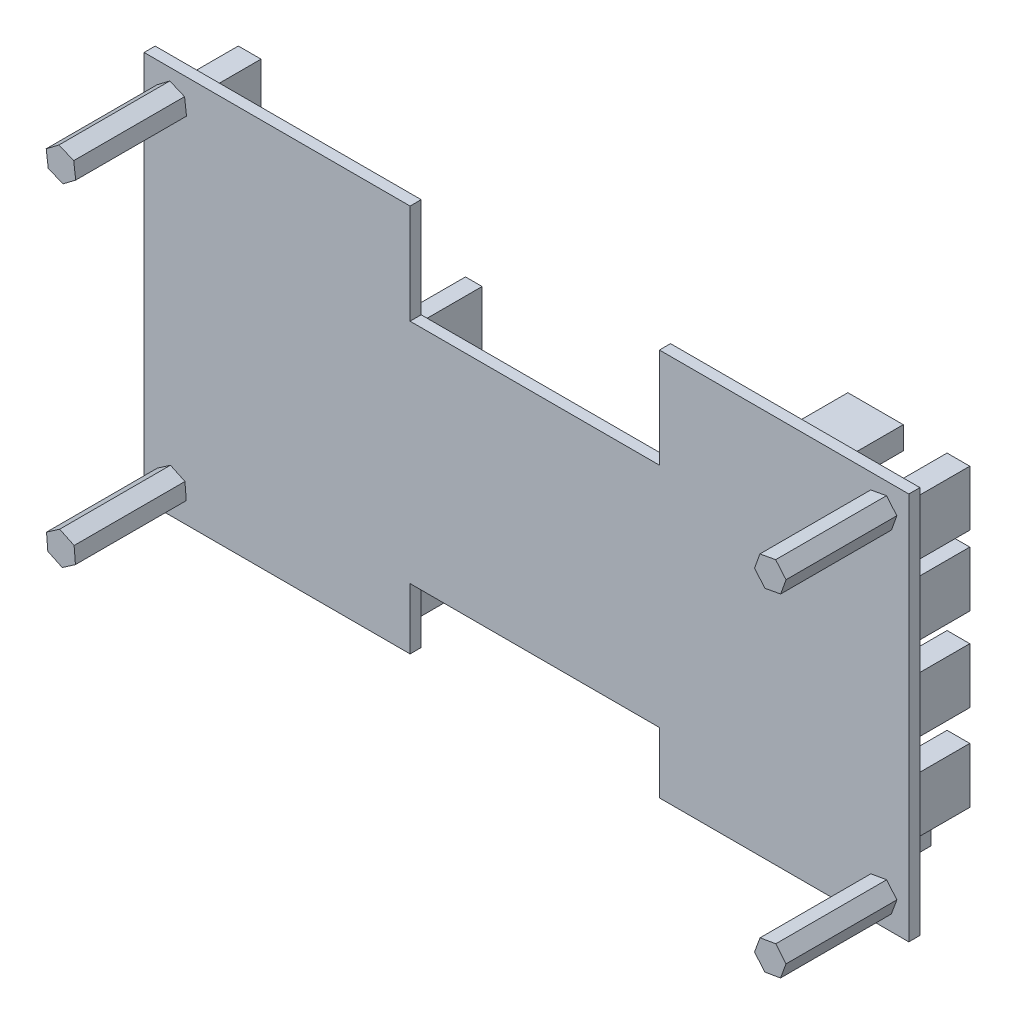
ISO-10303-21;
HEADER;
FILE_DESCRIPTION(('STEP AP214'),'2;1');
FILE_NAME('part.step','',(''),(''),'','','');
FILE_SCHEMA(('AUTOMOTIVE_DESIGN { 1 0 10303 214 1 1 1 1 }'));
ENDSEC;
DATA;
#1=APPLICATION_CONTEXT('core data for automotive mechanical design processes');
#2=APPLICATION_PROTOCOL_DEFINITION('international standard','automotive_design',2000,#1);
#3=PRODUCT_CONTEXT('',#1,'mechanical');
#4=PRODUCT('Part','Part','',(#3));
#5=PRODUCT_RELATED_PRODUCT_CATEGORY('part','',(#4));
#6=PRODUCT_DEFINITION_FORMATION('','',#4);
#7=PRODUCT_DEFINITION_CONTEXT('part definition',#1,'design');
#8=PRODUCT_DEFINITION('design','',#6,#7);
#9=PRODUCT_DEFINITION_SHAPE('','',#8);
#10=(LENGTH_UNIT() NAMED_UNIT(*) SI_UNIT(.MILLI.,.METRE.));
#11=(NAMED_UNIT(*) PLANE_ANGLE_UNIT() SI_UNIT($,.RADIAN.));
#12=(NAMED_UNIT(*) SI_UNIT($,.STERADIAN.) SOLID_ANGLE_UNIT());
#13=UNCERTAINTY_MEASURE_WITH_UNIT(LENGTH_MEASURE(1.E-05),#10,'distance_accuracy_value','');
#14=(GEOMETRIC_REPRESENTATION_CONTEXT(3) GLOBAL_UNCERTAINTY_ASSIGNED_CONTEXT((#13)) GLOBAL_UNIT_ASSIGNED_CONTEXT((#10,
#11,#12)) REPRESENTATION_CONTEXT('',''));
#15=CARTESIAN_POINT('',(0.,0.,0.));
#16=DIRECTION('',(0.,0.,1.));
#17=DIRECTION('',(1.,0.,0.));
#18=AXIS2_PLACEMENT_3D('',#15,#16,#17);
#19=CARTESIAN_POINT('',(0.,-70.,2.));
#20=DIRECTION('',(0.,0.,1.));
#21=DIRECTION('',(1.,0.,0.));
#22=AXIS2_PLACEMENT_3D('',#19,#20,#21);
#23=PLANE('',#22);
#24=DIRECTION('',(0.345206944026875,0.938526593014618,0.));
#25=VECTOR('',#24,1.);
#26=CARTESIAN_POINT('',(134.848053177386,-67.2176638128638,2.));
#27=LINE('',#26,#25);
#28=CARTESIAN_POINT('',(134.848053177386,-67.2176638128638,2.));
#29=VERTEX_POINT('',#28);
#30=CARTESIAN_POINT('',(135.844579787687,-64.5083709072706,2.));
#31=VERTEX_POINT('',#30);
#32=EDGE_CURVE('E702',#29,#31,#27,.T.);
#33=ORIENTED_EDGE('',*,*,#32,.F.);
#34=DIRECTION('',(0.985391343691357,0.170305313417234,0.));
#35=VECTOR('',#34,1.);
#36=CARTESIAN_POINT('',(132.0034733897,-67.7092929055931,2.));
#37=LINE('',#36,#35);
#38=CARTESIAN_POINT('',(132.0034733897,-67.7092929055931,2.));
#39=VERTEX_POINT('',#38);
#40=EDGE_CURVE('E699',#39,#29,#37,.T.);
#41=ORIENTED_EDGE('',*,*,#40,.F.);
#42=DIRECTION('',(0.640184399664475,-0.76822127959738,0.));
#43=VECTOR('',#42,1.);
#44=CARTESIAN_POINT('',(130.155420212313,-65.4916290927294,2.));
#45=LINE('',#44,#43);
#46=CARTESIAN_POINT('',(130.155420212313,-65.4916290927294,2.));
#47=VERTEX_POINT('',#46);
#48=EDGE_CURVE('E712',#47,#39,#45,.T.);
#49=ORIENTED_EDGE('',*,*,#48,.F.);
#50=DIRECTION('',(-0.345206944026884,-0.938526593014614,0.));
#51=VECTOR('',#50,1.);
#52=CARTESIAN_POINT('',(131.151946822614,-62.7823361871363,2.));
#53=LINE('',#52,#51);
#54=CARTESIAN_POINT('',(131.151946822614,-62.7823361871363,2.));
#55=VERTEX_POINT('',#54);
#56=EDGE_CURVE('E728',#55,#47,#53,.T.);
#57=ORIENTED_EDGE('',*,*,#56,.F.);
#58=DIRECTION('',(-0.985391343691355,-0.170305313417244,0.));
#59=VECTOR('',#58,1.);
#60=CARTESIAN_POINT('',(133.9965266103,-62.2907070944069,2.));
#61=LINE('',#60,#59);
#62=CARTESIAN_POINT('',(133.9965266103,-62.2907070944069,2.));
#63=VERTEX_POINT('',#62);
#64=EDGE_CURVE('E726',#63,#55,#61,.T.);
#65=ORIENTED_EDGE('',*,*,#64,.F.);
#66=DIRECTION('',(-0.640184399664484,0.768221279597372,0.));
#67=VECTOR('',#66,1.);
#68=CARTESIAN_POINT('',(135.844579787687,-64.5083709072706,2.));
#69=LINE('',#68,#67);
#70=EDGE_CURVE('E724',#31,#63,#69,.T.);
#71=ORIENTED_EDGE('',*,*,#70,.F.);
#72=EDGE_LOOP('',(#33,#41,#49,#57,#65,#71));
#73=FACE_BOUND('',#72,.T.);
#74=DIRECTION('',(-0.124750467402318,0.992188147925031,0.));
#75=VECTOR('',#74,1.);
#76=CARTESIAN_POINT('',(7.66053215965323,-6.12022406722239,2.));
#77=LINE('',#76,#75);
#78=CARTESIAN_POINT('',(7.66053215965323,-6.12022406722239,2.));
#79=VERTEX_POINT('',#78);
#80=CARTESIAN_POINT('',(7.30040857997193,-3.25602359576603,2.));
#81=VERTEX_POINT('',#80);
#82=EDGE_CURVE('E806',#79,#81,#77,.T.);
#83=ORIENTED_EDGE('',*,*,#82,.F.);
#84=DIRECTION('',(0.79688490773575,0.604131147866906,0.));
#85=VECTOR('',#84,1.);
#86=CARTESIAN_POINT('',(5.3601235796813,-7.86420047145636,2.));
#87=LINE('',#86,#85);
#88=CARTESIAN_POINT('',(5.3601235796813,-7.86420047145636,2.));
#89=VERTEX_POINT('',#88);
#90=EDGE_CURVE('E788',#89,#79,#87,.T.);
#91=ORIENTED_EDGE('',*,*,#90,.F.);
#92=DIRECTION('',(0.921635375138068,-0.388057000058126,0.));
#93=VECTOR('',#92,1.);
#94=CARTESIAN_POINT('',(2.69959142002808,-6.74397640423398,2.));
#95=LINE('',#94,#93);
#96=CARTESIAN_POINT('',(2.69959142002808,-6.74397640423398,2.));
#97=VERTEX_POINT('',#96);
#98=EDGE_CURVE('E793',#97,#89,#95,.T.);
#99=ORIENTED_EDGE('',*,*,#98,.F.);
#100=DIRECTION('',(0.124750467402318,-0.992188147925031,0.));
#101=VECTOR('',#100,1.);
#102=CARTESIAN_POINT('',(2.33946784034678,-3.87977593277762,2.));
#103=LINE('',#102,#101);
#104=CARTESIAN_POINT('',(2.33946784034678,-3.87977593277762,2.));
#105=VERTEX_POINT('',#104);
#106=EDGE_CURVE('E812',#105,#97,#103,.T.);
#107=ORIENTED_EDGE('',*,*,#106,.F.);
#108=DIRECTION('',(-0.79688490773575,-0.604131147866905,0.));
#109=VECTOR('',#108,1.);
#110=CARTESIAN_POINT('',(4.6398764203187,-2.13579952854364,2.));
#111=LINE('',#110,#109);
#112=CARTESIAN_POINT('',(4.6398764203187,-2.13579952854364,2.));
#113=VERTEX_POINT('',#112);
#114=EDGE_CURVE('E810',#113,#105,#111,.T.);
#115=ORIENTED_EDGE('',*,*,#114,.F.);
#116=DIRECTION('',(-0.921635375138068,0.388057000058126,0.));
#117=VECTOR('',#116,1.);
#118=CARTESIAN_POINT('',(7.30040857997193,-3.25602359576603,2.));
#119=LINE('',#118,#117);
#120=EDGE_CURVE('E808',#81,#113,#119,.T.);
#121=ORIENTED_EDGE('',*,*,#120,.F.);
#122=EDGE_LOOP('',(#83,#91,#99,#107,#115,#121));
#123=FACE_BOUND('',#122,.T.);
#124=DIRECTION('',(0.,1.,0.));
#125=VECTOR('',#124,1.);
#126=CARTESIAN_POINT('',(48.,-70.,2.));
#127=LINE('',#126,#125);
#128=CARTESIAN_POINT('',(48.,-70.,2.));
#129=VERTEX_POINT('',#128);
#130=CARTESIAN_POINT('',(48.,-59.,2.));
#131=VERTEX_POINT('',#130);
#132=EDGE_CURVE('E1393',#129,#131,#127,.T.);
#133=ORIENTED_EDGE('',*,*,#132,.T.);
#134=DIRECTION('',(1.,0.,0.));
#135=VECTOR('',#134,1.);
#136=CARTESIAN_POINT('',(48.,-59.,2.));
#137=LINE('',#136,#135);
#138=CARTESIAN_POINT('',(93.,-59.,2.));
#139=VERTEX_POINT('',#138);
#140=EDGE_CURVE('E1396',#131,#139,#137,.T.);
#141=ORIENTED_EDGE('',*,*,#140,.T.);
#142=DIRECTION('',(0.,-1.,0.));
#143=VECTOR('',#142,1.);
#144=CARTESIAN_POINT('',(93.,-70.,2.));
#145=LINE('',#144,#143);
#146=CARTESIAN_POINT('',(93.,-70.,2.));
#147=VERTEX_POINT('',#146);
#148=EDGE_CURVE('E1400',#139,#147,#145,.T.);
#149=ORIENTED_EDGE('',*,*,#148,.T.);
#150=DIRECTION('',(1.,0.,0.));
#151=VECTOR('',#150,1.);
#152=CARTESIAN_POINT('',(0.,-70.,2.));
#153=LINE('',#152,#151);
#154=CARTESIAN_POINT('',(138.,-70.,2.));
#155=VERTEX_POINT('',#154);
#156=EDGE_CURVE('E1448',#147,#155,#153,.T.);
#157=ORIENTED_EDGE('',*,*,#156,.T.);
#158=DIRECTION('',(0.,1.,0.));
#159=VECTOR('',#158,1.);
#160=CARTESIAN_POINT('',(138.,0.,2.));
#161=LINE('',#160,#159);
#162=CARTESIAN_POINT('',(138.,0.,2.));
#163=VERTEX_POINT('',#162);
#164=EDGE_CURVE('E1453',#155,#163,#161,.T.);
#165=ORIENTED_EDGE('',*,*,#164,.T.);
#166=DIRECTION('',(-1.,0.,0.));
#167=VECTOR('',#166,1.);
#168=CARTESIAN_POINT('',(0.,0.,2.));
#169=LINE('',#168,#167);
#170=CARTESIAN_POINT('',(93.,0.,2.));
#171=VERTEX_POINT('',#170);
#172=EDGE_CURVE('E1456',#163,#171,#169,.T.);
#173=ORIENTED_EDGE('',*,*,#172,.T.);
#174=DIRECTION('',(0.,-1.,0.));
#175=VECTOR('',#174,1.);
#176=CARTESIAN_POINT('',(93.,0.,2.));
#177=LINE('',#176,#175);
#178=CARTESIAN_POINT('',(93.,-18.,2.));
#179=VERTEX_POINT('',#178);
#180=EDGE_CURVE('E1422',#171,#179,#177,.T.);
#181=ORIENTED_EDGE('',*,*,#180,.T.);
#182=DIRECTION('',(-1.,0.,0.));
#183=VECTOR('',#182,1.);
#184=CARTESIAN_POINT('',(48.,-18.,2.));
#185=LINE('',#184,#183);
#186=CARTESIAN_POINT('',(48.,-18.,2.));
#187=VERTEX_POINT('',#186);
#188=EDGE_CURVE('E1426',#179,#187,#185,.T.);
#189=ORIENTED_EDGE('',*,*,#188,.T.);
#190=DIRECTION('',(0.,1.,0.));
#191=VECTOR('',#190,1.);
#192=CARTESIAN_POINT('',(48.,0.,2.));
#193=LINE('',#192,#191);
#194=CARTESIAN_POINT('',(48.,0.,2.));
#195=VERTEX_POINT('',#194);
#196=EDGE_CURVE('E1419',#187,#195,#193,.T.);
#197=ORIENTED_EDGE('',*,*,#196,.T.);
#198=CARTESIAN_POINT('',(0.,0.,2.));
#199=VERTEX_POINT('',#198);
#200=EDGE_CURVE('E1455',#195,#199,#169,.T.);
#201=ORIENTED_EDGE('',*,*,#200,.T.);
#202=DIRECTION('',(0.,-1.,0.));
#203=VECTOR('',#202,1.);
#204=CARTESIAN_POINT('',(0.,0.,2.));
#205=LINE('',#204,#203);
#206=CARTESIAN_POINT('',(0.,-70.,2.));
#207=VERTEX_POINT('',#206);
#208=EDGE_CURVE('E1445',#199,#207,#205,.T.);
#209=ORIENTED_EDGE('',*,*,#208,.T.);
#210=EDGE_CURVE('E1450',#207,#129,#153,.T.);
#211=ORIENTED_EDGE('',*,*,#210,.T.);
#212=EDGE_LOOP('',(#133,#141,#149,#157,#165,#173,#181,#189,#197,#201,#209,#211));
#213=FACE_BOUND('',#212,.T.);
#214=DIRECTION('',(0.335579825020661,0.942011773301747,0.));
#215=VECTOR('',#214,1.);
#216=CARTESIAN_POINT('',(134.870661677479,-7.19862643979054,2.));
#217=LINE('',#216,#215);
#218=CARTESIAN_POINT('',(134.870661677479,-7.19862643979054,2.));
#219=VERTEX_POINT('',#218);
#220=CARTESIAN_POINT('',(135.83939718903,-4.47927268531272,2.));
#221=VERTEX_POINT('',#220);
#222=EDGE_CURVE('E763',#219,#221,#217,.T.);
#223=ORIENTED_EDGE('',*,*,#222,.F.);
#224=DIRECTION('',(0.98359603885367,0.180385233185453,0.));
#225=VECTOR('',#224,1.);
#226=CARTESIAN_POINT('',(132.031264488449,-7.71935375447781,2.));
#227=LINE('',#226,#225);
#228=CARTESIAN_POINT('',(132.031264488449,-7.71935375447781,2.));
#229=VERTEX_POINT('',#228);
#230=EDGE_CURVE('E745',#229,#219,#227,.T.);
#231=ORIENTED_EDGE('',*,*,#230,.F.);
#232=DIRECTION('',(0.648016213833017,-0.761626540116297,0.));
#233=VECTOR('',#232,1.);
#234=CARTESIAN_POINT('',(130.16060281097,-5.52072731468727,2.));
#235=LINE('',#234,#233);
#236=CARTESIAN_POINT('',(130.16060281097,-5.52072731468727,2.));
#237=VERTEX_POINT('',#236);
#238=EDGE_CURVE('E750',#237,#229,#235,.T.);
#239=ORIENTED_EDGE('',*,*,#238,.F.);
#240=DIRECTION('',(-0.335579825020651,-0.942011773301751,0.));
#241=VECTOR('',#240,1.);
#242=CARTESIAN_POINT('',(131.129338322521,-2.80137356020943,2.));
#243=LINE('',#242,#241);
#244=CARTESIAN_POINT('',(131.129338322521,-2.80137356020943,2.));
#245=VERTEX_POINT('',#244);
#246=EDGE_CURVE('E769',#245,#237,#243,.T.);
#247=ORIENTED_EDGE('',*,*,#246,.F.);
#248=DIRECTION('',(-0.98359603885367,-0.180385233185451,0.));
#249=VECTOR('',#248,1.);
#250=CARTESIAN_POINT('',(133.968735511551,-2.28064624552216,2.));
#251=LINE('',#250,#249);
#252=CARTESIAN_POINT('',(133.968735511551,-2.28064624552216,2.));
#253=VERTEX_POINT('',#252);
#254=EDGE_CURVE('E767',#253,#245,#251,.T.);
#255=ORIENTED_EDGE('',*,*,#254,.F.);
#256=DIRECTION('',(-0.648016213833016,0.761626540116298,0.));
#257=VECTOR('',#256,1.);
#258=CARTESIAN_POINT('',(135.83939718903,-4.47927268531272,2.));
#259=LINE('',#258,#257);
#260=EDGE_CURVE('E765',#221,#253,#259,.T.);
#261=ORIENTED_EDGE('',*,*,#260,.F.);
#262=EDGE_LOOP('',(#223,#231,#239,#247,#255,#261));
#263=FACE_BOUND('',#262,.T.);
#264=DIRECTION('',(-0.0811352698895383,0.996703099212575,0.));
#265=VECTOR('',#264,1.);
#266=CARTESIAN_POINT('',(7.60886642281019,-66.2357788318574,2.));
#267=LINE('',#266,#265);
#268=CARTESIAN_POINT('',(7.60886642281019,-66.2357788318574,2.));
#269=VERTEX_POINT('',#268);
#270=CARTESIAN_POINT('',(7.37464907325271,-63.3585448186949,2.));
#271=VERTEX_POINT('',#270);
#272=EDGE_CURVE('E2772',#269,#271,#267,.T.);
#273=ORIENTED_EDGE('',*,*,#272,.F.);
#274=DIRECTION('',(0.822602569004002,0.568616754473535,0.));
#275=VECTOR('',#274,1.);
#276=CARTESIAN_POINT('',(5.2342173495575,-67.8772340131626,2.));
#277=LINE('',#276,#275);
#278=CARTESIAN_POINT('',(5.2342173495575,-67.8772340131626,2.));
#279=VERTEX_POINT('',#278);
#280=EDGE_CURVE('E697',#279,#269,#277,.T.);
#281=ORIENTED_EDGE('',*,*,#280,.F.);
#282=DIRECTION('',(0.903737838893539,-0.428086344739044,0.));
#283=VECTOR('',#282,1.);
#284=CARTESIAN_POINT('',(2.62535092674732,-66.6414551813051,2.));
#285=LINE('',#284,#283);
#286=CARTESIAN_POINT('',(2.62535092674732,-66.6414551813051,2.));
#287=VERTEX_POINT('',#286);
#288=EDGE_CURVE('E693',#287,#279,#285,.T.);
#289=ORIENTED_EDGE('',*,*,#288,.F.);
#290=DIRECTION('',(0.0811352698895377,-0.996703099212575,0.));
#291=VECTOR('',#290,1.);
#292=CARTESIAN_POINT('',(2.39113357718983,-63.7642211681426,2.));
#293=LINE('',#292,#291);
#294=CARTESIAN_POINT('',(2.39113357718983,-63.7642211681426,2.));
#295=VERTEX_POINT('',#294);
#296=EDGE_CURVE('E2768',#295,#287,#293,.T.);
#297=ORIENTED_EDGE('',*,*,#296,.F.);
#298=DIRECTION('',(-0.822602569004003,-0.568616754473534,0.));
#299=VECTOR('',#298,1.);
#300=CARTESIAN_POINT('',(4.7657826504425,-62.1227659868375,2.));
#301=LINE('',#300,#299);
#302=CARTESIAN_POINT('',(4.7657826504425,-62.1227659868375,2.));
#303=VERTEX_POINT('',#302);
#304=EDGE_CURVE('E2780',#303,#295,#301,.T.);
#305=ORIENTED_EDGE('',*,*,#304,.F.);
#306=DIRECTION('',(-0.90373783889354,0.428086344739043,0.));
#307=VECTOR('',#306,1.);
#308=CARTESIAN_POINT('',(7.37464907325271,-63.3585448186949,2.));
#309=LINE('',#308,#307);
#310=EDGE_CURVE('E2774',#271,#303,#309,.T.);
#311=ORIENTED_EDGE('',*,*,#310,.F.);
#312=EDGE_LOOP('',(#273,#281,#289,#297,#305,#311));
#313=FACE_BOUND('',#312,.T.);
#314=ADVANCED_FACE('F32',(#73,#123,#213,#263,#313),#23,.T.);
#315=CARTESIAN_POINT('',(0.,-70.,0.));
#316=DIRECTION('',(0.,0.,1.));
#317=DIRECTION('',(1.,0.,0.));
#318=AXIS2_PLACEMENT_3D('',#315,#316,#317);
#319=PLANE('',#318);
#320=DIRECTION('',(0.,-1.,0.));
#321=VECTOR('',#320,1.);
#322=CARTESIAN_POINT('',(97.,-20.0741477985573,0.));
#323=LINE('',#322,#321);
#324=CARTESIAN_POINT('',(97.,-20.0741477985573,0.));
#325=VERTEX_POINT('',#324);
#326=CARTESIAN_POINT('',(97.,-58.8544245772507,0.));
#327=VERTEX_POINT('',#326);
#328=EDGE_CURVE('E864',#325,#327,#323,.T.);
#329=ORIENTED_EDGE('',*,*,#328,.F.);
#330=DIRECTION('',(1.,0.,0.));
#331=VECTOR('',#330,1.);
#332=CARTESIAN_POINT('',(97.,-20.0741477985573,0.));
#333=LINE('',#332,#331);
#334=CARTESIAN_POINT('',(94.,-20.0741477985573,0.));
#335=VERTEX_POINT('',#334);
#336=EDGE_CURVE('E869',#335,#325,#333,.T.);
#337=ORIENTED_EDGE('',*,*,#336,.F.);
#338=DIRECTION('',(0.,1.,0.));
#339=VECTOR('',#338,1.);
#340=CARTESIAN_POINT('',(94.,-20.0741477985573,0.));
#341=LINE('',#340,#339);
#342=CARTESIAN_POINT('',(94.,-58.8544245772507,0.));
#343=VERTEX_POINT('',#342);
#344=EDGE_CURVE('E881',#343,#335,#341,.T.);
#345=ORIENTED_EDGE('',*,*,#344,.F.);
#346=DIRECTION('',(-1.,0.,0.));
#347=VECTOR('',#346,1.);
#348=CARTESIAN_POINT('',(97.,-58.8544245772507,0.));
#349=LINE('',#348,#347);
#350=EDGE_CURVE('E878',#327,#343,#349,.T.);
#351=ORIENTED_EDGE('',*,*,#350,.F.);
#352=EDGE_LOOP('',(#329,#337,#345,#351));
#353=FACE_BOUND('',#352,.T.);
#354=DIRECTION('',(0.,-1.,0.));
#355=VECTOR('',#354,1.);
#356=CARTESIAN_POINT('',(7.10185370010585,-35.,0.));
#357=LINE('',#356,#355);
#358=CARTESIAN_POINT('',(7.10185370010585,-35.,0.));
#359=VERTEX_POINT('',#358);
#360=CARTESIAN_POINT('',(7.10185370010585,-45.,0.));
#361=VERTEX_POINT('',#360);
#362=EDGE_CURVE('E930',#359,#361,#357,.T.);
#363=ORIENTED_EDGE('',*,*,#362,.F.);
#364=DIRECTION('',(1.,0.,0.));
#365=VECTOR('',#364,1.);
#366=CARTESIAN_POINT('',(7.10185370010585,-35.,0.));
#367=LINE('',#366,#365);
#368=CARTESIAN_POINT('',(3.,-35.,0.));
#369=VERTEX_POINT('',#368);
#370=EDGE_CURVE('E935',#369,#359,#367,.T.);
#371=ORIENTED_EDGE('',*,*,#370,.F.);
#372=DIRECTION('',(0.,1.,0.));
#373=VECTOR('',#372,1.);
#374=CARTESIAN_POINT('',(3.,-35.,0.));
#375=LINE('',#374,#373);
#376=CARTESIAN_POINT('',(2.99999999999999,-45.,0.));
#377=VERTEX_POINT('',#376);
#378=EDGE_CURVE('E947',#377,#369,#375,.T.);
#379=ORIENTED_EDGE('',*,*,#378,.F.);
#380=DIRECTION('',(-1.,0.,0.));
#381=VECTOR('',#380,1.);
#382=CARTESIAN_POINT('',(7.10185370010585,-45.,0.));
#383=LINE('',#382,#381);
#384=EDGE_CURVE('E944',#361,#377,#383,.T.);
#385=ORIENTED_EDGE('',*,*,#384,.F.);
#386=EDGE_LOOP('',(#363,#371,#379,#385));
#387=FACE_BOUND('',#386,.T.);
#388=DIRECTION('',(0.,-1.,0.));
#389=VECTOR('',#388,1.);
#390=CARTESIAN_POINT('',(33.1018537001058,-62.8981462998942,0.));
#391=LINE('',#390,#389);
#392=CARTESIAN_POINT('',(33.1018537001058,-62.8981462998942,0.));
#393=VERTEX_POINT('',#392);
#394=CARTESIAN_POINT('',(33.1018537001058,-67.,0.));
#395=VERTEX_POINT('',#394);
#396=EDGE_CURVE('E996',#393,#395,#391,.T.);
#397=ORIENTED_EDGE('',*,*,#396,.F.);
#398=DIRECTION('',(1.,0.,0.));
#399=VECTOR('',#398,1.);
#400=CARTESIAN_POINT('',(33.1018537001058,-62.8981462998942,0.));
#401=LINE('',#400,#399);
#402=CARTESIAN_POINT('',(23.1018537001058,-62.8981462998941,0.));
#403=VERTEX_POINT('',#402);
#404=EDGE_CURVE('E1001',#403,#393,#401,.T.);
#405=ORIENTED_EDGE('',*,*,#404,.F.);
#406=DIRECTION('',(0.,1.,0.));
#407=VECTOR('',#406,1.);
#408=CARTESIAN_POINT('',(23.1018537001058,-62.8981462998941,0.));
#409=LINE('',#408,#407);
#410=CARTESIAN_POINT('',(23.1018537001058,-67.,0.));
#411=VERTEX_POINT('',#410);
#412=EDGE_CURVE('E1013',#411,#403,#409,.T.);
#413=ORIENTED_EDGE('',*,*,#412,.F.);
#414=DIRECTION('',(-1.,0.,0.));
#415=VECTOR('',#414,1.);
#416=CARTESIAN_POINT('',(33.1018537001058,-67.,0.));
#417=LINE('',#416,#415);
#418=EDGE_CURVE('E1010',#395,#411,#417,.T.);
#419=ORIENTED_EDGE('',*,*,#418,.F.);
#420=EDGE_LOOP('',(#397,#405,#413,#419));
#421=FACE_BOUND('',#420,.T.);
#422=DIRECTION('',(0.,-1.,0.));
#423=VECTOR('',#422,1.);
#424=CARTESIAN_POINT('',(113.,-62.8981462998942,0.));
#425=LINE('',#424,#423);
#426=CARTESIAN_POINT('',(113.,-62.8981462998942,0.));
#427=VERTEX_POINT('',#426);
#428=CARTESIAN_POINT('',(113.,-67.,0.));
#429=VERTEX_POINT('',#428);
#430=EDGE_CURVE('E1062',#427,#429,#425,.T.);
#431=ORIENTED_EDGE('',*,*,#430,.F.);
#432=DIRECTION('',(1.,0.,0.));
#433=VECTOR('',#432,1.);
#434=CARTESIAN_POINT('',(113.,-62.8981462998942,0.));
#435=LINE('',#434,#433);
#436=CARTESIAN_POINT('',(103.,-62.8981462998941,0.));
#437=VERTEX_POINT('',#436);
#438=EDGE_CURVE('E1067',#437,#427,#435,.T.);
#439=ORIENTED_EDGE('',*,*,#438,.F.);
#440=DIRECTION('',(0.,1.,0.));
#441=VECTOR('',#440,1.);
#442=CARTESIAN_POINT('',(103.,-62.8981462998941,0.));
#443=LINE('',#442,#441);
#444=CARTESIAN_POINT('',(103.,-67.,0.));
#445=VERTEX_POINT('',#444);
#446=EDGE_CURVE('E1079',#445,#437,#443,.T.);
#447=ORIENTED_EDGE('',*,*,#446,.F.);
#448=DIRECTION('',(-1.,0.,0.));
#449=VECTOR('',#448,1.);
#450=CARTESIAN_POINT('',(113.,-67.,0.));
#451=LINE('',#450,#449);
#452=EDGE_CURVE('E1076',#429,#445,#451,.T.);
#453=ORIENTED_EDGE('',*,*,#452,.F.);
#454=EDGE_LOOP('',(#431,#439,#447,#453));
#455=FACE_BOUND('',#454,.T.);
#456=DIRECTION('',(0.,1.,0.));
#457=VECTOR('',#456,1.);
#458=CARTESIAN_POINT('',(2.99999999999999,-57.,0.));
#459=LINE('',#458,#457);
#460=CARTESIAN_POINT('',(2.99999999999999,-67.,0.));
#461=VERTEX_POINT('',#460);
#462=CARTESIAN_POINT('',(2.99999999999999,-57.,0.));
#463=VERTEX_POINT('',#462);
#464=EDGE_CURVE('E1128',#461,#463,#459,.T.);
#465=ORIENTED_EDGE('',*,*,#464,.F.);
#466=DIRECTION('',(-1.,0.,0.));
#467=VECTOR('',#466,1.);
#468=CARTESIAN_POINT('',(2.99999999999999,-67.,0.));
#469=LINE('',#468,#467);
#470=CARTESIAN_POINT('',(7.10185370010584,-67.,0.));
#471=VERTEX_POINT('',#470);
#472=EDGE_CURVE('E1133',#471,#461,#469,.T.);
#473=ORIENTED_EDGE('',*,*,#472,.F.);
#474=DIRECTION('',(0.,-1.,0.));
#475=VECTOR('',#474,1.);
#476=CARTESIAN_POINT('',(7.10185370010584,-57.,0.));
#477=LINE('',#476,#475);
#478=CARTESIAN_POINT('',(7.10185370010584,-57.,0.));
#479=VERTEX_POINT('',#478);
#480=EDGE_CURVE('E1145',#479,#471,#477,.T.);
#481=ORIENTED_EDGE('',*,*,#480,.F.);
#482=DIRECTION('',(1.,0.,0.));
#483=VECTOR('',#482,1.);
#484=CARTESIAN_POINT('',(2.99999999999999,-57.,0.));
#485=LINE('',#484,#483);
#486=EDGE_CURVE('E1142',#463,#479,#485,.T.);
#487=ORIENTED_EDGE('',*,*,#486,.F.);
#488=EDGE_LOOP('',(#465,#473,#481,#487));
#489=FACE_BOUND('',#488,.T.);
#490=DIRECTION('',(0.,1.,0.));
#491=VECTOR('',#490,1.);
#492=CARTESIAN_POINT('',(3.,-4.49073149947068,0.));
#493=LINE('',#492,#491);
#494=CARTESIAN_POINT('',(3.,-14.4907314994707,0.));
#495=VERTEX_POINT('',#494);
#496=CARTESIAN_POINT('',(3.,-4.49073149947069,0.));
#497=VERTEX_POINT('',#496);
#498=EDGE_CURVE('E1194',#495,#497,#493,.T.);
#499=ORIENTED_EDGE('',*,*,#498,.F.);
#500=DIRECTION('',(-1.,0.,0.));
#501=VECTOR('',#500,1.);
#502=CARTESIAN_POINT('',(3.,-14.4907314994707,0.));
#503=LINE('',#502,#501);
#504=CARTESIAN_POINT('',(7.10185370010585,-14.4907314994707,0.));
#505=VERTEX_POINT('',#504);
#506=EDGE_CURVE('E1199',#505,#495,#503,.T.);
#507=ORIENTED_EDGE('',*,*,#506,.F.);
#508=DIRECTION('',(0.,-1.,0.));
#509=VECTOR('',#508,1.);
#510=CARTESIAN_POINT('',(7.10185370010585,-4.49073149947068,0.));
#511=LINE('',#510,#509);
#512=CARTESIAN_POINT('',(7.10185370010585,-4.49073149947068,0.));
#513=VERTEX_POINT('',#512);
#514=EDGE_CURVE('E1211',#513,#505,#511,.T.);
#515=ORIENTED_EDGE('',*,*,#514,.F.);
#516=DIRECTION('',(1.,0.,0.));
#517=VECTOR('',#516,1.);
#518=CARTESIAN_POINT('',(3.,-4.49073149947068,0.));
#519=LINE('',#518,#517);
#520=EDGE_CURVE('E1208',#497,#513,#519,.T.);
#521=ORIENTED_EDGE('',*,*,#520,.F.);
#522=EDGE_LOOP('',(#499,#507,#515,#521));
#523=FACE_BOUND('',#522,.T.);
#524=DIRECTION('',(0.,-1.,0.));
#525=VECTOR('',#524,1.);
#526=CARTESIAN_POINT('',(135.,-31.8911142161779,0.));
#527=LINE('',#526,#525);
#528=CARTESIAN_POINT('',(135.,-31.8911142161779,0.));
#529=VERTEX_POINT('',#528);
#530=CARTESIAN_POINT('',(135.,-41.8911142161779,0.));
#531=VERTEX_POINT('',#530);
#532=EDGE_CURVE('E1260',#529,#531,#527,.T.);
#533=ORIENTED_EDGE('',*,*,#532,.F.);
#534=DIRECTION('',(1.,0.,0.));
#535=VECTOR('',#534,1.);
#536=CARTESIAN_POINT('',(135.,-31.8911142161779,0.));
#537=LINE('',#536,#535);
#538=CARTESIAN_POINT('',(130.898146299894,-31.8911142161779,0.));
#539=VERTEX_POINT('',#538);
#540=EDGE_CURVE('E1265',#539,#529,#537,.T.);
#541=ORIENTED_EDGE('',*,*,#540,.F.);
#542=DIRECTION('',(0.,1.,0.));
#543=VECTOR('',#542,1.);
#544=CARTESIAN_POINT('',(130.898146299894,-31.8911142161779,0.));
#545=LINE('',#544,#543);
#546=CARTESIAN_POINT('',(130.898146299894,-41.8911142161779,0.));
#547=VERTEX_POINT('',#546);
#548=EDGE_CURVE('E1277',#547,#539,#545,.T.);
#549=ORIENTED_EDGE('',*,*,#548,.F.);
#550=DIRECTION('',(-1.,0.,0.));
#551=VECTOR('',#550,1.);
#552=CARTESIAN_POINT('',(135.,-41.8911142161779,0.));
#553=LINE('',#552,#551);
#554=EDGE_CURVE('E1274',#531,#547,#553,.T.);
#555=ORIENTED_EDGE('',*,*,#554,.F.);
#556=EDGE_LOOP('',(#533,#541,#549,#555));
#557=FACE_BOUND('',#556,.T.);
#558=DIRECTION('',(0.,-1.,0.));
#559=VECTOR('',#558,1.);
#560=CARTESIAN_POINT('',(135.,-4.15406017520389,0.));
#561=LINE('',#560,#559);
#562=CARTESIAN_POINT('',(135.,-4.15406017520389,0.));
#563=VERTEX_POINT('',#562);
#564=CARTESIAN_POINT('',(135.,-14.1540601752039,0.));
#565=VERTEX_POINT('',#564);
#566=EDGE_CURVE('E1326',#563,#565,#561,.T.);
#567=ORIENTED_EDGE('',*,*,#566,.F.);
#568=DIRECTION('',(1.,0.,0.));
#569=VECTOR('',#568,1.);
#570=CARTESIAN_POINT('',(135.,-4.15406017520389,0.));
#571=LINE('',#570,#569);
#572=CARTESIAN_POINT('',(130.898146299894,-4.15406017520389,0.));
#573=VERTEX_POINT('',#572);
#574=EDGE_CURVE('E1331',#573,#563,#571,.T.);
#575=ORIENTED_EDGE('',*,*,#574,.F.);
#576=DIRECTION('',(0.,1.,0.));
#577=VECTOR('',#576,1.);
#578=CARTESIAN_POINT('',(130.898146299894,-4.15406017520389,0.));
#579=LINE('',#578,#577);
#580=CARTESIAN_POINT('',(130.898146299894,-14.1540601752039,0.));
#581=VERTEX_POINT('',#580);
#582=EDGE_CURVE('E1343',#581,#573,#579,.T.);
#583=ORIENTED_EDGE('',*,*,#582,.F.);
#584=DIRECTION('',(-1.,0.,0.));
#585=VECTOR('',#584,1.);
#586=CARTESIAN_POINT('',(135.,-14.1540601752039,0.));
#587=LINE('',#586,#585);
#588=EDGE_CURVE('E1340',#565,#581,#587,.T.);
#589=ORIENTED_EDGE('',*,*,#588,.F.);
#590=EDGE_LOOP('',(#567,#575,#583,#589));
#591=FACE_BOUND('',#590,.T.);
#592=DIRECTION('',(1.,0.,0.));
#593=VECTOR('',#592,1.);
#594=CARTESIAN_POINT('',(48.,-59.,0.));
#595=LINE('',#594,#593);
#596=CARTESIAN_POINT('',(48.,-59.,0.));
#597=VERTEX_POINT('',#596);
#598=CARTESIAN_POINT('',(93.,-59.,0.));
#599=VERTEX_POINT('',#598);
#600=EDGE_CURVE('E1405',#597,#599,#595,.T.);
#601=ORIENTED_EDGE('',*,*,#600,.F.);
#602=DIRECTION('',(0.,1.,0.));
#603=VECTOR('',#602,1.);
#604=CARTESIAN_POINT('',(48.,-70.,0.));
#605=LINE('',#604,#603);
#606=CARTESIAN_POINT('',(48.,-70.,0.));
#607=VERTEX_POINT('',#606);
#608=EDGE_CURVE('E1392',#607,#597,#605,.T.);
#609=ORIENTED_EDGE('',*,*,#608,.F.);
#610=DIRECTION('',(1.,0.,0.));
#611=VECTOR('',#610,1.);
#612=CARTESIAN_POINT('',(0.,-70.,0.));
#613=LINE('',#612,#611);
#614=CARTESIAN_POINT('',(0.,-70.,0.));
#615=VERTEX_POINT('',#614);
#616=EDGE_CURVE('E1463',#615,#607,#613,.T.);
#617=ORIENTED_EDGE('',*,*,#616,.F.);
#618=DIRECTION('',(0.,-1.,0.));
#619=VECTOR('',#618,1.);
#620=CARTESIAN_POINT('',(0.,0.,0.));
#621=LINE('',#620,#619);
#622=CARTESIAN_POINT('',(0.,0.,0.));
#623=VERTEX_POINT('',#622);
#624=EDGE_CURVE('E1438',#623,#615,#621,.T.);
#625=ORIENTED_EDGE('',*,*,#624,.F.);
#626=DIRECTION('',(-1.,0.,0.));
#627=VECTOR('',#626,1.);
#628=CARTESIAN_POINT('',(0.,0.,0.));
#629=LINE('',#628,#627);
#630=CARTESIAN_POINT('',(48.,0.,0.));
#631=VERTEX_POINT('',#630);
#632=EDGE_CURVE('E1468',#631,#623,#629,.T.);
#633=ORIENTED_EDGE('',*,*,#632,.F.);
#634=DIRECTION('',(0.,1.,0.));
#635=VECTOR('',#634,1.);
#636=CARTESIAN_POINT('',(48.,0.,0.));
#637=LINE('',#636,#635);
#638=CARTESIAN_POINT('',(48.,-18.,0.));
#639=VERTEX_POINT('',#638);
#640=EDGE_CURVE('E1411',#639,#631,#637,.T.);
#641=ORIENTED_EDGE('',*,*,#640,.F.);
#642=DIRECTION('',(-1.,0.,0.));
#643=VECTOR('',#642,1.);
#644=CARTESIAN_POINT('',(48.,-18.,0.));
#645=LINE('',#644,#643);
#646=CARTESIAN_POINT('',(93.,-18.,0.));
#647=VERTEX_POINT('',#646);
#648=EDGE_CURVE('E1423',#647,#639,#645,.T.);
#649=ORIENTED_EDGE('',*,*,#648,.F.);
#650=DIRECTION('',(0.,-1.,0.));
#651=VECTOR('',#650,1.);
#652=CARTESIAN_POINT('',(93.,0.,0.));
#653=LINE('',#652,#651);
#654=CARTESIAN_POINT('',(93.,0.,0.));
#655=VERTEX_POINT('',#654);
#656=EDGE_CURVE('E1431',#655,#647,#653,.T.);
#657=ORIENTED_EDGE('',*,*,#656,.F.);
#658=CARTESIAN_POINT('',(138.,0.,0.));
#659=VERTEX_POINT('',#658);
#660=EDGE_CURVE('E1449',#659,#655,#629,.T.);
#661=ORIENTED_EDGE('',*,*,#660,.F.);
#662=DIRECTION('',(0.,1.,0.));
#663=VECTOR('',#662,1.);
#664=CARTESIAN_POINT('',(138.,0.,0.));
#665=LINE('',#664,#663);
#666=CARTESIAN_POINT('',(138.,-70.,0.));
#667=VERTEX_POINT('',#666);
#668=EDGE_CURVE('E1466',#667,#659,#665,.T.);
#669=ORIENTED_EDGE('',*,*,#668,.F.);
#670=CARTESIAN_POINT('',(93.,-70.,0.));
#671=VERTEX_POINT('',#670);
#672=EDGE_CURVE('E1462',#671,#667,#613,.T.);
#673=ORIENTED_EDGE('',*,*,#672,.F.);
#674=DIRECTION('',(0.,-1.,0.));
#675=VECTOR('',#674,1.);
#676=CARTESIAN_POINT('',(93.,-70.,0.));
#677=LINE('',#676,#675);
#678=EDGE_CURVE('E1397',#599,#671,#677,.T.);
#679=ORIENTED_EDGE('',*,*,#678,.F.);
#680=EDGE_LOOP('',(#601,#609,#617,#625,#633,#641,#649,#657,#661,#669,#673,#679));
#681=FACE_BOUND('',#680,.T.);
#682=DIRECTION('',(0.,-1.,0.));
#683=VECTOR('',#682,1.);
#684=CARTESIAN_POINT('',(22.,-32.,0.));
#685=LINE('',#684,#683);
#686=CARTESIAN_POINT('',(22.,-32.,0.));
#687=VERTEX_POINT('',#686);
#688=CARTESIAN_POINT('',(22.,-60.,0.));
#689=VERTEX_POINT('',#688);
#690=EDGE_CURVE('E1359',#687,#689,#685,.T.);
#691=ORIENTED_EDGE('',*,*,#690,.F.);
#692=DIRECTION('',(1.,0.,0.));
#693=VECTOR('',#692,1.);
#694=CARTESIAN_POINT('',(22.,-32.,0.));
#695=LINE('',#694,#693);
#696=CARTESIAN_POINT('',(10.,-32.,0.));
#697=VERTEX_POINT('',#696);
#698=EDGE_CURVE('E1364',#697,#687,#695,.T.);
#699=ORIENTED_EDGE('',*,*,#698,.F.);
#700=DIRECTION('',(0.,1.,0.));
#701=VECTOR('',#700,1.);
#702=CARTESIAN_POINT('',(10.,-32.,0.));
#703=LINE('',#702,#701);
#704=CARTESIAN_POINT('',(10.,-60.,0.));
#705=VERTEX_POINT('',#704);
#706=EDGE_CURVE('E1376',#705,#697,#703,.T.);
#707=ORIENTED_EDGE('',*,*,#706,.F.);
#708=DIRECTION('',(-1.,0.,0.));
#709=VECTOR('',#708,1.);
#710=CARTESIAN_POINT('',(22.,-60.,0.));
#711=LINE('',#710,#709);
#712=EDGE_CURVE('E1373',#689,#705,#711,.T.);
#713=ORIENTED_EDGE('',*,*,#712,.F.);
#714=EDGE_LOOP('',(#691,#699,#707,#713));
#715=FACE_BOUND('',#714,.T.);
#716=DIRECTION('',(0.,1.,0.));
#717=VECTOR('',#716,1.);
#718=CARTESIAN_POINT('',(130.898146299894,-26.7962925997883,0.));
#719=LINE('',#718,#717);
#720=CARTESIAN_POINT('',(130.898146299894,-26.7962925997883,0.));
#721=VERTEX_POINT('',#720);
#722=CARTESIAN_POINT('',(130.898146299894,-16.7962925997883,0.));
#723=VERTEX_POINT('',#722);
#724=EDGE_CURVE('E1293',#721,#723,#719,.T.);
#725=ORIENTED_EDGE('',*,*,#724,.F.);
#726=DIRECTION('',(-1.,0.,0.));
#727=VECTOR('',#726,1.);
#728=CARTESIAN_POINT('',(130.898146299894,-26.7962925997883,0.));
#729=LINE('',#728,#727);
#730=CARTESIAN_POINT('',(135.,-26.7962925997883,0.));
#731=VERTEX_POINT('',#730);
#732=EDGE_CURVE('E1298',#731,#721,#729,.T.);
#733=ORIENTED_EDGE('',*,*,#732,.F.);
#734=DIRECTION('',(0.,-1.,0.));
#735=VECTOR('',#734,1.);
#736=CARTESIAN_POINT('',(135.,-26.7962925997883,0.));
#737=LINE('',#736,#735);
#738=CARTESIAN_POINT('',(135.,-16.7962925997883,0.));
#739=VERTEX_POINT('',#738);
#740=EDGE_CURVE('E1310',#739,#731,#737,.T.);
#741=ORIENTED_EDGE('',*,*,#740,.F.);
#742=DIRECTION('',(1.,0.,0.));
#743=VECTOR('',#742,1.);
#744=CARTESIAN_POINT('',(130.898146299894,-16.7962925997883,0.));
#745=LINE('',#744,#743);
#746=EDGE_CURVE('E1307',#723,#739,#745,.T.);
#747=ORIENTED_EDGE('',*,*,#746,.F.);
#748=EDGE_LOOP('',(#725,#733,#741,#747));
#749=FACE_BOUND('',#748,.T.);
#750=DIRECTION('',(0.,-1.,0.));
#751=VECTOR('',#750,1.);
#752=CARTESIAN_POINT('',(135.,-47.4781582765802,0.));
#753=LINE('',#752,#751);
#754=CARTESIAN_POINT('',(135.,-47.4781582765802,0.));
#755=VERTEX_POINT('',#754);
#756=CARTESIAN_POINT('',(135.,-57.4781582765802,0.));
#757=VERTEX_POINT('',#756);
#758=EDGE_CURVE('E1227',#755,#757,#753,.T.);
#759=ORIENTED_EDGE('',*,*,#758,.F.);
#760=DIRECTION('',(1.,0.,0.));
#761=VECTOR('',#760,1.);
#762=CARTESIAN_POINT('',(135.,-47.4781582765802,0.));
#763=LINE('',#762,#761);
#764=CARTESIAN_POINT('',(130.898146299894,-47.4781582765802,0.));
#765=VERTEX_POINT('',#764);
#766=EDGE_CURVE('E1232',#765,#755,#763,.T.);
#767=ORIENTED_EDGE('',*,*,#766,.F.);
#768=DIRECTION('',(0.,1.,0.));
#769=VECTOR('',#768,1.);
#770=CARTESIAN_POINT('',(130.898146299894,-47.4781582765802,0.));
#771=LINE('',#770,#769);
#772=CARTESIAN_POINT('',(130.898146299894,-57.4781582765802,0.));
#773=VERTEX_POINT('',#772);
#774=EDGE_CURVE('E1244',#773,#765,#771,.T.);
#775=ORIENTED_EDGE('',*,*,#774,.F.);
#776=DIRECTION('',(-1.,0.,0.));
#777=VECTOR('',#776,1.);
#778=CARTESIAN_POINT('',(135.,-57.4781582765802,0.));
#779=LINE('',#778,#777);
#780=EDGE_CURVE('E1241',#757,#773,#779,.T.);
#781=ORIENTED_EDGE('',*,*,#780,.F.);
#782=EDGE_LOOP('',(#759,#767,#775,#781));
#783=FACE_BOUND('',#782,.T.);
#784=DIRECTION('',(0.,-1.,0.));
#785=VECTOR('',#784,1.);
#786=CARTESIAN_POINT('',(7.10185370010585,-17.288515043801,0.));
#787=LINE('',#786,#785);
#788=CARTESIAN_POINT('',(7.10185370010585,-17.288515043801,0.));
#789=VERTEX_POINT('',#788);
#790=CARTESIAN_POINT('',(7.10185370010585,-27.288515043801,0.));
#791=VERTEX_POINT('',#790);
#792=EDGE_CURVE('E1161',#789,#791,#787,.T.);
#793=ORIENTED_EDGE('',*,*,#792,.F.);
#794=DIRECTION('',(1.,0.,0.));
#795=VECTOR('',#794,1.);
#796=CARTESIAN_POINT('',(7.10185370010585,-17.288515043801,0.));
#797=LINE('',#796,#795);
#798=CARTESIAN_POINT('',(3.,-17.288515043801,0.));
#799=VERTEX_POINT('',#798);
#800=EDGE_CURVE('E1166',#799,#789,#797,.T.);
#801=ORIENTED_EDGE('',*,*,#800,.F.);
#802=DIRECTION('',(0.,1.,0.));
#803=VECTOR('',#802,1.);
#804=CARTESIAN_POINT('',(3.,-17.288515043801,0.));
#805=LINE('',#804,#803);
#806=CARTESIAN_POINT('',(3.,-27.288515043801,0.));
#807=VERTEX_POINT('',#806);
#808=EDGE_CURVE('E1178',#807,#799,#805,.T.);
#809=ORIENTED_EDGE('',*,*,#808,.F.);
#810=DIRECTION('',(-1.,0.,0.));
#811=VECTOR('',#810,1.);
#812=CARTESIAN_POINT('',(7.10185370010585,-27.288515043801,0.));
#813=LINE('',#812,#811);
#814=EDGE_CURVE('E1175',#791,#807,#813,.T.);
#815=ORIENTED_EDGE('',*,*,#814,.F.);
#816=EDGE_LOOP('',(#793,#801,#809,#815));
#817=FACE_BOUND('',#816,.T.);
#818=DIRECTION('',(0.,-1.,0.));
#819=VECTOR('',#818,1.);
#820=CARTESIAN_POINT('',(128.,-62.8981462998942,0.));
#821=LINE('',#820,#819);
#822=CARTESIAN_POINT('',(128.,-62.8981462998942,0.));
#823=VERTEX_POINT('',#822);
#824=CARTESIAN_POINT('',(128.,-67.,0.));
#825=VERTEX_POINT('',#824);
#826=EDGE_CURVE('E1095',#823,#825,#821,.T.);
#827=ORIENTED_EDGE('',*,*,#826,.F.);
#828=DIRECTION('',(1.,0.,0.));
#829=VECTOR('',#828,1.);
#830=CARTESIAN_POINT('',(128.,-62.8981462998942,0.));
#831=LINE('',#830,#829);
#832=CARTESIAN_POINT('',(118.,-62.8981462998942,0.));
#833=VERTEX_POINT('',#832);
#834=EDGE_CURVE('E1100',#833,#823,#831,.T.);
#835=ORIENTED_EDGE('',*,*,#834,.F.);
#836=DIRECTION('',(0.,1.,0.));
#837=VECTOR('',#836,1.);
#838=CARTESIAN_POINT('',(118.,-62.8981462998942,0.));
#839=LINE('',#838,#837);
#840=CARTESIAN_POINT('',(118.,-67.,0.));
#841=VERTEX_POINT('',#840);
#842=EDGE_CURVE('E1112',#841,#833,#839,.T.);
#843=ORIENTED_EDGE('',*,*,#842,.F.);
#844=DIRECTION('',(-1.,0.,0.));
#845=VECTOR('',#844,1.);
#846=CARTESIAN_POINT('',(128.,-67.,0.));
#847=LINE('',#846,#845);
#848=EDGE_CURVE('E1109',#825,#841,#847,.T.);
#849=ORIENTED_EDGE('',*,*,#848,.F.);
#850=EDGE_LOOP('',(#827,#835,#843,#849));
#851=FACE_BOUND('',#850,.T.);
#852=DIRECTION('',(0.,-1.,0.));
#853=VECTOR('',#852,1.);
#854=CARTESIAN_POINT('',(46.1018537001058,-62.8981462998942,0.));
#855=LINE('',#854,#853);
#856=CARTESIAN_POINT('',(46.1018537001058,-62.8981462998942,0.));
#857=VERTEX_POINT('',#856);
#858=CARTESIAN_POINT('',(46.1018537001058,-67.,0.));
#859=VERTEX_POINT('',#858);
#860=EDGE_CURVE('E1029',#857,#859,#855,.T.);
#861=ORIENTED_EDGE('',*,*,#860,.F.);
#862=DIRECTION('',(1.,0.,0.));
#863=VECTOR('',#862,1.);
#864=CARTESIAN_POINT('',(46.1018537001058,-62.8981462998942,0.));
#865=LINE('',#864,#863);
#866=CARTESIAN_POINT('',(36.1018537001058,-62.8981462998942,0.));
#867=VERTEX_POINT('',#866);
#868=EDGE_CURVE('E1034',#867,#857,#865,.T.);
#869=ORIENTED_EDGE('',*,*,#868,.F.);
#870=DIRECTION('',(0.,1.,0.));
#871=VECTOR('',#870,1.);
#872=CARTESIAN_POINT('',(36.1018537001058,-62.8981462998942,0.));
#873=LINE('',#872,#871);
#874=CARTESIAN_POINT('',(36.1018537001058,-67.,0.));
#875=VERTEX_POINT('',#874);
#876=EDGE_CURVE('E1046',#875,#867,#873,.T.);
#877=ORIENTED_EDGE('',*,*,#876,.F.);
#878=DIRECTION('',(-1.,0.,0.));
#879=VECTOR('',#878,1.);
#880=CARTESIAN_POINT('',(46.1018537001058,-67.,0.));
#881=LINE('',#880,#879);
#882=EDGE_CURVE('E1043',#859,#875,#881,.T.);
#883=ORIENTED_EDGE('',*,*,#882,.F.);
#884=EDGE_LOOP('',(#861,#869,#877,#883));
#885=FACE_BOUND('',#884,.T.);
#886=DIRECTION('',(0.,-1.,0.));
#887=VECTOR('',#886,1.);
#888=CARTESIAN_POINT('',(20.1018537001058,-62.8981462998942,0.));
#889=LINE('',#888,#887);
#890=CARTESIAN_POINT('',(20.1018537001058,-62.8981462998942,0.));
#891=VERTEX_POINT('',#890);
#892=CARTESIAN_POINT('',(20.1018537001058,-67.,0.));
#893=VERTEX_POINT('',#892);
#894=EDGE_CURVE('E963',#891,#893,#889,.T.);
#895=ORIENTED_EDGE('',*,*,#894,.F.);
#896=DIRECTION('',(1.,0.,0.));
#897=VECTOR('',#896,1.);
#898=CARTESIAN_POINT('',(20.1018537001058,-62.8981462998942,0.));
#899=LINE('',#898,#897);
#900=CARTESIAN_POINT('',(10.1018537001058,-62.8981462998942,0.));
#901=VERTEX_POINT('',#900);
#902=EDGE_CURVE('E968',#901,#891,#899,.T.);
#903=ORIENTED_EDGE('',*,*,#902,.F.);
#904=DIRECTION('',(0.,1.,0.));
#905=VECTOR('',#904,1.);
#906=CARTESIAN_POINT('',(10.1018537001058,-62.8981462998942,0.));
#907=LINE('',#906,#905);
#908=CARTESIAN_POINT('',(10.1018537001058,-67.,0.));
#909=VERTEX_POINT('',#908);
#910=EDGE_CURVE('E980',#909,#901,#907,.T.);
#911=ORIENTED_EDGE('',*,*,#910,.F.);
#912=DIRECTION('',(-1.,0.,0.));
#913=VECTOR('',#912,1.);
#914=CARTESIAN_POINT('',(20.1018537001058,-67.,0.));
#915=LINE('',#914,#913);
#916=EDGE_CURVE('E977',#893,#909,#915,.T.);
#917=ORIENTED_EDGE('',*,*,#916,.F.);
#918=EDGE_LOOP('',(#895,#903,#911,#917));
#919=FACE_BOUND('',#918,.T.);
#920=DIRECTION('',(0.,-1.,0.));
#921=VECTOR('',#920,1.);
#922=CARTESIAN_POINT('',(123.,-3.66851150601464,0.));
#923=LINE('',#922,#921);
#924=CARTESIAN_POINT('',(123.,-3.66851150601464,0.));
#925=VERTEX_POINT('',#924);
#926=CARTESIAN_POINT('',(123.,-7.77036520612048,0.));
#927=VERTEX_POINT('',#926);
#928=EDGE_CURVE('E897',#925,#927,#923,.T.);
#929=ORIENTED_EDGE('',*,*,#928,.F.);
#930=DIRECTION('',(1.,0.,0.));
#931=VECTOR('',#930,1.);
#932=CARTESIAN_POINT('',(123.,-3.66851150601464,0.));
#933=LINE('',#932,#931);
#934=CARTESIAN_POINT('',(113.,-3.66851150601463,0.));
#935=VERTEX_POINT('',#934);
#936=EDGE_CURVE('E902',#935,#925,#933,.T.);
#937=ORIENTED_EDGE('',*,*,#936,.F.);
#938=DIRECTION('',(0.,1.,0.));
#939=VECTOR('',#938,1.);
#940=CARTESIAN_POINT('',(113.,-3.66851150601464,0.));
#941=LINE('',#940,#939);
#942=CARTESIAN_POINT('',(113.,-7.77036520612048,0.));
#943=VERTEX_POINT('',#942);
#944=EDGE_CURVE('E914',#943,#935,#941,.T.);
#945=ORIENTED_EDGE('',*,*,#944,.F.);
#946=DIRECTION('',(-1.,0.,0.));
#947=VECTOR('',#946,1.);
#948=CARTESIAN_POINT('',(123.,-7.77036520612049,0.));
#949=LINE('',#948,#947);
#950=EDGE_CURVE('E911',#927,#943,#949,.T.);
#951=ORIENTED_EDGE('',*,*,#950,.F.);
#952=EDGE_LOOP('',(#929,#937,#945,#951));
#953=FACE_BOUND('',#952,.T.);
#954=DIRECTION('',(0.,-1.,0.));
#955=VECTOR('',#954,1.);
#956=CARTESIAN_POINT('',(47.,-20.0741477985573,0.));
#957=LINE('',#956,#955);
#958=CARTESIAN_POINT('',(47.,-20.0741477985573,0.));
#959=VERTEX_POINT('',#958);
#960=CARTESIAN_POINT('',(47.,-58.8544245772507,0.));
#961=VERTEX_POINT('',#960);
#962=EDGE_CURVE('E831',#959,#961,#957,.T.);
#963=ORIENTED_EDGE('',*,*,#962,.F.);
#964=DIRECTION('',(1.,0.,0.));
#965=VECTOR('',#964,1.);
#966=CARTESIAN_POINT('',(47.,-20.0741477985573,0.));
#967=LINE('',#966,#965);
#968=CARTESIAN_POINT('',(44.,-20.0741477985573,0.));
#969=VERTEX_POINT('',#968);
#970=EDGE_CURVE('E836',#969,#959,#967,.T.);
#971=ORIENTED_EDGE('',*,*,#970,.F.);
#972=DIRECTION('',(0.,1.,0.));
#973=VECTOR('',#972,1.);
#974=CARTESIAN_POINT('',(44.,-20.0741477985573,0.));
#975=LINE('',#974,#973);
#976=CARTESIAN_POINT('',(44.,-58.8544245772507,0.));
#977=VERTEX_POINT('',#976);
#978=EDGE_CURVE('E848',#977,#969,#975,.T.);
#979=ORIENTED_EDGE('',*,*,#978,.F.);
#980=DIRECTION('',(-1.,0.,0.));
#981=VECTOR('',#980,1.);
#982=CARTESIAN_POINT('',(47.,-58.8544245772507,0.));
#983=LINE('',#982,#981);
#984=EDGE_CURVE('E845',#961,#977,#983,.T.);
#985=ORIENTED_EDGE('',*,*,#984,.F.);
#986=EDGE_LOOP('',(#963,#971,#979,#985));
#987=FACE_BOUND('',#986,.T.);
#988=ADVANCED_FACE('F1488',(#353,#387,#421,#455,#489,#523,#557,#591,#681,#715,#749,#783,#817,
#851,#885,#919,#953,#987),#319,.F.);
#989=CARTESIAN_POINT('',(0.,-70.,2.));
#990=DIRECTION('',(0.,1.,0.));
#991=DIRECTION('',(0.,0.,1.));
#992=AXIS2_PLACEMENT_3D('',#989,#990,#991);
#993=PLANE('',#992);
#994=ORIENTED_EDGE('',*,*,#616,.T.);
#995=DIRECTION('',(0.,0.,-1.));
#996=VECTOR('',#995,1.);
#997=CARTESIAN_POINT('',(48.,-70.,2.));
#998=LINE('',#997,#996);
#999=EDGE_CURVE('E1409',#129,#607,#998,.T.);
#1000=ORIENTED_EDGE('',*,*,#999,.F.);
#1001=ORIENTED_EDGE('',*,*,#210,.F.);
#1002=DIRECTION('',(0.,0.,-1.));
#1003=VECTOR('',#1002,1.);
#1004=CARTESIAN_POINT('',(0.,-70.,2.));
#1005=LINE('',#1004,#1003);
#1006=EDGE_CURVE('E11',#207,#615,#1005,.T.);
#1007=ORIENTED_EDGE('',*,*,#1006,.T.);
#1008=EDGE_LOOP('',(#994,#1000,#1001,#1007));
#1009=FACE_BOUND('',#1008,.T.);
#1010=ADVANCED_FACE('F1511',(#1009),#993,.F.);
#1011=CARTESIAN_POINT('',(0.,0.,2.));
#1012=DIRECTION('',(0.,-1.,0.));
#1013=DIRECTION('',(0.,0.,-1.));
#1014=AXIS2_PLACEMENT_3D('',#1011,#1012,#1013);
#1015=PLANE('',#1014);
#1016=ORIENTED_EDGE('',*,*,#200,.F.);
#1017=DIRECTION('',(0.,0.,-1.));
#1018=VECTOR('',#1017,1.);
#1019=CARTESIAN_POINT('',(48.,0.,2.));
#1020=LINE('',#1019,#1018);
#1021=EDGE_CURVE('E1429',#195,#631,#1020,.T.);
#1022=ORIENTED_EDGE('',*,*,#1021,.T.);
#1023=ORIENTED_EDGE('',*,*,#632,.T.);
#1024=DIRECTION('',(0.,0.,-1.));
#1025=VECTOR('',#1024,1.);
#1026=CARTESIAN_POINT('',(0.,0.,2.));
#1027=LINE('',#1026,#1025);
#1028=EDGE_CURVE('E1459',#199,#623,#1027,.T.);
#1029=ORIENTED_EDGE('',*,*,#1028,.F.);
#1030=EDGE_LOOP('',(#1016,#1022,#1023,#1029));
#1031=FACE_BOUND('',#1030,.T.);
#1032=ADVANCED_FACE('F1521',(#1031),#1015,.F.);
#1033=CARTESIAN_POINT('',(0.,0.,2.));
#1034=DIRECTION('',(1.,0.,0.));
#1035=DIRECTION('',(0.,1.,0.));
#1036=AXIS2_PLACEMENT_3D('',#1033,#1034,#1035);
#1037=PLANE('',#1036);
#1038=ORIENTED_EDGE('',*,*,#624,.T.);
#1039=ORIENTED_EDGE('',*,*,#1006,.F.);
#1040=ORIENTED_EDGE('',*,*,#208,.F.);
#1041=ORIENTED_EDGE('',*,*,#1028,.T.);
#1042=EDGE_LOOP('',(#1038,#1039,#1040,#1041));
#1043=FACE_BOUND('',#1042,.T.);
#1044=ADVANCED_FACE('F34',(#1043),#1037,.F.);
#1045=ORIENTED_EDGE('',*,*,#156,.F.);
#1046=DIRECTION('',(0.,0.,-1.));
#1047=VECTOR('',#1046,1.);
#1048=CARTESIAN_POINT('',(93.,-70.,2.));
#1049=LINE('',#1048,#1047);
#1050=EDGE_CURVE('E1412',#147,#671,#1049,.T.);
#1051=ORIENTED_EDGE('',*,*,#1050,.T.);
#1052=ORIENTED_EDGE('',*,*,#672,.T.);
#1053=DIRECTION('',(0.,0.,-1.));
#1054=VECTOR('',#1053,1.);
#1055=CARTESIAN_POINT('',(138.,-70.,2.));
#1056=LINE('',#1055,#1054);
#1057=EDGE_CURVE('E40',#155,#667,#1056,.T.);
#1058=ORIENTED_EDGE('',*,*,#1057,.F.);
#1059=EDGE_LOOP('',(#1045,#1051,#1052,#1058));
#1060=FACE_BOUND('',#1059,.T.);
#1061=ADVANCED_FACE('F1500',(#1060),#993,.F.);
#1062=CARTESIAN_POINT('',(138.,0.,2.));
#1063=DIRECTION('',(-1.,0.,0.));
#1064=DIRECTION('',(0.,0.,1.));
#1065=AXIS2_PLACEMENT_3D('',#1062,#1063,#1064);
#1066=PLANE('',#1065);
#1067=ORIENTED_EDGE('',*,*,#668,.T.);
#1068=DIRECTION('',(0.,0.,-1.));
#1069=VECTOR('',#1068,1.);
#1070=CARTESIAN_POINT('',(138.,0.,2.));
#1071=LINE('',#1070,#1069);
#1072=EDGE_CURVE('E1473',#163,#659,#1071,.T.);
#1073=ORIENTED_EDGE('',*,*,#1072,.F.);
#1074=ORIENTED_EDGE('',*,*,#164,.F.);
#1075=ORIENTED_EDGE('',*,*,#1057,.T.);
#1076=EDGE_LOOP('',(#1067,#1073,#1074,#1075));
#1077=FACE_BOUND('',#1076,.T.);
#1078=ADVANCED_FACE('F1480',(#1077),#1066,.F.);
#1079=ORIENTED_EDGE('',*,*,#660,.T.);
#1080=DIRECTION('',(0.,0.,-1.));
#1081=VECTOR('',#1080,1.);
#1082=CARTESIAN_POINT('',(93.,0.,2.));
#1083=LINE('',#1082,#1081);
#1084=EDGE_CURVE('E1441',#171,#655,#1083,.T.);
#1085=ORIENTED_EDGE('',*,*,#1084,.F.);
#1086=ORIENTED_EDGE('',*,*,#172,.F.);
#1087=ORIENTED_EDGE('',*,*,#1072,.T.);
#1088=EDGE_LOOP('',(#1079,#1085,#1086,#1087));
#1089=FACE_BOUND('',#1088,.T.);
#1090=ADVANCED_FACE('F1495',(#1089),#1015,.F.);
#1091=CARTESIAN_POINT('',(48.,0.,2.));
#1092=DIRECTION('',(-1.,0.,0.));
#1093=DIRECTION('',(0.,-1.,0.));
#1094=AXIS2_PLACEMENT_3D('',#1091,#1092,#1093);
#1095=PLANE('',#1094);
#1096=ORIENTED_EDGE('',*,*,#640,.T.);
#1097=ORIENTED_EDGE('',*,*,#1021,.F.);
#1098=ORIENTED_EDGE('',*,*,#196,.F.);
#1099=DIRECTION('',(0.,0.,-1.));
#1100=VECTOR('',#1099,1.);
#1101=CARTESIAN_POINT('',(48.,-18.,2.));
#1102=LINE('',#1101,#1100);
#1103=EDGE_CURVE('E1436',#187,#639,#1102,.T.);
#1104=ORIENTED_EDGE('',*,*,#1103,.T.);
#1105=EDGE_LOOP('',(#1096,#1097,#1098,#1104));
#1106=FACE_BOUND('',#1105,.T.);
#1107=ADVANCED_FACE('F1524',(#1106),#1095,.F.);
#1108=CARTESIAN_POINT('',(48.,-18.,2.));
#1109=DIRECTION('',(0.,-1.,0.));
#1110=DIRECTION('',(0.,0.,-1.));
#1111=AXIS2_PLACEMENT_3D('',#1108,#1109,#1110);
#1112=PLANE('',#1111);
#1113=ORIENTED_EDGE('',*,*,#648,.T.);
#1114=ORIENTED_EDGE('',*,*,#1103,.F.);
#1115=ORIENTED_EDGE('',*,*,#188,.F.);
#1116=DIRECTION('',(0.,0.,-1.));
#1117=VECTOR('',#1116,1.);
#1118=CARTESIAN_POINT('',(93.,-18.,2.));
#1119=LINE('',#1118,#1117);
#1120=EDGE_CURVE('E1439',#179,#647,#1119,.T.);
#1121=ORIENTED_EDGE('',*,*,#1120,.T.);
#1122=EDGE_LOOP('',(#1113,#1114,#1115,#1121));
#1123=FACE_BOUND('',#1122,.T.);
#1124=ADVANCED_FACE('F1527',(#1123),#1112,.F.);
#1125=CARTESIAN_POINT('',(93.,0.,2.));
#1126=DIRECTION('',(1.,0.,0.));
#1127=DIRECTION('',(0.,1.,0.));
#1128=AXIS2_PLACEMENT_3D('',#1125,#1126,#1127);
#1129=PLANE('',#1128);
#1130=ORIENTED_EDGE('',*,*,#656,.T.);
#1131=ORIENTED_EDGE('',*,*,#1120,.F.);
#1132=ORIENTED_EDGE('',*,*,#180,.F.);
#1133=ORIENTED_EDGE('',*,*,#1084,.T.);
#1134=EDGE_LOOP('',(#1130,#1131,#1132,#1133));
#1135=FACE_BOUND('',#1134,.T.);
#1136=ADVANCED_FACE('F1529',(#1135),#1129,.F.);
#1137=CARTESIAN_POINT('',(48.,-70.,2.));
#1138=DIRECTION('',(-1.,0.,0.));
#1139=DIRECTION('',(0.,0.,1.));
#1140=AXIS2_PLACEMENT_3D('',#1137,#1138,#1139);
#1141=PLANE('',#1140);
#1142=ORIENTED_EDGE('',*,*,#608,.T.);
#1143=DIRECTION('',(0.,0.,-1.));
#1144=VECTOR('',#1143,1.);
#1145=CARTESIAN_POINT('',(48.,-59.,2.));
#1146=LINE('',#1145,#1144);
#1147=EDGE_CURVE('E1403',#131,#597,#1146,.T.);
#1148=ORIENTED_EDGE('',*,*,#1147,.F.);
#1149=ORIENTED_EDGE('',*,*,#132,.F.);
#1150=ORIENTED_EDGE('',*,*,#999,.T.);
#1151=EDGE_LOOP('',(#1142,#1148,#1149,#1150));
#1152=FACE_BOUND('',#1151,.T.);
#1153=ADVANCED_FACE('F1508',(#1152),#1141,.F.);
#1154=CARTESIAN_POINT('',(93.,-70.,2.));
#1155=DIRECTION('',(1.,0.,0.));
#1156=DIRECTION('',(0.,1.,0.));
#1157=AXIS2_PLACEMENT_3D('',#1154,#1155,#1156);
#1158=PLANE('',#1157);
#1159=ORIENTED_EDGE('',*,*,#678,.T.);
#1160=ORIENTED_EDGE('',*,*,#1050,.F.);
#1161=ORIENTED_EDGE('',*,*,#148,.F.);
#1162=DIRECTION('',(0.,0.,-1.));
#1163=VECTOR('',#1162,1.);
#1164=CARTESIAN_POINT('',(93.,-59.,2.));
#1165=LINE('',#1164,#1163);
#1166=EDGE_CURVE('E1415',#139,#599,#1165,.T.);
#1167=ORIENTED_EDGE('',*,*,#1166,.T.);
#1168=EDGE_LOOP('',(#1159,#1160,#1161,#1167));
#1169=FACE_BOUND('',#1168,.T.);
#1170=ADVANCED_FACE('F1502',(#1169),#1158,.F.);
#1171=CARTESIAN_POINT('',(48.,-59.,2.));
#1172=DIRECTION('',(0.,1.,0.));
#1173=DIRECTION('',(-1.,0.,0.));
#1174=AXIS2_PLACEMENT_3D('',#1171,#1172,#1173);
#1175=PLANE('',#1174);
#1176=ORIENTED_EDGE('',*,*,#600,.T.);
#1177=ORIENTED_EDGE('',*,*,#1166,.F.);
#1178=ORIENTED_EDGE('',*,*,#140,.F.);
#1179=ORIENTED_EDGE('',*,*,#1147,.T.);
#1180=EDGE_LOOP('',(#1176,#1177,#1178,#1179));
#1181=FACE_BOUND('',#1180,.T.);
#1182=ADVANCED_FACE('F1505',(#1181),#1175,.F.);
#1183=CARTESIAN_POINT('',(22.,-32.,-15.));
#1184=DIRECTION('',(-1.,0.,0.));
#1185=DIRECTION('',(0.,-1.,0.));
#1186=AXIS2_PLACEMENT_3D('',#1183,#1184,#1185);
#1187=PLANE('',#1186);
#1188=ORIENTED_EDGE('',*,*,#690,.T.);
#1189=DIRECTION('',(0.,0.,1.));
#1190=VECTOR('',#1189,1.);
#1191=CARTESIAN_POINT('',(22.,-60.,-15.));
#1192=LINE('',#1191,#1190);
#1193=CARTESIAN_POINT('',(22.,-60.,-15.));
#1194=VERTEX_POINT('',#1193);
#1195=EDGE_CURVE('E1389',#1194,#689,#1192,.T.);
#1196=ORIENTED_EDGE('',*,*,#1195,.F.);
#1197=DIRECTION('',(0.,-1.,0.));
#1198=VECTOR('',#1197,1.);
#1199=CARTESIAN_POINT('',(22.,-32.,-15.));
#1200=LINE('',#1199,#1198);
#1201=CARTESIAN_POINT('',(22.,-32.,-15.));
#1202=VERTEX_POINT('',#1201);
#1203=EDGE_CURVE('E1360',#1202,#1194,#1200,.T.);
#1204=ORIENTED_EDGE('',*,*,#1203,.F.);
#1205=DIRECTION('',(0.,0.,1.));
#1206=VECTOR('',#1205,1.);
#1207=CARTESIAN_POINT('',(22.,-32.,-15.));
#1208=LINE('',#1207,#1206);
#1209=EDGE_CURVE('E1370',#1202,#687,#1208,.T.);
#1210=ORIENTED_EDGE('',*,*,#1209,.T.);
#1211=EDGE_LOOP('',(#1188,#1196,#1204,#1210));
#1212=FACE_BOUND('',#1211,.T.);
#1213=ADVANCED_FACE('F1619',(#1212),#1187,.F.);
#1214=CARTESIAN_POINT('',(22.,-60.,-15.));
#1215=DIRECTION('',(0.,1.,0.));
#1216=DIRECTION('',(0.,0.,1.));
#1217=AXIS2_PLACEMENT_3D('',#1214,#1215,#1216);
#1218=PLANE('',#1217);
#1219=ORIENTED_EDGE('',*,*,#712,.T.);
#1220=DIRECTION('',(0.,0.,1.));
#1221=VECTOR('',#1220,1.);
#1222=CARTESIAN_POINT('',(10.,-60.,-15.));
#1223=LINE('',#1222,#1221);
#1224=CARTESIAN_POINT('',(10.,-60.,-15.));
#1225=VERTEX_POINT('',#1224);
#1226=EDGE_CURVE('E1386',#1225,#705,#1223,.T.);
#1227=ORIENTED_EDGE('',*,*,#1226,.F.);
#1228=DIRECTION('',(-1.,0.,0.));
#1229=VECTOR('',#1228,1.);
#1230=CARTESIAN_POINT('',(22.,-60.,-15.));
#1231=LINE('',#1230,#1229);
#1232=EDGE_CURVE('E1363',#1194,#1225,#1231,.T.);
#1233=ORIENTED_EDGE('',*,*,#1232,.F.);
#1234=ORIENTED_EDGE('',*,*,#1195,.T.);
#1235=EDGE_LOOP('',(#1219,#1227,#1233,#1234));
#1236=FACE_BOUND('',#1235,.T.);
#1237=ADVANCED_FACE('F1627',(#1236),#1218,.F.);
#1238=CARTESIAN_POINT('',(10.,-32.,-15.));
#1239=DIRECTION('',(1.,0.,0.));
#1240=DIRECTION('',(0.,1.,0.));
#1241=AXIS2_PLACEMENT_3D('',#1238,#1239,#1240);
#1242=PLANE('',#1241);
#1243=ORIENTED_EDGE('',*,*,#706,.T.);
#1244=DIRECTION('',(0.,0.,1.));
#1245=VECTOR('',#1244,1.);
#1246=CARTESIAN_POINT('',(10.,-32.,-15.));
#1247=LINE('',#1246,#1245);
#1248=CARTESIAN_POINT('',(10.,-32.,-15.));
#1249=VERTEX_POINT('',#1248);
#1250=EDGE_CURVE('E1383',#1249,#697,#1247,.T.);
#1251=ORIENTED_EDGE('',*,*,#1250,.F.);
#1252=DIRECTION('',(0.,1.,0.));
#1253=VECTOR('',#1252,1.);
#1254=CARTESIAN_POINT('',(10.,-32.,-15.));
#1255=LINE('',#1254,#1253);
#1256=EDGE_CURVE('E1366',#1225,#1249,#1255,.T.);
#1257=ORIENTED_EDGE('',*,*,#1256,.F.);
#1258=ORIENTED_EDGE('',*,*,#1226,.T.);
#1259=EDGE_LOOP('',(#1243,#1251,#1257,#1258));
#1260=FACE_BOUND('',#1259,.T.);
#1261=ADVANCED_FACE('F1637',(#1260),#1242,.F.);
#1262=CARTESIAN_POINT('',(22.,-32.,-15.));
#1263=DIRECTION('',(0.,-1.,0.));
#1264=DIRECTION('',(1.,0.,0.));
#1265=AXIS2_PLACEMENT_3D('',#1262,#1263,#1264);
#1266=PLANE('',#1265);
#1267=ORIENTED_EDGE('',*,*,#698,.T.);
#1268=ORIENTED_EDGE('',*,*,#1209,.F.);
#1269=DIRECTION('',(1.,0.,0.));
#1270=VECTOR('',#1269,1.);
#1271=CARTESIAN_POINT('',(22.,-32.,-15.));
#1272=LINE('',#1271,#1270);
#1273=EDGE_CURVE('E1368',#1249,#1202,#1272,.T.);
#1274=ORIENTED_EDGE('',*,*,#1273,.F.);
#1275=ORIENTED_EDGE('',*,*,#1250,.T.);
#1276=EDGE_LOOP('',(#1267,#1268,#1274,#1275));
#1277=FACE_BOUND('',#1276,.T.);
#1278=ADVANCED_FACE('F1647',(#1277),#1266,.F.);
#1279=CARTESIAN_POINT('',(22.,-60.,-15.));
#1280=DIRECTION('',(0.,0.,-1.));
#1281=DIRECTION('',(-1.,0.,0.));
#1282=AXIS2_PLACEMENT_3D('',#1279,#1280,#1281);
#1283=PLANE('',#1282);
#1284=ORIENTED_EDGE('',*,*,#1203,.T.);
#1285=ORIENTED_EDGE('',*,*,#1232,.T.);
#1286=ORIENTED_EDGE('',*,*,#1256,.T.);
#1287=ORIENTED_EDGE('',*,*,#1273,.T.);
#1288=EDGE_LOOP('',(#1284,#1285,#1286,#1287));
#1289=FACE_BOUND('',#1288,.T.);
#1290=ADVANCED_FACE('F1657',(#1289),#1283,.T.);
#1291=CARTESIAN_POINT('',(135.,-4.15406017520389,-12.));
#1292=DIRECTION('',(-1.,0.,0.));
#1293=DIRECTION('',(0.,0.,1.));
#1294=AXIS2_PLACEMENT_3D('',#1291,#1292,#1293);
#1295=PLANE('',#1294);
#1296=ORIENTED_EDGE('',*,*,#566,.T.);
#1297=DIRECTION('',(0.,0.,1.));
#1298=VECTOR('',#1297,1.);
#1299=CARTESIAN_POINT('',(135.,-14.1540601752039,-12.));
#1300=LINE('',#1299,#1298);
#1301=CARTESIAN_POINT('',(135.,-14.1540601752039,-12.));
#1302=VERTEX_POINT('',#1301);
#1303=EDGE_CURVE('E1356',#1302,#565,#1300,.T.);
#1304=ORIENTED_EDGE('',*,*,#1303,.F.);
#1305=DIRECTION('',(0.,-1.,0.));
#1306=VECTOR('',#1305,1.);
#1307=CARTESIAN_POINT('',(135.,-4.15406017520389,-12.));
#1308=LINE('',#1307,#1306);
#1309=CARTESIAN_POINT('',(135.,-4.15406017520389,-12.));
#1310=VERTEX_POINT('',#1309);
#1311=EDGE_CURVE('E1327',#1310,#1302,#1308,.T.);
#1312=ORIENTED_EDGE('',*,*,#1311,.F.);
#1313=DIRECTION('',(0.,0.,1.));
#1314=VECTOR('',#1313,1.);
#1315=CARTESIAN_POINT('',(135.,-4.15406017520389,-12.));
#1316=LINE('',#1315,#1314);
#1317=EDGE_CURVE('E1337',#1310,#563,#1316,.T.);
#1318=ORIENTED_EDGE('',*,*,#1317,.T.);
#1319=EDGE_LOOP('',(#1296,#1304,#1312,#1318));
#1320=FACE_BOUND('',#1319,.T.);
#1321=ADVANCED_FACE('F1667',(#1320),#1295,.F.);
#1322=CARTESIAN_POINT('',(135.,-14.1540601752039,-12.));
#1323=DIRECTION('',(0.,1.,0.));
#1324=DIRECTION('',(0.,0.,1.));
#1325=AXIS2_PLACEMENT_3D('',#1322,#1323,#1324);
#1326=PLANE('',#1325);
#1327=ORIENTED_EDGE('',*,*,#588,.T.);
#1328=DIRECTION('',(0.,0.,1.));
#1329=VECTOR('',#1328,1.);
#1330=CARTESIAN_POINT('',(130.898146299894,-14.1540601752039,-12.));
#1331=LINE('',#1330,#1329);
#1332=CARTESIAN_POINT('',(130.898146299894,-14.1540601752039,-12.));
#1333=VERTEX_POINT('',#1332);
#1334=EDGE_CURVE('E1353',#1333,#581,#1331,.T.);
#1335=ORIENTED_EDGE('',*,*,#1334,.F.);
#1336=DIRECTION('',(-1.,0.,0.));
#1337=VECTOR('',#1336,1.);
#1338=CARTESIAN_POINT('',(135.,-14.1540601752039,-12.));
#1339=LINE('',#1338,#1337);
#1340=EDGE_CURVE('E1330',#1302,#1333,#1339,.T.);
#1341=ORIENTED_EDGE('',*,*,#1340,.F.);
#1342=ORIENTED_EDGE('',*,*,#1303,.T.);
#1343=EDGE_LOOP('',(#1327,#1335,#1341,#1342));
#1344=FACE_BOUND('',#1343,.T.);
#1345=ADVANCED_FACE('F1682',(#1344),#1326,.F.);
#1346=CARTESIAN_POINT('',(130.898146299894,-4.15406017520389,-12.));
#1347=DIRECTION('',(1.,0.,0.));
#1348=DIRECTION('',(0.,1.,0.));
#1349=AXIS2_PLACEMENT_3D('',#1346,#1347,#1348);
#1350=PLANE('',#1349);
#1351=ORIENTED_EDGE('',*,*,#582,.T.);
#1352=DIRECTION('',(0.,0.,1.));
#1353=VECTOR('',#1352,1.);
#1354=CARTESIAN_POINT('',(130.898146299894,-4.15406017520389,-12.));
#1355=LINE('',#1354,#1353);
#1356=CARTESIAN_POINT('',(130.898146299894,-4.15406017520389,-12.));
#1357=VERTEX_POINT('',#1356);
#1358=EDGE_CURVE('E1350',#1357,#573,#1355,.T.);
#1359=ORIENTED_EDGE('',*,*,#1358,.F.);
#1360=DIRECTION('',(0.,1.,0.));
#1361=VECTOR('',#1360,1.);
#1362=CARTESIAN_POINT('',(130.898146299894,-4.15406017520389,-12.));
#1363=LINE('',#1362,#1361);
#1364=EDGE_CURVE('E1333',#1333,#1357,#1363,.T.);
#1365=ORIENTED_EDGE('',*,*,#1364,.F.);
#1366=ORIENTED_EDGE('',*,*,#1334,.T.);
#1367=EDGE_LOOP('',(#1351,#1359,#1365,#1366));
#1368=FACE_BOUND('',#1367,.T.);
#1369=ADVANCED_FACE('F1691',(#1368),#1350,.F.);
#1370=CARTESIAN_POINT('',(135.,-4.15406017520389,-12.));
#1371=DIRECTION('',(0.,-1.,0.));
#1372=DIRECTION('',(0.,0.,-1.));
#1373=AXIS2_PLACEMENT_3D('',#1370,#1371,#1372);
#1374=PLANE('',#1373);
#1375=ORIENTED_EDGE('',*,*,#574,.T.);
#1376=ORIENTED_EDGE('',*,*,#1317,.F.);
#1377=DIRECTION('',(1.,0.,0.));
#1378=VECTOR('',#1377,1.);
#1379=CARTESIAN_POINT('',(135.,-4.15406017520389,-12.));
#1380=LINE('',#1379,#1378);
#1381=EDGE_CURVE('E1335',#1357,#1310,#1380,.T.);
#1382=ORIENTED_EDGE('',*,*,#1381,.F.);
#1383=ORIENTED_EDGE('',*,*,#1358,.T.);
#1384=EDGE_LOOP('',(#1375,#1376,#1382,#1383));
#1385=FACE_BOUND('',#1384,.T.);
#1386=ADVANCED_FACE('F1700',(#1385),#1374,.F.);
#1387=CARTESIAN_POINT('',(135.,-14.1540601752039,-12.));
#1388=DIRECTION('',(0.,0.,-1.));
#1389=DIRECTION('',(-1.,0.,0.));
#1390=AXIS2_PLACEMENT_3D('',#1387,#1388,#1389);
#1391=PLANE('',#1390);
#1392=ORIENTED_EDGE('',*,*,#1311,.T.);
#1393=ORIENTED_EDGE('',*,*,#1340,.T.);
#1394=ORIENTED_EDGE('',*,*,#1364,.T.);
#1395=ORIENTED_EDGE('',*,*,#1381,.T.);
#1396=EDGE_LOOP('',(#1392,#1393,#1394,#1395));
#1397=FACE_BOUND('',#1396,.T.);
#1398=ADVANCED_FACE('F1709',(#1397),#1391,.T.);
#1399=CARTESIAN_POINT('',(130.898146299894,-26.7962925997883,-12.));
#1400=DIRECTION('',(1.,0.,0.));
#1401=DIRECTION('',(0.,1.,0.));
#1402=AXIS2_PLACEMENT_3D('',#1399,#1400,#1401);
#1403=PLANE('',#1402);
#1404=ORIENTED_EDGE('',*,*,#724,.T.);
#1405=DIRECTION('',(0.,0.,1.));
#1406=VECTOR('',#1405,1.);
#1407=CARTESIAN_POINT('',(130.898146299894,-16.7962925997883,-12.));
#1408=LINE('',#1407,#1406);
#1409=CARTESIAN_POINT('',(130.898146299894,-16.7962925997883,-12.));
#1410=VERTEX_POINT('',#1409);
#1411=EDGE_CURVE('E1323',#1410,#723,#1408,.T.);
#1412=ORIENTED_EDGE('',*,*,#1411,.F.);
#1413=DIRECTION('',(0.,1.,0.));
#1414=VECTOR('',#1413,1.);
#1415=CARTESIAN_POINT('',(130.898146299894,-26.7962925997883,-12.));
#1416=LINE('',#1415,#1414);
#1417=CARTESIAN_POINT('',(130.898146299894,-26.7962925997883,-12.));
#1418=VERTEX_POINT('',#1417);
#1419=EDGE_CURVE('E1294',#1418,#1410,#1416,.T.);
#1420=ORIENTED_EDGE('',*,*,#1419,.F.);
#1421=DIRECTION('',(0.,0.,1.));
#1422=VECTOR('',#1421,1.);
#1423=CARTESIAN_POINT('',(130.898146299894,-26.7962925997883,-12.));
#1424=LINE('',#1423,#1422);
#1425=EDGE_CURVE('E1304',#1418,#721,#1424,.T.);
#1426=ORIENTED_EDGE('',*,*,#1425,.T.);
#1427=EDGE_LOOP('',(#1404,#1412,#1420,#1426));
#1428=FACE_BOUND('',#1427,.T.);
#1429=ADVANCED_FACE('F1718',(#1428),#1403,.F.);
#1430=CARTESIAN_POINT('',(130.898146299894,-16.7962925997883,-12.));
#1431=DIRECTION('',(0.,-1.,0.));
#1432=DIRECTION('',(0.,0.,-1.));
#1433=AXIS2_PLACEMENT_3D('',#1430,#1431,#1432);
#1434=PLANE('',#1433);
#1435=ORIENTED_EDGE('',*,*,#746,.T.);
#1436=DIRECTION('',(0.,0.,1.));
#1437=VECTOR('',#1436,1.);
#1438=CARTESIAN_POINT('',(135.,-16.7962925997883,-12.));
#1439=LINE('',#1438,#1437);
#1440=CARTESIAN_POINT('',(135.,-16.7962925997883,-12.));
#1441=VERTEX_POINT('',#1440);
#1442=EDGE_CURVE('E1320',#1441,#739,#1439,.T.);
#1443=ORIENTED_EDGE('',*,*,#1442,.F.);
#1444=DIRECTION('',(1.,0.,0.));
#1445=VECTOR('',#1444,1.);
#1446=CARTESIAN_POINT('',(130.898146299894,-16.7962925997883,-12.));
#1447=LINE('',#1446,#1445);
#1448=EDGE_CURVE('E1297',#1410,#1441,#1447,.T.);
#1449=ORIENTED_EDGE('',*,*,#1448,.F.);
#1450=ORIENTED_EDGE('',*,*,#1411,.T.);
#1451=EDGE_LOOP('',(#1435,#1443,#1449,#1450));
#1452=FACE_BOUND('',#1451,.T.);
#1453=ADVANCED_FACE('F1727',(#1452),#1434,.F.);
#1454=CARTESIAN_POINT('',(135.,-26.7962925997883,-12.));
#1455=DIRECTION('',(-1.,0.,0.));
#1456=DIRECTION('',(0.,0.,1.));
#1457=AXIS2_PLACEMENT_3D('',#1454,#1455,#1456);
#1458=PLANE('',#1457);
#1459=ORIENTED_EDGE('',*,*,#740,.T.);
#1460=DIRECTION('',(0.,0.,1.));
#1461=VECTOR('',#1460,1.);
#1462=CARTESIAN_POINT('',(135.,-26.7962925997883,-12.));
#1463=LINE('',#1462,#1461);
#1464=CARTESIAN_POINT('',(135.,-26.7962925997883,-12.));
#1465=VERTEX_POINT('',#1464);
#1466=EDGE_CURVE('E1317',#1465,#731,#1463,.T.);
#1467=ORIENTED_EDGE('',*,*,#1466,.F.);
#1468=DIRECTION('',(0.,-1.,0.));
#1469=VECTOR('',#1468,1.);
#1470=CARTESIAN_POINT('',(135.,-26.7962925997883,-12.));
#1471=LINE('',#1470,#1469);
#1472=EDGE_CURVE('E1300',#1441,#1465,#1471,.T.);
#1473=ORIENTED_EDGE('',*,*,#1472,.F.);
#1474=ORIENTED_EDGE('',*,*,#1442,.T.);
#1475=EDGE_LOOP('',(#1459,#1467,#1473,#1474));
#1476=FACE_BOUND('',#1475,.T.);
#1477=ADVANCED_FACE('F1736',(#1476),#1458,.F.);
#1478=CARTESIAN_POINT('',(130.898146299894,-26.7962925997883,-12.));
#1479=DIRECTION('',(0.,1.,0.));
#1480=DIRECTION('',(0.,0.,1.));
#1481=AXIS2_PLACEMENT_3D('',#1478,#1479,#1480);
#1482=PLANE('',#1481);
#1483=ORIENTED_EDGE('',*,*,#732,.T.);
#1484=ORIENTED_EDGE('',*,*,#1425,.F.);
#1485=DIRECTION('',(-1.,0.,0.));
#1486=VECTOR('',#1485,1.);
#1487=CARTESIAN_POINT('',(130.898146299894,-26.7962925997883,-12.));
#1488=LINE('',#1487,#1486);
#1489=EDGE_CURVE('E1302',#1465,#1418,#1488,.T.);
#1490=ORIENTED_EDGE('',*,*,#1489,.F.);
#1491=ORIENTED_EDGE('',*,*,#1466,.T.);
#1492=EDGE_LOOP('',(#1483,#1484,#1490,#1491));
#1493=FACE_BOUND('',#1492,.T.);
#1494=ADVANCED_FACE('F1745',(#1493),#1482,.F.);
#1495=CARTESIAN_POINT('',(130.898146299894,-16.7962925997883,-12.));
#1496=DIRECTION('',(0.,0.,-1.));
#1497=DIRECTION('',(-1.,0.,0.));
#1498=AXIS2_PLACEMENT_3D('',#1495,#1496,#1497);
#1499=PLANE('',#1498);
#1500=ORIENTED_EDGE('',*,*,#1419,.T.);
#1501=ORIENTED_EDGE('',*,*,#1448,.T.);
#1502=ORIENTED_EDGE('',*,*,#1472,.T.);
#1503=ORIENTED_EDGE('',*,*,#1489,.T.);
#1504=EDGE_LOOP('',(#1500,#1501,#1502,#1503));
#1505=FACE_BOUND('',#1504,.T.);
#1506=ADVANCED_FACE('F1754',(#1505),#1499,.T.);
#1507=CARTESIAN_POINT('',(135.,-31.8911142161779,-12.));
#1508=DIRECTION('',(-1.,0.,0.));
#1509=DIRECTION('',(0.,0.,1.));
#1510=AXIS2_PLACEMENT_3D('',#1507,#1508,#1509);
#1511=PLANE('',#1510);
#1512=ORIENTED_EDGE('',*,*,#532,.T.);
#1513=DIRECTION('',(0.,0.,1.));
#1514=VECTOR('',#1513,1.);
#1515=CARTESIAN_POINT('',(135.,-41.8911142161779,-12.));
#1516=LINE('',#1515,#1514);
#1517=CARTESIAN_POINT('',(135.,-41.8911142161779,-12.));
#1518=VERTEX_POINT('',#1517);
#1519=EDGE_CURVE('E1290',#1518,#531,#1516,.T.);
#1520=ORIENTED_EDGE('',*,*,#1519,.F.);
#1521=DIRECTION('',(0.,-1.,0.));
#1522=VECTOR('',#1521,1.);
#1523=CARTESIAN_POINT('',(135.,-31.8911142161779,-12.));
#1524=LINE('',#1523,#1522);
#1525=CARTESIAN_POINT('',(135.,-31.8911142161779,-12.));
#1526=VERTEX_POINT('',#1525);
#1527=EDGE_CURVE('E1261',#1526,#1518,#1524,.T.);
#1528=ORIENTED_EDGE('',*,*,#1527,.F.);
#1529=DIRECTION('',(0.,0.,1.));
#1530=VECTOR('',#1529,1.);
#1531=CARTESIAN_POINT('',(135.,-31.8911142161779,-12.));
#1532=LINE('',#1531,#1530);
#1533=EDGE_CURVE('E1271',#1526,#529,#1532,.T.);
#1534=ORIENTED_EDGE('',*,*,#1533,.T.);
#1535=EDGE_LOOP('',(#1512,#1520,#1528,#1534));
#1536=FACE_BOUND('',#1535,.T.);
#1537=ADVANCED_FACE('F1763',(#1536),#1511,.F.);
#1538=CARTESIAN_POINT('',(135.,-41.8911142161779,-12.));
#1539=DIRECTION('',(0.,1.,0.));
#1540=DIRECTION('',(0.,0.,1.));
#1541=AXIS2_PLACEMENT_3D('',#1538,#1539,#1540);
#1542=PLANE('',#1541);
#1543=ORIENTED_EDGE('',*,*,#554,.T.);
#1544=DIRECTION('',(0.,0.,1.));
#1545=VECTOR('',#1544,1.);
#1546=CARTESIAN_POINT('',(130.898146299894,-41.8911142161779,-12.));
#1547=LINE('',#1546,#1545);
#1548=CARTESIAN_POINT('',(130.898146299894,-41.8911142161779,-12.));
#1549=VERTEX_POINT('',#1548);
#1550=EDGE_CURVE('E1287',#1549,#547,#1547,.T.);
#1551=ORIENTED_EDGE('',*,*,#1550,.F.);
#1552=DIRECTION('',(-1.,0.,0.));
#1553=VECTOR('',#1552,1.);
#1554=CARTESIAN_POINT('',(135.,-41.8911142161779,-12.));
#1555=LINE('',#1554,#1553);
#1556=EDGE_CURVE('E1264',#1518,#1549,#1555,.T.);
#1557=ORIENTED_EDGE('',*,*,#1556,.F.);
#1558=ORIENTED_EDGE('',*,*,#1519,.T.);
#1559=EDGE_LOOP('',(#1543,#1551,#1557,#1558));
#1560=FACE_BOUND('',#1559,.T.);
#1561=ADVANCED_FACE('F1772',(#1560),#1542,.F.);
#1562=CARTESIAN_POINT('',(130.898146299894,-31.8911142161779,-12.));
#1563=DIRECTION('',(1.,0.,0.));
#1564=DIRECTION('',(0.,1.,0.));
#1565=AXIS2_PLACEMENT_3D('',#1562,#1563,#1564);
#1566=PLANE('',#1565);
#1567=ORIENTED_EDGE('',*,*,#548,.T.);
#1568=DIRECTION('',(0.,0.,1.));
#1569=VECTOR('',#1568,1.);
#1570=CARTESIAN_POINT('',(130.898146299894,-31.8911142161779,-12.));
#1571=LINE('',#1570,#1569);
#1572=CARTESIAN_POINT('',(130.898146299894,-31.8911142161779,-12.));
#1573=VERTEX_POINT('',#1572);
#1574=EDGE_CURVE('E1284',#1573,#539,#1571,.T.);
#1575=ORIENTED_EDGE('',*,*,#1574,.F.);
#1576=DIRECTION('',(0.,1.,0.));
#1577=VECTOR('',#1576,1.);
#1578=CARTESIAN_POINT('',(130.898146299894,-31.8911142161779,-12.));
#1579=LINE('',#1578,#1577);
#1580=EDGE_CURVE('E1267',#1549,#1573,#1579,.T.);
#1581=ORIENTED_EDGE('',*,*,#1580,.F.);
#1582=ORIENTED_EDGE('',*,*,#1550,.T.);
#1583=EDGE_LOOP('',(#1567,#1575,#1581,#1582));
#1584=FACE_BOUND('',#1583,.T.);
#1585=ADVANCED_FACE('F1781',(#1584),#1566,.F.);
#1586=CARTESIAN_POINT('',(135.,-31.8911142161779,-12.));
#1587=DIRECTION('',(0.,-1.,0.));
#1588=DIRECTION('',(0.,0.,-1.));
#1589=AXIS2_PLACEMENT_3D('',#1586,#1587,#1588);
#1590=PLANE('',#1589);
#1591=ORIENTED_EDGE('',*,*,#540,.T.);
#1592=ORIENTED_EDGE('',*,*,#1533,.F.);
#1593=DIRECTION('',(1.,0.,0.));
#1594=VECTOR('',#1593,1.);
#1595=CARTESIAN_POINT('',(135.,-31.8911142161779,-12.));
#1596=LINE('',#1595,#1594);
#1597=EDGE_CURVE('E1269',#1573,#1526,#1596,.T.);
#1598=ORIENTED_EDGE('',*,*,#1597,.F.);
#1599=ORIENTED_EDGE('',*,*,#1574,.T.);
#1600=EDGE_LOOP('',(#1591,#1592,#1598,#1599));
#1601=FACE_BOUND('',#1600,.T.);
#1602=ADVANCED_FACE('F1790',(#1601),#1590,.F.);
#1603=CARTESIAN_POINT('',(135.,-41.8911142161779,-12.));
#1604=DIRECTION('',(0.,0.,-1.));
#1605=DIRECTION('',(-1.,0.,0.));
#1606=AXIS2_PLACEMENT_3D('',#1603,#1604,#1605);
#1607=PLANE('',#1606);
#1608=ORIENTED_EDGE('',*,*,#1527,.T.);
#1609=ORIENTED_EDGE('',*,*,#1556,.T.);
#1610=ORIENTED_EDGE('',*,*,#1580,.T.);
#1611=ORIENTED_EDGE('',*,*,#1597,.T.);
#1612=EDGE_LOOP('',(#1608,#1609,#1610,#1611));
#1613=FACE_BOUND('',#1612,.T.);
#1614=ADVANCED_FACE('F1799',(#1613),#1607,.T.);
#1615=CARTESIAN_POINT('',(135.,-47.4781582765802,-12.));
#1616=DIRECTION('',(-1.,0.,0.));
#1617=DIRECTION('',(0.,0.,1.));
#1618=AXIS2_PLACEMENT_3D('',#1615,#1616,#1617);
#1619=PLANE('',#1618);
#1620=ORIENTED_EDGE('',*,*,#758,.T.);
#1621=DIRECTION('',(0.,0.,1.));
#1622=VECTOR('',#1621,1.);
#1623=CARTESIAN_POINT('',(135.,-57.4781582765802,-12.));
#1624=LINE('',#1623,#1622);
#1625=CARTESIAN_POINT('',(135.,-57.4781582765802,-12.));
#1626=VERTEX_POINT('',#1625);
#1627=EDGE_CURVE('E1257',#1626,#757,#1624,.T.);
#1628=ORIENTED_EDGE('',*,*,#1627,.F.);
#1629=DIRECTION('',(0.,-1.,0.));
#1630=VECTOR('',#1629,1.);
#1631=CARTESIAN_POINT('',(135.,-47.4781582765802,-12.));
#1632=LINE('',#1631,#1630);
#1633=CARTESIAN_POINT('',(135.,-47.4781582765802,-12.));
#1634=VERTEX_POINT('',#1633);
#1635=EDGE_CURVE('E1228',#1634,#1626,#1632,.T.);
#1636=ORIENTED_EDGE('',*,*,#1635,.F.);
#1637=DIRECTION('',(0.,0.,1.));
#1638=VECTOR('',#1637,1.);
#1639=CARTESIAN_POINT('',(135.,-47.4781582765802,-12.));
#1640=LINE('',#1639,#1638);
#1641=EDGE_CURVE('E1238',#1634,#755,#1640,.T.);
#1642=ORIENTED_EDGE('',*,*,#1641,.T.);
#1643=EDGE_LOOP('',(#1620,#1628,#1636,#1642));
#1644=FACE_BOUND('',#1643,.T.);
#1645=ADVANCED_FACE('F1808',(#1644),#1619,.F.);
#1646=CARTESIAN_POINT('',(135.,-57.4781582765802,-12.));
#1647=DIRECTION('',(0.,1.,0.));
#1648=DIRECTION('',(0.,0.,1.));
#1649=AXIS2_PLACEMENT_3D('',#1646,#1647,#1648);
#1650=PLANE('',#1649);
#1651=ORIENTED_EDGE('',*,*,#780,.T.);
#1652=DIRECTION('',(0.,0.,1.));
#1653=VECTOR('',#1652,1.);
#1654=CARTESIAN_POINT('',(130.898146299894,-57.4781582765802,-12.));
#1655=LINE('',#1654,#1653);
#1656=CARTESIAN_POINT('',(130.898146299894,-57.4781582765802,-12.));
#1657=VERTEX_POINT('',#1656);
#1658=EDGE_CURVE('E1254',#1657,#773,#1655,.T.);
#1659=ORIENTED_EDGE('',*,*,#1658,.F.);
#1660=DIRECTION('',(-1.,0.,0.));
#1661=VECTOR('',#1660,1.);
#1662=CARTESIAN_POINT('',(135.,-57.4781582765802,-12.));
#1663=LINE('',#1662,#1661);
#1664=EDGE_CURVE('E1231',#1626,#1657,#1663,.T.);
#1665=ORIENTED_EDGE('',*,*,#1664,.F.);
#1666=ORIENTED_EDGE('',*,*,#1627,.T.);
#1667=EDGE_LOOP('',(#1651,#1659,#1665,#1666));
#1668=FACE_BOUND('',#1667,.T.);
#1669=ADVANCED_FACE('F1817',(#1668),#1650,.F.);
#1670=CARTESIAN_POINT('',(130.898146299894,-47.4781582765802,-12.));
#1671=DIRECTION('',(1.,0.,0.));
#1672=DIRECTION('',(0.,1.,0.));
#1673=AXIS2_PLACEMENT_3D('',#1670,#1671,#1672);
#1674=PLANE('',#1673);
#1675=ORIENTED_EDGE('',*,*,#774,.T.);
#1676=DIRECTION('',(0.,0.,1.));
#1677=VECTOR('',#1676,1.);
#1678=CARTESIAN_POINT('',(130.898146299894,-47.4781582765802,-12.));
#1679=LINE('',#1678,#1677);
#1680=CARTESIAN_POINT('',(130.898146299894,-47.4781582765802,-12.));
#1681=VERTEX_POINT('',#1680);
#1682=EDGE_CURVE('E1251',#1681,#765,#1679,.T.);
#1683=ORIENTED_EDGE('',*,*,#1682,.F.);
#1684=DIRECTION('',(0.,1.,0.));
#1685=VECTOR('',#1684,1.);
#1686=CARTESIAN_POINT('',(130.898146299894,-47.4781582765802,-12.));
#1687=LINE('',#1686,#1685);
#1688=EDGE_CURVE('E1234',#1657,#1681,#1687,.T.);
#1689=ORIENTED_EDGE('',*,*,#1688,.F.);
#1690=ORIENTED_EDGE('',*,*,#1658,.T.);
#1691=EDGE_LOOP('',(#1675,#1683,#1689,#1690));
#1692=FACE_BOUND('',#1691,.T.);
#1693=ADVANCED_FACE('F1826',(#1692),#1674,.F.);
#1694=CARTESIAN_POINT('',(135.,-47.4781582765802,-12.));
#1695=DIRECTION('',(0.,-1.,0.));
#1696=DIRECTION('',(1.,0.,0.));
#1697=AXIS2_PLACEMENT_3D('',#1694,#1695,#1696);
#1698=PLANE('',#1697);
#1699=ORIENTED_EDGE('',*,*,#766,.T.);
#1700=ORIENTED_EDGE('',*,*,#1641,.F.);
#1701=DIRECTION('',(1.,0.,0.));
#1702=VECTOR('',#1701,1.);
#1703=CARTESIAN_POINT('',(135.,-47.4781582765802,-12.));
#1704=LINE('',#1703,#1702);
#1705=EDGE_CURVE('E1236',#1681,#1634,#1704,.T.);
#1706=ORIENTED_EDGE('',*,*,#1705,.F.);
#1707=ORIENTED_EDGE('',*,*,#1682,.T.);
#1708=EDGE_LOOP('',(#1699,#1700,#1706,#1707));
#1709=FACE_BOUND('',#1708,.T.);
#1710=ADVANCED_FACE('F1835',(#1709),#1698,.F.);
#1711=CARTESIAN_POINT('',(135.,-57.4781582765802,-12.));
#1712=DIRECTION('',(0.,0.,-1.));
#1713=DIRECTION('',(-1.,0.,0.));
#1714=AXIS2_PLACEMENT_3D('',#1711,#1712,#1713);
#1715=PLANE('',#1714);
#1716=ORIENTED_EDGE('',*,*,#1635,.T.);
#1717=ORIENTED_EDGE('',*,*,#1664,.T.);
#1718=ORIENTED_EDGE('',*,*,#1688,.T.);
#1719=ORIENTED_EDGE('',*,*,#1705,.T.);
#1720=EDGE_LOOP('',(#1716,#1717,#1718,#1719));
#1721=FACE_BOUND('',#1720,.T.);
#1722=ADVANCED_FACE('F1844',(#1721),#1715,.T.);
#1723=CARTESIAN_POINT('',(3.,-4.49073149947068,-12.));
#1724=DIRECTION('',(1.,0.,0.));
#1725=DIRECTION('',(0.,1.,0.));
#1726=AXIS2_PLACEMENT_3D('',#1723,#1724,#1725);
#1727=PLANE('',#1726);
#1728=ORIENTED_EDGE('',*,*,#498,.T.);
#1729=DIRECTION('',(0.,0.,1.));
#1730=VECTOR('',#1729,1.);
#1731=CARTESIAN_POINT('',(3.,-4.49073149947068,-12.));
#1732=LINE('',#1731,#1730);
#1733=CARTESIAN_POINT('',(3.,-4.49073149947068,-12.));
#1734=VERTEX_POINT('',#1733);
#1735=EDGE_CURVE('E1224',#1734,#497,#1732,.T.);
#1736=ORIENTED_EDGE('',*,*,#1735,.F.);
#1737=DIRECTION('',(0.,1.,0.));
#1738=VECTOR('',#1737,1.);
#1739=CARTESIAN_POINT('',(3.,-4.49073149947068,-12.));
#1740=LINE('',#1739,#1738);
#1741=CARTESIAN_POINT('',(3.,-14.4907314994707,-12.));
#1742=VERTEX_POINT('',#1741);
#1743=EDGE_CURVE('E1195',#1742,#1734,#1740,.T.);
#1744=ORIENTED_EDGE('',*,*,#1743,.F.);
#1745=DIRECTION('',(0.,0.,1.));
#1746=VECTOR('',#1745,1.);
#1747=CARTESIAN_POINT('',(3.,-14.4907314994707,-12.));
#1748=LINE('',#1747,#1746);
#1749=EDGE_CURVE('E1205',#1742,#495,#1748,.T.);
#1750=ORIENTED_EDGE('',*,*,#1749,.T.);
#1751=EDGE_LOOP('',(#1728,#1736,#1744,#1750));
#1752=FACE_BOUND('',#1751,.T.);
#1753=ADVANCED_FACE('F1853',(#1752),#1727,.F.);
#1754=CARTESIAN_POINT('',(3.,-4.49073149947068,-12.));
#1755=DIRECTION('',(0.,-1.,0.));
#1756=DIRECTION('',(1.,0.,0.));
#1757=AXIS2_PLACEMENT_3D('',#1754,#1755,#1756);
#1758=PLANE('',#1757);
#1759=ORIENTED_EDGE('',*,*,#520,.T.);
#1760=DIRECTION('',(0.,0.,1.));
#1761=VECTOR('',#1760,1.);
#1762=CARTESIAN_POINT('',(7.10185370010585,-4.49073149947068,-12.));
#1763=LINE('',#1762,#1761);
#1764=CARTESIAN_POINT('',(7.10185370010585,-4.49073149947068,-12.));
#1765=VERTEX_POINT('',#1764);
#1766=EDGE_CURVE('E1221',#1765,#513,#1763,.T.);
#1767=ORIENTED_EDGE('',*,*,#1766,.F.);
#1768=DIRECTION('',(1.,0.,0.));
#1769=VECTOR('',#1768,1.);
#1770=CARTESIAN_POINT('',(3.,-4.49073149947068,-12.));
#1771=LINE('',#1770,#1769);
#1772=EDGE_CURVE('E1198',#1734,#1765,#1771,.T.);
#1773=ORIENTED_EDGE('',*,*,#1772,.F.);
#1774=ORIENTED_EDGE('',*,*,#1735,.T.);
#1775=EDGE_LOOP('',(#1759,#1767,#1773,#1774));
#1776=FACE_BOUND('',#1775,.T.);
#1777=ADVANCED_FACE('F1862',(#1776),#1758,.F.);
#1778=CARTESIAN_POINT('',(7.10185370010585,-4.49073149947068,-12.));
#1779=DIRECTION('',(-1.,0.,0.));
#1780=DIRECTION('',(0.,0.,1.));
#1781=AXIS2_PLACEMENT_3D('',#1778,#1779,#1780);
#1782=PLANE('',#1781);
#1783=ORIENTED_EDGE('',*,*,#514,.T.);
#1784=DIRECTION('',(0.,0.,1.));
#1785=VECTOR('',#1784,1.);
#1786=CARTESIAN_POINT('',(7.10185370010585,-14.4907314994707,-12.));
#1787=LINE('',#1786,#1785);
#1788=CARTESIAN_POINT('',(7.10185370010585,-14.4907314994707,-12.));
#1789=VERTEX_POINT('',#1788);
#1790=EDGE_CURVE('E1218',#1789,#505,#1787,.T.);
#1791=ORIENTED_EDGE('',*,*,#1790,.F.);
#1792=DIRECTION('',(0.,-1.,0.));
#1793=VECTOR('',#1792,1.);
#1794=CARTESIAN_POINT('',(7.10185370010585,-4.49073149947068,-12.));
#1795=LINE('',#1794,#1793);
#1796=EDGE_CURVE('E1201',#1765,#1789,#1795,.T.);
#1797=ORIENTED_EDGE('',*,*,#1796,.F.);
#1798=ORIENTED_EDGE('',*,*,#1766,.T.);
#1799=EDGE_LOOP('',(#1783,#1791,#1797,#1798));
#1800=FACE_BOUND('',#1799,.T.);
#1801=ADVANCED_FACE('F1871',(#1800),#1782,.F.);
#1802=CARTESIAN_POINT('',(3.,-14.4907314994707,-12.));
#1803=DIRECTION('',(0.,1.,0.));
#1804=DIRECTION('',(0.,0.,1.));
#1805=AXIS2_PLACEMENT_3D('',#1802,#1803,#1804);
#1806=PLANE('',#1805);
#1807=ORIENTED_EDGE('',*,*,#506,.T.);
#1808=ORIENTED_EDGE('',*,*,#1749,.F.);
#1809=DIRECTION('',(-1.,0.,0.));
#1810=VECTOR('',#1809,1.);
#1811=CARTESIAN_POINT('',(3.,-14.4907314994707,-12.));
#1812=LINE('',#1811,#1810);
#1813=EDGE_CURVE('E1203',#1789,#1742,#1812,.T.);
#1814=ORIENTED_EDGE('',*,*,#1813,.F.);
#1815=ORIENTED_EDGE('',*,*,#1790,.T.);
#1816=EDGE_LOOP('',(#1807,#1808,#1814,#1815));
#1817=FACE_BOUND('',#1816,.T.);
#1818=ADVANCED_FACE('F1880',(#1817),#1806,.F.);
#1819=CARTESIAN_POINT('',(3.,-14.4907314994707,-12.));
#1820=DIRECTION('',(0.,0.,1.));
#1821=DIRECTION('',(1.,0.,0.));
#1822=AXIS2_PLACEMENT_3D('',#1819,#1820,#1821);
#1823=PLANE('',#1822);
#1824=ORIENTED_EDGE('',*,*,#1743,.T.);
#1825=ORIENTED_EDGE('',*,*,#1772,.T.);
#1826=ORIENTED_EDGE('',*,*,#1796,.T.);
#1827=ORIENTED_EDGE('',*,*,#1813,.T.);
#1828=EDGE_LOOP('',(#1824,#1825,#1826,#1827));
#1829=FACE_BOUND('',#1828,.T.);
#1830=ADVANCED_FACE('F1889',(#1829),#1823,.F.);
#1831=CARTESIAN_POINT('',(7.10185370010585,-17.288515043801,-12.));
#1832=DIRECTION('',(-1.,0.,0.));
#1833=DIRECTION('',(0.,-1.,0.));
#1834=AXIS2_PLACEMENT_3D('',#1831,#1832,#1833);
#1835=PLANE('',#1834);
#1836=ORIENTED_EDGE('',*,*,#792,.T.);
#1837=DIRECTION('',(0.,0.,1.));
#1838=VECTOR('',#1837,1.);
#1839=CARTESIAN_POINT('',(7.10185370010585,-27.288515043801,-12.));
#1840=LINE('',#1839,#1838);
#1841=CARTESIAN_POINT('',(7.10185370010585,-27.288515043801,-12.));
#1842=VERTEX_POINT('',#1841);
#1843=EDGE_CURVE('E1191',#1842,#791,#1840,.T.);
#1844=ORIENTED_EDGE('',*,*,#1843,.F.);
#1845=DIRECTION('',(0.,-1.,0.));
#1846=VECTOR('',#1845,1.);
#1847=CARTESIAN_POINT('',(7.10185370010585,-17.288515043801,-12.));
#1848=LINE('',#1847,#1846);
#1849=CARTESIAN_POINT('',(7.10185370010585,-17.288515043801,-12.));
#1850=VERTEX_POINT('',#1849);
#1851=EDGE_CURVE('E1162',#1850,#1842,#1848,.T.);
#1852=ORIENTED_EDGE('',*,*,#1851,.F.);
#1853=DIRECTION('',(0.,0.,1.));
#1854=VECTOR('',#1853,1.);
#1855=CARTESIAN_POINT('',(7.10185370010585,-17.288515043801,-12.));
#1856=LINE('',#1855,#1854);
#1857=EDGE_CURVE('E1172',#1850,#789,#1856,.T.);
#1858=ORIENTED_EDGE('',*,*,#1857,.T.);
#1859=EDGE_LOOP('',(#1836,#1844,#1852,#1858));
#1860=FACE_BOUND('',#1859,.T.);
#1861=ADVANCED_FACE('F1898',(#1860),#1835,.F.);
#1862=CARTESIAN_POINT('',(7.10185370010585,-27.288515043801,-12.));
#1863=DIRECTION('',(0.,1.,0.));
#1864=DIRECTION('',(0.,0.,1.));
#1865=AXIS2_PLACEMENT_3D('',#1862,#1863,#1864);
#1866=PLANE('',#1865);
#1867=ORIENTED_EDGE('',*,*,#814,.T.);
#1868=DIRECTION('',(0.,0.,1.));
#1869=VECTOR('',#1868,1.);
#1870=CARTESIAN_POINT('',(3.,-27.288515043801,-12.));
#1871=LINE('',#1870,#1869);
#1872=CARTESIAN_POINT('',(3.,-27.288515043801,-12.));
#1873=VERTEX_POINT('',#1872);
#1874=EDGE_CURVE('E1188',#1873,#807,#1871,.T.);
#1875=ORIENTED_EDGE('',*,*,#1874,.F.);
#1876=DIRECTION('',(-1.,0.,0.));
#1877=VECTOR('',#1876,1.);
#1878=CARTESIAN_POINT('',(7.10185370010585,-27.288515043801,-12.));
#1879=LINE('',#1878,#1877);
#1880=EDGE_CURVE('E1165',#1842,#1873,#1879,.T.);
#1881=ORIENTED_EDGE('',*,*,#1880,.F.);
#1882=ORIENTED_EDGE('',*,*,#1843,.T.);
#1883=EDGE_LOOP('',(#1867,#1875,#1881,#1882));
#1884=FACE_BOUND('',#1883,.T.);
#1885=ADVANCED_FACE('F1907',(#1884),#1866,.F.);
#1886=CARTESIAN_POINT('',(3.,-17.288515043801,-12.));
#1887=DIRECTION('',(1.,0.,0.));
#1888=DIRECTION('',(0.,1.,0.));
#1889=AXIS2_PLACEMENT_3D('',#1886,#1887,#1888);
#1890=PLANE('',#1889);
#1891=ORIENTED_EDGE('',*,*,#808,.T.);
#1892=DIRECTION('',(0.,0.,1.));
#1893=VECTOR('',#1892,1.);
#1894=CARTESIAN_POINT('',(3.,-17.288515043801,-12.));
#1895=LINE('',#1894,#1893);
#1896=CARTESIAN_POINT('',(3.,-17.288515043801,-12.));
#1897=VERTEX_POINT('',#1896);
#1898=EDGE_CURVE('E1185',#1897,#799,#1895,.T.);
#1899=ORIENTED_EDGE('',*,*,#1898,.F.);
#1900=DIRECTION('',(0.,1.,0.));
#1901=VECTOR('',#1900,1.);
#1902=CARTESIAN_POINT('',(3.,-17.288515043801,-12.));
#1903=LINE('',#1902,#1901);
#1904=EDGE_CURVE('E1168',#1873,#1897,#1903,.T.);
#1905=ORIENTED_EDGE('',*,*,#1904,.F.);
#1906=ORIENTED_EDGE('',*,*,#1874,.T.);
#1907=EDGE_LOOP('',(#1891,#1899,#1905,#1906));
#1908=FACE_BOUND('',#1907,.T.);
#1909=ADVANCED_FACE('F1916',(#1908),#1890,.F.);
#1910=CARTESIAN_POINT('',(7.10185370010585,-17.288515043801,-12.));
#1911=DIRECTION('',(0.,-1.,0.));
#1912=DIRECTION('',(0.,0.,-1.));
#1913=AXIS2_PLACEMENT_3D('',#1910,#1911,#1912);
#1914=PLANE('',#1913);
#1915=ORIENTED_EDGE('',*,*,#800,.T.);
#1916=ORIENTED_EDGE('',*,*,#1857,.F.);
#1917=DIRECTION('',(1.,0.,0.));
#1918=VECTOR('',#1917,1.);
#1919=CARTESIAN_POINT('',(7.10185370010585,-17.288515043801,-12.));
#1920=LINE('',#1919,#1918);
#1921=EDGE_CURVE('E1170',#1897,#1850,#1920,.T.);
#1922=ORIENTED_EDGE('',*,*,#1921,.F.);
#1923=ORIENTED_EDGE('',*,*,#1898,.T.);
#1924=EDGE_LOOP('',(#1915,#1916,#1922,#1923));
#1925=FACE_BOUND('',#1924,.T.);
#1926=ADVANCED_FACE('F1925',(#1925),#1914,.F.);
#1927=CARTESIAN_POINT('',(7.10185370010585,-27.288515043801,-12.));
#1928=DIRECTION('',(0.,0.,-1.));
#1929=DIRECTION('',(-1.,0.,0.));
#1930=AXIS2_PLACEMENT_3D('',#1927,#1928,#1929);
#1931=PLANE('',#1930);
#1932=ORIENTED_EDGE('',*,*,#1851,.T.);
#1933=ORIENTED_EDGE('',*,*,#1880,.T.);
#1934=ORIENTED_EDGE('',*,*,#1904,.T.);
#1935=ORIENTED_EDGE('',*,*,#1921,.T.);
#1936=EDGE_LOOP('',(#1932,#1933,#1934,#1935));
#1937=FACE_BOUND('',#1936,.T.);
#1938=ADVANCED_FACE('F1934',(#1937),#1931,.T.);
#1939=CARTESIAN_POINT('',(2.99999999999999,-57.,-12.));
#1940=DIRECTION('',(1.,0.,0.));
#1941=DIRECTION('',(0.,1.,0.));
#1942=AXIS2_PLACEMENT_3D('',#1939,#1940,#1941);
#1943=PLANE('',#1942);
#1944=ORIENTED_EDGE('',*,*,#464,.T.);
#1945=DIRECTION('',(0.,0.,1.));
#1946=VECTOR('',#1945,1.);
#1947=CARTESIAN_POINT('',(2.99999999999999,-57.,-12.));
#1948=LINE('',#1947,#1946);
#1949=CARTESIAN_POINT('',(2.99999999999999,-57.,-12.));
#1950=VERTEX_POINT('',#1949);
#1951=EDGE_CURVE('E1158',#1950,#463,#1948,.T.);
#1952=ORIENTED_EDGE('',*,*,#1951,.F.);
#1953=DIRECTION('',(0.,1.,0.));
#1954=VECTOR('',#1953,1.);
#1955=CARTESIAN_POINT('',(2.99999999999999,-57.,-12.));
#1956=LINE('',#1955,#1954);
#1957=CARTESIAN_POINT('',(2.99999999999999,-67.,-12.));
#1958=VERTEX_POINT('',#1957);
#1959=EDGE_CURVE('E1129',#1958,#1950,#1956,.T.);
#1960=ORIENTED_EDGE('',*,*,#1959,.F.);
#1961=DIRECTION('',(0.,0.,1.));
#1962=VECTOR('',#1961,1.);
#1963=CARTESIAN_POINT('',(2.99999999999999,-67.,-12.));
#1964=LINE('',#1963,#1962);
#1965=EDGE_CURVE('E1139',#1958,#461,#1964,.T.);
#1966=ORIENTED_EDGE('',*,*,#1965,.T.);
#1967=EDGE_LOOP('',(#1944,#1952,#1960,#1966));
#1968=FACE_BOUND('',#1967,.T.);
#1969=ADVANCED_FACE('F1943',(#1968),#1943,.F.);
#1970=CARTESIAN_POINT('',(2.99999999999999,-57.,-12.));
#1971=DIRECTION('',(0.,-1.,0.));
#1972=DIRECTION('',(0.,0.,-1.));
#1973=AXIS2_PLACEMENT_3D('',#1970,#1971,#1972);
#1974=PLANE('',#1973);
#1975=ORIENTED_EDGE('',*,*,#486,.T.);
#1976=DIRECTION('',(0.,0.,1.));
#1977=VECTOR('',#1976,1.);
#1978=CARTESIAN_POINT('',(7.10185370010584,-57.,-12.));
#1979=LINE('',#1978,#1977);
#1980=CARTESIAN_POINT('',(7.10185370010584,-57.,-12.));
#1981=VERTEX_POINT('',#1980);
#1982=EDGE_CURVE('E1155',#1981,#479,#1979,.T.);
#1983=ORIENTED_EDGE('',*,*,#1982,.F.);
#1984=DIRECTION('',(1.,0.,0.));
#1985=VECTOR('',#1984,1.);
#1986=CARTESIAN_POINT('',(2.99999999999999,-57.,-12.));
#1987=LINE('',#1986,#1985);
#1988=EDGE_CURVE('E1132',#1950,#1981,#1987,.T.);
#1989=ORIENTED_EDGE('',*,*,#1988,.F.);
#1990=ORIENTED_EDGE('',*,*,#1951,.T.);
#1991=EDGE_LOOP('',(#1975,#1983,#1989,#1990));
#1992=FACE_BOUND('',#1991,.T.);
#1993=ADVANCED_FACE('F1952',(#1992),#1974,.F.);
#1994=CARTESIAN_POINT('',(7.10185370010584,-57.,-12.));
#1995=DIRECTION('',(-1.,0.,0.));
#1996=DIRECTION('',(0.,-1.,0.));
#1997=AXIS2_PLACEMENT_3D('',#1994,#1995,#1996);
#1998=PLANE('',#1997);
#1999=ORIENTED_EDGE('',*,*,#480,.T.);
#2000=DIRECTION('',(0.,0.,1.));
#2001=VECTOR('',#2000,1.);
#2002=CARTESIAN_POINT('',(7.10185370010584,-67.,-12.));
#2003=LINE('',#2002,#2001);
#2004=CARTESIAN_POINT('',(7.10185370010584,-67.,-12.));
#2005=VERTEX_POINT('',#2004);
#2006=EDGE_CURVE('E1152',#2005,#471,#2003,.T.);
#2007=ORIENTED_EDGE('',*,*,#2006,.F.);
#2008=DIRECTION('',(0.,-1.,0.));
#2009=VECTOR('',#2008,1.);
#2010=CARTESIAN_POINT('',(7.10185370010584,-57.,-12.));
#2011=LINE('',#2010,#2009);
#2012=EDGE_CURVE('E1135',#1981,#2005,#2011,.T.);
#2013=ORIENTED_EDGE('',*,*,#2012,.F.);
#2014=ORIENTED_EDGE('',*,*,#1982,.T.);
#2015=EDGE_LOOP('',(#1999,#2007,#2013,#2014));
#2016=FACE_BOUND('',#2015,.T.);
#2017=ADVANCED_FACE('F1961',(#2016),#1998,.F.);
#2018=CARTESIAN_POINT('',(2.99999999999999,-67.,-12.));
#2019=DIRECTION('',(0.,1.,0.));
#2020=DIRECTION('',(0.,0.,1.));
#2021=AXIS2_PLACEMENT_3D('',#2018,#2019,#2020);
#2022=PLANE('',#2021);
#2023=ORIENTED_EDGE('',*,*,#472,.T.);
#2024=ORIENTED_EDGE('',*,*,#1965,.F.);
#2025=DIRECTION('',(-1.,0.,0.));
#2026=VECTOR('',#2025,1.);
#2027=CARTESIAN_POINT('',(2.99999999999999,-67.,-12.));
#2028=LINE('',#2027,#2026);
#2029=EDGE_CURVE('E1137',#2005,#1958,#2028,.T.);
#2030=ORIENTED_EDGE('',*,*,#2029,.F.);
#2031=ORIENTED_EDGE('',*,*,#2006,.T.);
#2032=EDGE_LOOP('',(#2023,#2024,#2030,#2031));
#2033=FACE_BOUND('',#2032,.T.);
#2034=ADVANCED_FACE('F1970',(#2033),#2022,.F.);
#2035=CARTESIAN_POINT('',(2.99999999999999,-67.,-12.));
#2036=DIRECTION('',(0.,0.,1.));
#2037=DIRECTION('',(1.,0.,0.));
#2038=AXIS2_PLACEMENT_3D('',#2035,#2036,#2037);
#2039=PLANE('',#2038);
#2040=ORIENTED_EDGE('',*,*,#1959,.T.);
#2041=ORIENTED_EDGE('',*,*,#1988,.T.);
#2042=ORIENTED_EDGE('',*,*,#2012,.T.);
#2043=ORIENTED_EDGE('',*,*,#2029,.T.);
#2044=EDGE_LOOP('',(#2040,#2041,#2042,#2043));
#2045=FACE_BOUND('',#2044,.T.);
#2046=ADVANCED_FACE('F1979',(#2045),#2039,.F.);
#2047=CARTESIAN_POINT('',(128.,-62.8981462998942,-12.));
#2048=DIRECTION('',(-1.,0.,0.));
#2049=DIRECTION('',(0.,0.,1.));
#2050=AXIS2_PLACEMENT_3D('',#2047,#2048,#2049);
#2051=PLANE('',#2050);
#2052=ORIENTED_EDGE('',*,*,#826,.T.);
#2053=DIRECTION('',(0.,0.,1.));
#2054=VECTOR('',#2053,1.);
#2055=CARTESIAN_POINT('',(128.,-67.,-12.));
#2056=LINE('',#2055,#2054);
#2057=CARTESIAN_POINT('',(128.,-67.,-12.));
#2058=VERTEX_POINT('',#2057);
#2059=EDGE_CURVE('E1125',#2058,#825,#2056,.T.);
#2060=ORIENTED_EDGE('',*,*,#2059,.F.);
#2061=DIRECTION('',(0.,-1.,0.));
#2062=VECTOR('',#2061,1.);
#2063=CARTESIAN_POINT('',(128.,-62.8981462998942,-12.));
#2064=LINE('',#2063,#2062);
#2065=CARTESIAN_POINT('',(128.,-62.8981462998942,-12.));
#2066=VERTEX_POINT('',#2065);
#2067=EDGE_CURVE('E1096',#2066,#2058,#2064,.T.);
#2068=ORIENTED_EDGE('',*,*,#2067,.F.);
#2069=DIRECTION('',(0.,0.,1.));
#2070=VECTOR('',#2069,1.);
#2071=CARTESIAN_POINT('',(128.,-62.8981462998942,-12.));
#2072=LINE('',#2071,#2070);
#2073=EDGE_CURVE('E1106',#2066,#823,#2072,.T.);
#2074=ORIENTED_EDGE('',*,*,#2073,.T.);
#2075=EDGE_LOOP('',(#2052,#2060,#2068,#2074));
#2076=FACE_BOUND('',#2075,.T.);
#2077=ADVANCED_FACE('F1988',(#2076),#2051,.F.);
#2078=CARTESIAN_POINT('',(128.,-67.,-12.));
#2079=DIRECTION('',(0.,1.,0.));
#2080=DIRECTION('',(0.,0.,1.));
#2081=AXIS2_PLACEMENT_3D('',#2078,#2079,#2080);
#2082=PLANE('',#2081);
#2083=ORIENTED_EDGE('',*,*,#848,.T.);
#2084=DIRECTION('',(0.,0.,1.));
#2085=VECTOR('',#2084,1.);
#2086=CARTESIAN_POINT('',(118.,-67.,-12.));
#2087=LINE('',#2086,#2085);
#2088=CARTESIAN_POINT('',(118.,-67.,-12.));
#2089=VERTEX_POINT('',#2088);
#2090=EDGE_CURVE('E1122',#2089,#841,#2087,.T.);
#2091=ORIENTED_EDGE('',*,*,#2090,.F.);
#2092=DIRECTION('',(-1.,0.,0.));
#2093=VECTOR('',#2092,1.);
#2094=CARTESIAN_POINT('',(128.,-67.,-12.));
#2095=LINE('',#2094,#2093);
#2096=EDGE_CURVE('E1099',#2058,#2089,#2095,.T.);
#2097=ORIENTED_EDGE('',*,*,#2096,.F.);
#2098=ORIENTED_EDGE('',*,*,#2059,.T.);
#2099=EDGE_LOOP('',(#2083,#2091,#2097,#2098));
#2100=FACE_BOUND('',#2099,.T.);
#2101=ADVANCED_FACE('F1997',(#2100),#2082,.F.);
#2102=CARTESIAN_POINT('',(118.,-62.8981462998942,-12.));
#2103=DIRECTION('',(1.,0.,0.));
#2104=DIRECTION('',(0.,1.,0.));
#2105=AXIS2_PLACEMENT_3D('',#2102,#2103,#2104);
#2106=PLANE('',#2105);
#2107=ORIENTED_EDGE('',*,*,#842,.T.);
#2108=DIRECTION('',(0.,0.,1.));
#2109=VECTOR('',#2108,1.);
#2110=CARTESIAN_POINT('',(118.,-62.8981462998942,-12.));
#2111=LINE('',#2110,#2109);
#2112=CARTESIAN_POINT('',(118.,-62.8981462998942,-12.));
#2113=VERTEX_POINT('',#2112);
#2114=EDGE_CURVE('E1119',#2113,#833,#2111,.T.);
#2115=ORIENTED_EDGE('',*,*,#2114,.F.);
#2116=DIRECTION('',(0.,1.,0.));
#2117=VECTOR('',#2116,1.);
#2118=CARTESIAN_POINT('',(118.,-62.8981462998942,-12.));
#2119=LINE('',#2118,#2117);
#2120=EDGE_CURVE('E1102',#2089,#2113,#2119,.T.);
#2121=ORIENTED_EDGE('',*,*,#2120,.F.);
#2122=ORIENTED_EDGE('',*,*,#2090,.T.);
#2123=EDGE_LOOP('',(#2107,#2115,#2121,#2122));
#2124=FACE_BOUND('',#2123,.T.);
#2125=ADVANCED_FACE('F2006',(#2124),#2106,.F.);
#2126=CARTESIAN_POINT('',(128.,-62.8981462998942,-12.));
#2127=DIRECTION('',(0.,-1.,0.));
#2128=DIRECTION('',(0.,0.,-1.));
#2129=AXIS2_PLACEMENT_3D('',#2126,#2127,#2128);
#2130=PLANE('',#2129);
#2131=ORIENTED_EDGE('',*,*,#834,.T.);
#2132=ORIENTED_EDGE('',*,*,#2073,.F.);
#2133=DIRECTION('',(1.,0.,0.));
#2134=VECTOR('',#2133,1.);
#2135=CARTESIAN_POINT('',(128.,-62.8981462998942,-12.));
#2136=LINE('',#2135,#2134);
#2137=EDGE_CURVE('E1104',#2113,#2066,#2136,.T.);
#2138=ORIENTED_EDGE('',*,*,#2137,.F.);
#2139=ORIENTED_EDGE('',*,*,#2114,.T.);
#2140=EDGE_LOOP('',(#2131,#2132,#2138,#2139));
#2141=FACE_BOUND('',#2140,.T.);
#2142=ADVANCED_FACE('F2015',(#2141),#2130,.F.);
#2143=CARTESIAN_POINT('',(128.,-67.,-12.));
#2144=DIRECTION('',(0.,0.,-1.));
#2145=DIRECTION('',(-1.,0.,0.));
#2146=AXIS2_PLACEMENT_3D('',#2143,#2144,#2145);
#2147=PLANE('',#2146);
#2148=ORIENTED_EDGE('',*,*,#2067,.T.);
#2149=ORIENTED_EDGE('',*,*,#2096,.T.);
#2150=ORIENTED_EDGE('',*,*,#2120,.T.);
#2151=ORIENTED_EDGE('',*,*,#2137,.T.);
#2152=EDGE_LOOP('',(#2148,#2149,#2150,#2151));
#2153=FACE_BOUND('',#2152,.T.);
#2154=ADVANCED_FACE('F2024',(#2153),#2147,.T.);
#2155=CARTESIAN_POINT('',(113.,-62.8981462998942,-12.));
#2156=DIRECTION('',(-1.,0.,0.));
#2157=DIRECTION('',(0.,0.,1.));
#2158=AXIS2_PLACEMENT_3D('',#2155,#2156,#2157);
#2159=PLANE('',#2158);
#2160=ORIENTED_EDGE('',*,*,#430,.T.);
#2161=DIRECTION('',(0.,0.,1.));
#2162=VECTOR('',#2161,1.);
#2163=CARTESIAN_POINT('',(113.,-67.,-12.));
#2164=LINE('',#2163,#2162);
#2165=CARTESIAN_POINT('',(113.,-67.,-12.));
#2166=VERTEX_POINT('',#2165);
#2167=EDGE_CURVE('E1092',#2166,#429,#2164,.T.);
#2168=ORIENTED_EDGE('',*,*,#2167,.F.);
#2169=DIRECTION('',(0.,-1.,0.));
#2170=VECTOR('',#2169,1.);
#2171=CARTESIAN_POINT('',(113.,-62.8981462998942,-12.));
#2172=LINE('',#2171,#2170);
#2173=CARTESIAN_POINT('',(113.,-62.8981462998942,-12.));
#2174=VERTEX_POINT('',#2173);
#2175=EDGE_CURVE('E1063',#2174,#2166,#2172,.T.);
#2176=ORIENTED_EDGE('',*,*,#2175,.F.);
#2177=DIRECTION('',(0.,0.,1.));
#2178=VECTOR('',#2177,1.);
#2179=CARTESIAN_POINT('',(113.,-62.8981462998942,-12.));
#2180=LINE('',#2179,#2178);
#2181=EDGE_CURVE('E1073',#2174,#427,#2180,.T.);
#2182=ORIENTED_EDGE('',*,*,#2181,.T.);
#2183=EDGE_LOOP('',(#2160,#2168,#2176,#2182));
#2184=FACE_BOUND('',#2183,.T.);
#2185=ADVANCED_FACE('F2033',(#2184),#2159,.F.);
#2186=CARTESIAN_POINT('',(113.,-67.,-12.));
#2187=DIRECTION('',(0.,1.,0.));
#2188=DIRECTION('',(0.,0.,1.));
#2189=AXIS2_PLACEMENT_3D('',#2186,#2187,#2188);
#2190=PLANE('',#2189);
#2191=ORIENTED_EDGE('',*,*,#452,.T.);
#2192=DIRECTION('',(0.,0.,1.));
#2193=VECTOR('',#2192,1.);
#2194=CARTESIAN_POINT('',(103.,-67.,-12.));
#2195=LINE('',#2194,#2193);
#2196=CARTESIAN_POINT('',(103.,-67.,-12.));
#2197=VERTEX_POINT('',#2196);
#2198=EDGE_CURVE('E1089',#2197,#445,#2195,.T.);
#2199=ORIENTED_EDGE('',*,*,#2198,.F.);
#2200=DIRECTION('',(-1.,0.,0.));
#2201=VECTOR('',#2200,1.);
#2202=CARTESIAN_POINT('',(113.,-67.,-12.));
#2203=LINE('',#2202,#2201);
#2204=EDGE_CURVE('E1066',#2166,#2197,#2203,.T.);
#2205=ORIENTED_EDGE('',*,*,#2204,.F.);
#2206=ORIENTED_EDGE('',*,*,#2167,.T.);
#2207=EDGE_LOOP('',(#2191,#2199,#2205,#2206));
#2208=FACE_BOUND('',#2207,.T.);
#2209=ADVANCED_FACE('F2042',(#2208),#2190,.F.);
#2210=CARTESIAN_POINT('',(103.,-62.8981462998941,-12.));
#2211=DIRECTION('',(1.,0.,0.));
#2212=DIRECTION('',(0.,1.,0.));
#2213=AXIS2_PLACEMENT_3D('',#2210,#2211,#2212);
#2214=PLANE('',#2213);
#2215=ORIENTED_EDGE('',*,*,#446,.T.);
#2216=DIRECTION('',(0.,0.,1.));
#2217=VECTOR('',#2216,1.);
#2218=CARTESIAN_POINT('',(103.,-62.8981462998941,-12.));
#2219=LINE('',#2218,#2217);
#2220=CARTESIAN_POINT('',(103.,-62.8981462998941,-12.));
#2221=VERTEX_POINT('',#2220);
#2222=EDGE_CURVE('E1086',#2221,#437,#2219,.T.);
#2223=ORIENTED_EDGE('',*,*,#2222,.F.);
#2224=DIRECTION('',(0.,1.,0.));
#2225=VECTOR('',#2224,1.);
#2226=CARTESIAN_POINT('',(103.,-62.8981462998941,-12.));
#2227=LINE('',#2226,#2225);
#2228=EDGE_CURVE('E1069',#2197,#2221,#2227,.T.);
#2229=ORIENTED_EDGE('',*,*,#2228,.F.);
#2230=ORIENTED_EDGE('',*,*,#2198,.T.);
#2231=EDGE_LOOP('',(#2215,#2223,#2229,#2230));
#2232=FACE_BOUND('',#2231,.T.);
#2233=ADVANCED_FACE('F2051',(#2232),#2214,.F.);
#2234=CARTESIAN_POINT('',(113.,-62.8981462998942,-12.));
#2235=DIRECTION('',(0.,-1.,0.));
#2236=DIRECTION('',(1.,0.,0.));
#2237=AXIS2_PLACEMENT_3D('',#2234,#2235,#2236);
#2238=PLANE('',#2237);
#2239=ORIENTED_EDGE('',*,*,#438,.T.);
#2240=ORIENTED_EDGE('',*,*,#2181,.F.);
#2241=DIRECTION('',(1.,0.,0.));
#2242=VECTOR('',#2241,1.);
#2243=CARTESIAN_POINT('',(113.,-62.8981462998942,-12.));
#2244=LINE('',#2243,#2242);
#2245=EDGE_CURVE('E1071',#2221,#2174,#2244,.T.);
#2246=ORIENTED_EDGE('',*,*,#2245,.F.);
#2247=ORIENTED_EDGE('',*,*,#2222,.T.);
#2248=EDGE_LOOP('',(#2239,#2240,#2246,#2247));
#2249=FACE_BOUND('',#2248,.T.);
#2250=ADVANCED_FACE('F2060',(#2249),#2238,.F.);
#2251=CARTESIAN_POINT('',(113.,-67.,-12.));
#2252=DIRECTION('',(0.,0.,-1.));
#2253=DIRECTION('',(-1.,0.,0.));
#2254=AXIS2_PLACEMENT_3D('',#2251,#2252,#2253);
#2255=PLANE('',#2254);
#2256=ORIENTED_EDGE('',*,*,#2175,.T.);
#2257=ORIENTED_EDGE('',*,*,#2204,.T.);
#2258=ORIENTED_EDGE('',*,*,#2228,.T.);
#2259=ORIENTED_EDGE('',*,*,#2245,.T.);
#2260=EDGE_LOOP('',(#2256,#2257,#2258,#2259));
#2261=FACE_BOUND('',#2260,.T.);
#2262=ADVANCED_FACE('F2069',(#2261),#2255,.T.);
#2263=CARTESIAN_POINT('',(46.1018537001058,-62.8981462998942,-12.));
#2264=DIRECTION('',(-1.,0.,0.));
#2265=DIRECTION('',(0.,0.,1.));
#2266=AXIS2_PLACEMENT_3D('',#2263,#2264,#2265);
#2267=PLANE('',#2266);
#2268=ORIENTED_EDGE('',*,*,#860,.T.);
#2269=DIRECTION('',(0.,0.,1.));
#2270=VECTOR('',#2269,1.);
#2271=CARTESIAN_POINT('',(46.1018537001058,-67.,-12.));
#2272=LINE('',#2271,#2270);
#2273=CARTESIAN_POINT('',(46.1018537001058,-67.,-12.));
#2274=VERTEX_POINT('',#2273);
#2275=EDGE_CURVE('E1059',#2274,#859,#2272,.T.);
#2276=ORIENTED_EDGE('',*,*,#2275,.F.);
#2277=DIRECTION('',(0.,-1.,0.));
#2278=VECTOR('',#2277,1.);
#2279=CARTESIAN_POINT('',(46.1018537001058,-62.8981462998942,-12.));
#2280=LINE('',#2279,#2278);
#2281=CARTESIAN_POINT('',(46.1018537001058,-62.8981462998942,-12.));
#2282=VERTEX_POINT('',#2281);
#2283=EDGE_CURVE('E1030',#2282,#2274,#2280,.T.);
#2284=ORIENTED_EDGE('',*,*,#2283,.F.);
#2285=DIRECTION('',(0.,0.,1.));
#2286=VECTOR('',#2285,1.);
#2287=CARTESIAN_POINT('',(46.1018537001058,-62.8981462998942,-12.));
#2288=LINE('',#2287,#2286);
#2289=EDGE_CURVE('E1040',#2282,#857,#2288,.T.);
#2290=ORIENTED_EDGE('',*,*,#2289,.T.);
#2291=EDGE_LOOP('',(#2268,#2276,#2284,#2290));
#2292=FACE_BOUND('',#2291,.T.);
#2293=ADVANCED_FACE('F2078',(#2292),#2267,.F.);
#2294=CARTESIAN_POINT('',(46.1018537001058,-67.,-12.));
#2295=DIRECTION('',(0.,1.,0.));
#2296=DIRECTION('',(0.,0.,1.));
#2297=AXIS2_PLACEMENT_3D('',#2294,#2295,#2296);
#2298=PLANE('',#2297);
#2299=ORIENTED_EDGE('',*,*,#882,.T.);
#2300=DIRECTION('',(0.,0.,1.));
#2301=VECTOR('',#2300,1.);
#2302=CARTESIAN_POINT('',(36.1018537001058,-67.,-12.));
#2303=LINE('',#2302,#2301);
#2304=CARTESIAN_POINT('',(36.1018537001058,-67.,-12.));
#2305=VERTEX_POINT('',#2304);
#2306=EDGE_CURVE('E1056',#2305,#875,#2303,.T.);
#2307=ORIENTED_EDGE('',*,*,#2306,.F.);
#2308=DIRECTION('',(-1.,0.,0.));
#2309=VECTOR('',#2308,1.);
#2310=CARTESIAN_POINT('',(46.1018537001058,-67.,-12.));
#2311=LINE('',#2310,#2309);
#2312=EDGE_CURVE('E1033',#2274,#2305,#2311,.T.);
#2313=ORIENTED_EDGE('',*,*,#2312,.F.);
#2314=ORIENTED_EDGE('',*,*,#2275,.T.);
#2315=EDGE_LOOP('',(#2299,#2307,#2313,#2314));
#2316=FACE_BOUND('',#2315,.T.);
#2317=ADVANCED_FACE('F2087',(#2316),#2298,.F.);
#2318=CARTESIAN_POINT('',(36.1018537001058,-62.8981462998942,-12.));
#2319=DIRECTION('',(1.,0.,0.));
#2320=DIRECTION('',(0.,0.,-1.));
#2321=AXIS2_PLACEMENT_3D('',#2318,#2319,#2320);
#2322=PLANE('',#2321);
#2323=ORIENTED_EDGE('',*,*,#876,.T.);
#2324=DIRECTION('',(0.,0.,1.));
#2325=VECTOR('',#2324,1.);
#2326=CARTESIAN_POINT('',(36.1018537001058,-62.8981462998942,-12.));
#2327=LINE('',#2326,#2325);
#2328=CARTESIAN_POINT('',(36.1018537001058,-62.8981462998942,-12.));
#2329=VERTEX_POINT('',#2328);
#2330=EDGE_CURVE('E1053',#2329,#867,#2327,.T.);
#2331=ORIENTED_EDGE('',*,*,#2330,.F.);
#2332=DIRECTION('',(0.,1.,0.));
#2333=VECTOR('',#2332,1.);
#2334=CARTESIAN_POINT('',(36.1018537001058,-62.8981462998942,-12.));
#2335=LINE('',#2334,#2333);
#2336=EDGE_CURVE('E1036',#2305,#2329,#2335,.T.);
#2337=ORIENTED_EDGE('',*,*,#2336,.F.);
#2338=ORIENTED_EDGE('',*,*,#2306,.T.);
#2339=EDGE_LOOP('',(#2323,#2331,#2337,#2338));
#2340=FACE_BOUND('',#2339,.T.);
#2341=ADVANCED_FACE('F2096',(#2340),#2322,.F.);
#2342=CARTESIAN_POINT('',(46.1018537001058,-62.8981462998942,-12.));
#2343=DIRECTION('',(0.,-1.,0.));
#2344=DIRECTION('',(0.,0.,-1.));
#2345=AXIS2_PLACEMENT_3D('',#2342,#2343,#2344);
#2346=PLANE('',#2345);
#2347=ORIENTED_EDGE('',*,*,#868,.T.);
#2348=ORIENTED_EDGE('',*,*,#2289,.F.);
#2349=DIRECTION('',(1.,0.,0.));
#2350=VECTOR('',#2349,1.);
#2351=CARTESIAN_POINT('',(46.1018537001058,-62.8981462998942,-12.));
#2352=LINE('',#2351,#2350);
#2353=EDGE_CURVE('E1038',#2329,#2282,#2352,.T.);
#2354=ORIENTED_EDGE('',*,*,#2353,.F.);
#2355=ORIENTED_EDGE('',*,*,#2330,.T.);
#2356=EDGE_LOOP('',(#2347,#2348,#2354,#2355));
#2357=FACE_BOUND('',#2356,.T.);
#2358=ADVANCED_FACE('F2105',(#2357),#2346,.F.);
#2359=CARTESIAN_POINT('',(46.1018537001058,-67.,-12.));
#2360=DIRECTION('',(0.,0.,-1.));
#2361=DIRECTION('',(-1.,0.,0.));
#2362=AXIS2_PLACEMENT_3D('',#2359,#2360,#2361);
#2363=PLANE('',#2362);
#2364=ORIENTED_EDGE('',*,*,#2283,.T.);
#2365=ORIENTED_EDGE('',*,*,#2312,.T.);
#2366=ORIENTED_EDGE('',*,*,#2336,.T.);
#2367=ORIENTED_EDGE('',*,*,#2353,.T.);
#2368=EDGE_LOOP('',(#2364,#2365,#2366,#2367));
#2369=FACE_BOUND('',#2368,.T.);
#2370=ADVANCED_FACE('F2114',(#2369),#2363,.T.);
#2371=CARTESIAN_POINT('',(33.1018537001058,-62.8981462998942,-12.));
#2372=DIRECTION('',(-1.,0.,0.));
#2373=DIRECTION('',(0.,0.,1.));
#2374=AXIS2_PLACEMENT_3D('',#2371,#2372,#2373);
#2375=PLANE('',#2374);
#2376=ORIENTED_EDGE('',*,*,#396,.T.);
#2377=DIRECTION('',(0.,0.,1.));
#2378=VECTOR('',#2377,1.);
#2379=CARTESIAN_POINT('',(33.1018537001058,-67.,-12.));
#2380=LINE('',#2379,#2378);
#2381=CARTESIAN_POINT('',(33.1018537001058,-67.,-12.));
#2382=VERTEX_POINT('',#2381);
#2383=EDGE_CURVE('E1026',#2382,#395,#2380,.T.);
#2384=ORIENTED_EDGE('',*,*,#2383,.F.);
#2385=DIRECTION('',(0.,-1.,0.));
#2386=VECTOR('',#2385,1.);
#2387=CARTESIAN_POINT('',(33.1018537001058,-62.8981462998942,-12.));
#2388=LINE('',#2387,#2386);
#2389=CARTESIAN_POINT('',(33.1018537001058,-62.8981462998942,-12.));
#2390=VERTEX_POINT('',#2389);
#2391=EDGE_CURVE('E997',#2390,#2382,#2388,.T.);
#2392=ORIENTED_EDGE('',*,*,#2391,.F.);
#2393=DIRECTION('',(0.,0.,1.));
#2394=VECTOR('',#2393,1.);
#2395=CARTESIAN_POINT('',(33.1018537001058,-62.8981462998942,-12.));
#2396=LINE('',#2395,#2394);
#2397=EDGE_CURVE('E1007',#2390,#393,#2396,.T.);
#2398=ORIENTED_EDGE('',*,*,#2397,.T.);
#2399=EDGE_LOOP('',(#2376,#2384,#2392,#2398));
#2400=FACE_BOUND('',#2399,.T.);
#2401=ADVANCED_FACE('F2123',(#2400),#2375,.F.);
#2402=CARTESIAN_POINT('',(33.1018537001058,-67.,-12.));
#2403=DIRECTION('',(0.,1.,0.));
#2404=DIRECTION('',(0.,0.,1.));
#2405=AXIS2_PLACEMENT_3D('',#2402,#2403,#2404);
#2406=PLANE('',#2405);
#2407=ORIENTED_EDGE('',*,*,#418,.T.);
#2408=DIRECTION('',(0.,0.,1.));
#2409=VECTOR('',#2408,1.);
#2410=CARTESIAN_POINT('',(23.1018537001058,-67.,-12.));
#2411=LINE('',#2410,#2409);
#2412=CARTESIAN_POINT('',(23.1018537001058,-67.,-12.));
#2413=VERTEX_POINT('',#2412);
#2414=EDGE_CURVE('E1023',#2413,#411,#2411,.T.);
#2415=ORIENTED_EDGE('',*,*,#2414,.F.);
#2416=DIRECTION('',(-1.,0.,0.));
#2417=VECTOR('',#2416,1.);
#2418=CARTESIAN_POINT('',(33.1018537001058,-67.,-12.));
#2419=LINE('',#2418,#2417);
#2420=EDGE_CURVE('E1000',#2382,#2413,#2419,.T.);
#2421=ORIENTED_EDGE('',*,*,#2420,.F.);
#2422=ORIENTED_EDGE('',*,*,#2383,.T.);
#2423=EDGE_LOOP('',(#2407,#2415,#2421,#2422));
#2424=FACE_BOUND('',#2423,.T.);
#2425=ADVANCED_FACE('F2132',(#2424),#2406,.F.);
#2426=CARTESIAN_POINT('',(23.1018537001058,-62.8981462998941,-12.));
#2427=DIRECTION('',(1.,0.,0.));
#2428=DIRECTION('',(0.,1.,0.));
#2429=AXIS2_PLACEMENT_3D('',#2426,#2427,#2428);
#2430=PLANE('',#2429);
#2431=ORIENTED_EDGE('',*,*,#412,.T.);
#2432=DIRECTION('',(0.,0.,1.));
#2433=VECTOR('',#2432,1.);
#2434=CARTESIAN_POINT('',(23.1018537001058,-62.8981462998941,-12.));
#2435=LINE('',#2434,#2433);
#2436=CARTESIAN_POINT('',(23.1018537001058,-62.8981462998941,-12.));
#2437=VERTEX_POINT('',#2436);
#2438=EDGE_CURVE('E1020',#2437,#403,#2435,.T.);
#2439=ORIENTED_EDGE('',*,*,#2438,.F.);
#2440=DIRECTION('',(0.,1.,0.));
#2441=VECTOR('',#2440,1.);
#2442=CARTESIAN_POINT('',(23.1018537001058,-62.8981462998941,-12.));
#2443=LINE('',#2442,#2441);
#2444=EDGE_CURVE('E1003',#2413,#2437,#2443,.T.);
#2445=ORIENTED_EDGE('',*,*,#2444,.F.);
#2446=ORIENTED_EDGE('',*,*,#2414,.T.);
#2447=EDGE_LOOP('',(#2431,#2439,#2445,#2446));
#2448=FACE_BOUND('',#2447,.T.);
#2449=ADVANCED_FACE('F2141',(#2448),#2430,.F.);
#2450=CARTESIAN_POINT('',(33.1018537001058,-62.8981462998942,-12.));
#2451=DIRECTION('',(0.,-1.,0.));
#2452=DIRECTION('',(1.,0.,0.));
#2453=AXIS2_PLACEMENT_3D('',#2450,#2451,#2452);
#2454=PLANE('',#2453);
#2455=ORIENTED_EDGE('',*,*,#404,.T.);
#2456=ORIENTED_EDGE('',*,*,#2397,.F.);
#2457=DIRECTION('',(1.,0.,0.));
#2458=VECTOR('',#2457,1.);
#2459=CARTESIAN_POINT('',(33.1018537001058,-62.8981462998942,-12.));
#2460=LINE('',#2459,#2458);
#2461=EDGE_CURVE('E1005',#2437,#2390,#2460,.T.);
#2462=ORIENTED_EDGE('',*,*,#2461,.F.);
#2463=ORIENTED_EDGE('',*,*,#2438,.T.);
#2464=EDGE_LOOP('',(#2455,#2456,#2462,#2463));
#2465=FACE_BOUND('',#2464,.T.);
#2466=ADVANCED_FACE('F2150',(#2465),#2454,.F.);
#2467=CARTESIAN_POINT('',(33.1018537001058,-67.,-12.));
#2468=DIRECTION('',(0.,0.,-1.));
#2469=DIRECTION('',(-1.,0.,0.));
#2470=AXIS2_PLACEMENT_3D('',#2467,#2468,#2469);
#2471=PLANE('',#2470);
#2472=ORIENTED_EDGE('',*,*,#2391,.T.);
#2473=ORIENTED_EDGE('',*,*,#2420,.T.);
#2474=ORIENTED_EDGE('',*,*,#2444,.T.);
#2475=ORIENTED_EDGE('',*,*,#2461,.T.);
#2476=EDGE_LOOP('',(#2472,#2473,#2474,#2475));
#2477=FACE_BOUND('',#2476,.T.);
#2478=ADVANCED_FACE('F2159',(#2477),#2471,.T.);
#2479=CARTESIAN_POINT('',(20.1018537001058,-62.8981462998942,-12.));
#2480=DIRECTION('',(-1.,0.,0.));
#2481=DIRECTION('',(0.,0.,1.));
#2482=AXIS2_PLACEMENT_3D('',#2479,#2480,#2481);
#2483=PLANE('',#2482);
#2484=ORIENTED_EDGE('',*,*,#894,.T.);
#2485=DIRECTION('',(0.,0.,1.));
#2486=VECTOR('',#2485,1.);
#2487=CARTESIAN_POINT('',(20.1018537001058,-67.,-12.));
#2488=LINE('',#2487,#2486);
#2489=CARTESIAN_POINT('',(20.1018537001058,-67.,-12.));
#2490=VERTEX_POINT('',#2489);
#2491=EDGE_CURVE('E993',#2490,#893,#2488,.T.);
#2492=ORIENTED_EDGE('',*,*,#2491,.F.);
#2493=DIRECTION('',(0.,-1.,0.));
#2494=VECTOR('',#2493,1.);
#2495=CARTESIAN_POINT('',(20.1018537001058,-62.8981462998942,-12.));
#2496=LINE('',#2495,#2494);
#2497=CARTESIAN_POINT('',(20.1018537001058,-62.8981462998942,-12.));
#2498=VERTEX_POINT('',#2497);
#2499=EDGE_CURVE('E964',#2498,#2490,#2496,.T.);
#2500=ORIENTED_EDGE('',*,*,#2499,.F.);
#2501=DIRECTION('',(0.,0.,1.));
#2502=VECTOR('',#2501,1.);
#2503=CARTESIAN_POINT('',(20.1018537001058,-62.8981462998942,-12.));
#2504=LINE('',#2503,#2502);
#2505=EDGE_CURVE('E974',#2498,#891,#2504,.T.);
#2506=ORIENTED_EDGE('',*,*,#2505,.T.);
#2507=EDGE_LOOP('',(#2484,#2492,#2500,#2506));
#2508=FACE_BOUND('',#2507,.T.);
#2509=ADVANCED_FACE('F2168',(#2508),#2483,.F.);
#2510=CARTESIAN_POINT('',(20.1018537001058,-67.,-12.));
#2511=DIRECTION('',(0.,1.,0.));
#2512=DIRECTION('',(0.,0.,1.));
#2513=AXIS2_PLACEMENT_3D('',#2510,#2511,#2512);
#2514=PLANE('',#2513);
#2515=ORIENTED_EDGE('',*,*,#916,.T.);
#2516=DIRECTION('',(0.,0.,1.));
#2517=VECTOR('',#2516,1.);
#2518=CARTESIAN_POINT('',(10.1018537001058,-67.,-12.));
#2519=LINE('',#2518,#2517);
#2520=CARTESIAN_POINT('',(10.1018537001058,-67.,-12.));
#2521=VERTEX_POINT('',#2520);
#2522=EDGE_CURVE('E990',#2521,#909,#2519,.T.);
#2523=ORIENTED_EDGE('',*,*,#2522,.F.);
#2524=DIRECTION('',(-1.,0.,0.));
#2525=VECTOR('',#2524,1.);
#2526=CARTESIAN_POINT('',(20.1018537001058,-67.,-12.));
#2527=LINE('',#2526,#2525);
#2528=EDGE_CURVE('E967',#2490,#2521,#2527,.T.);
#2529=ORIENTED_EDGE('',*,*,#2528,.F.);
#2530=ORIENTED_EDGE('',*,*,#2491,.T.);
#2531=EDGE_LOOP('',(#2515,#2523,#2529,#2530));
#2532=FACE_BOUND('',#2531,.T.);
#2533=ADVANCED_FACE('F2177',(#2532),#2514,.F.);
#2534=CARTESIAN_POINT('',(10.1018537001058,-62.8981462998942,-12.));
#2535=DIRECTION('',(1.,0.,0.));
#2536=DIRECTION('',(0.,0.,-1.));
#2537=AXIS2_PLACEMENT_3D('',#2534,#2535,#2536);
#2538=PLANE('',#2537);
#2539=ORIENTED_EDGE('',*,*,#910,.T.);
#2540=DIRECTION('',(0.,0.,1.));
#2541=VECTOR('',#2540,1.);
#2542=CARTESIAN_POINT('',(10.1018537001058,-62.8981462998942,-12.));
#2543=LINE('',#2542,#2541);
#2544=CARTESIAN_POINT('',(10.1018537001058,-62.8981462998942,-12.));
#2545=VERTEX_POINT('',#2544);
#2546=EDGE_CURVE('E987',#2545,#901,#2543,.T.);
#2547=ORIENTED_EDGE('',*,*,#2546,.F.);
#2548=DIRECTION('',(0.,1.,0.));
#2549=VECTOR('',#2548,1.);
#2550=CARTESIAN_POINT('',(10.1018537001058,-62.8981462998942,-12.));
#2551=LINE('',#2550,#2549);
#2552=EDGE_CURVE('E970',#2521,#2545,#2551,.T.);
#2553=ORIENTED_EDGE('',*,*,#2552,.F.);
#2554=ORIENTED_EDGE('',*,*,#2522,.T.);
#2555=EDGE_LOOP('',(#2539,#2547,#2553,#2554));
#2556=FACE_BOUND('',#2555,.T.);
#2557=ADVANCED_FACE('F2186',(#2556),#2538,.F.);
#2558=CARTESIAN_POINT('',(20.1018537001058,-62.8981462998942,-12.));
#2559=DIRECTION('',(0.,-1.,0.));
#2560=DIRECTION('',(0.,0.,-1.));
#2561=AXIS2_PLACEMENT_3D('',#2558,#2559,#2560);
#2562=PLANE('',#2561);
#2563=ORIENTED_EDGE('',*,*,#902,.T.);
#2564=ORIENTED_EDGE('',*,*,#2505,.F.);
#2565=DIRECTION('',(1.,0.,0.));
#2566=VECTOR('',#2565,1.);
#2567=CARTESIAN_POINT('',(20.1018537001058,-62.8981462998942,-12.));
#2568=LINE('',#2567,#2566);
#2569=EDGE_CURVE('E972',#2545,#2498,#2568,.T.);
#2570=ORIENTED_EDGE('',*,*,#2569,.F.);
#2571=ORIENTED_EDGE('',*,*,#2546,.T.);
#2572=EDGE_LOOP('',(#2563,#2564,#2570,#2571));
#2573=FACE_BOUND('',#2572,.T.);
#2574=ADVANCED_FACE('F2195',(#2573),#2562,.F.);
#2575=CARTESIAN_POINT('',(20.1018537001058,-67.,-12.));
#2576=DIRECTION('',(0.,0.,-1.));
#2577=DIRECTION('',(-1.,0.,0.));
#2578=AXIS2_PLACEMENT_3D('',#2575,#2576,#2577);
#2579=PLANE('',#2578);
#2580=ORIENTED_EDGE('',*,*,#2499,.T.);
#2581=ORIENTED_EDGE('',*,*,#2528,.T.);
#2582=ORIENTED_EDGE('',*,*,#2552,.T.);
#2583=ORIENTED_EDGE('',*,*,#2569,.T.);
#2584=EDGE_LOOP('',(#2580,#2581,#2582,#2583));
#2585=FACE_BOUND('',#2584,.T.);
#2586=ADVANCED_FACE('F2204',(#2585),#2579,.T.);
#2587=CARTESIAN_POINT('',(7.10185370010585,-35.,-12.));
#2588=DIRECTION('',(-1.,0.,0.));
#2589=DIRECTION('',(0.,-1.,0.));
#2590=AXIS2_PLACEMENT_3D('',#2587,#2588,#2589);
#2591=PLANE('',#2590);
#2592=ORIENTED_EDGE('',*,*,#362,.T.);
#2593=DIRECTION('',(0.,0.,1.));
#2594=VECTOR('',#2593,1.);
#2595=CARTESIAN_POINT('',(7.10185370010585,-45.,-12.));
#2596=LINE('',#2595,#2594);
#2597=CARTESIAN_POINT('',(7.10185370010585,-45.,-12.));
#2598=VERTEX_POINT('',#2597);
#2599=EDGE_CURVE('E960',#2598,#361,#2596,.T.);
#2600=ORIENTED_EDGE('',*,*,#2599,.F.);
#2601=DIRECTION('',(0.,-1.,0.));
#2602=VECTOR('',#2601,1.);
#2603=CARTESIAN_POINT('',(7.10185370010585,-35.,-12.));
#2604=LINE('',#2603,#2602);
#2605=CARTESIAN_POINT('',(7.10185370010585,-35.,-12.));
#2606=VERTEX_POINT('',#2605);
#2607=EDGE_CURVE('E931',#2606,#2598,#2604,.T.);
#2608=ORIENTED_EDGE('',*,*,#2607,.F.);
#2609=DIRECTION('',(0.,0.,1.));
#2610=VECTOR('',#2609,1.);
#2611=CARTESIAN_POINT('',(7.10185370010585,-35.,-12.));
#2612=LINE('',#2611,#2610);
#2613=EDGE_CURVE('E941',#2606,#359,#2612,.T.);
#2614=ORIENTED_EDGE('',*,*,#2613,.T.);
#2615=EDGE_LOOP('',(#2592,#2600,#2608,#2614));
#2616=FACE_BOUND('',#2615,.T.);
#2617=ADVANCED_FACE('F2213',(#2616),#2591,.F.);
#2618=CARTESIAN_POINT('',(7.10185370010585,-45.,-12.));
#2619=DIRECTION('',(0.,1.,0.));
#2620=DIRECTION('',(0.,0.,1.));
#2621=AXIS2_PLACEMENT_3D('',#2618,#2619,#2620);
#2622=PLANE('',#2621);
#2623=ORIENTED_EDGE('',*,*,#384,.T.);
#2624=DIRECTION('',(0.,0.,1.));
#2625=VECTOR('',#2624,1.);
#2626=CARTESIAN_POINT('',(2.99999999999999,-45.,-12.));
#2627=LINE('',#2626,#2625);
#2628=CARTESIAN_POINT('',(2.99999999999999,-45.,-12.));
#2629=VERTEX_POINT('',#2628);
#2630=EDGE_CURVE('E957',#2629,#377,#2627,.T.);
#2631=ORIENTED_EDGE('',*,*,#2630,.F.);
#2632=DIRECTION('',(-1.,0.,0.));
#2633=VECTOR('',#2632,1.);
#2634=CARTESIAN_POINT('',(7.10185370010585,-45.,-12.));
#2635=LINE('',#2634,#2633);
#2636=EDGE_CURVE('E934',#2598,#2629,#2635,.T.);
#2637=ORIENTED_EDGE('',*,*,#2636,.F.);
#2638=ORIENTED_EDGE('',*,*,#2599,.T.);
#2639=EDGE_LOOP('',(#2623,#2631,#2637,#2638));
#2640=FACE_BOUND('',#2639,.T.);
#2641=ADVANCED_FACE('F2222',(#2640),#2622,.F.);
#2642=CARTESIAN_POINT('',(3.,-35.,-12.));
#2643=DIRECTION('',(1.,0.,0.));
#2644=DIRECTION('',(0.,1.,0.));
#2645=AXIS2_PLACEMENT_3D('',#2642,#2643,#2644);
#2646=PLANE('',#2645);
#2647=ORIENTED_EDGE('',*,*,#378,.T.);
#2648=DIRECTION('',(0.,0.,1.));
#2649=VECTOR('',#2648,1.);
#2650=CARTESIAN_POINT('',(3.,-35.,-12.));
#2651=LINE('',#2650,#2649);
#2652=CARTESIAN_POINT('',(3.,-35.,-12.));
#2653=VERTEX_POINT('',#2652);
#2654=EDGE_CURVE('E954',#2653,#369,#2651,.T.);
#2655=ORIENTED_EDGE('',*,*,#2654,.F.);
#2656=DIRECTION('',(0.,1.,0.));
#2657=VECTOR('',#2656,1.);
#2658=CARTESIAN_POINT('',(3.,-35.,-12.));
#2659=LINE('',#2658,#2657);
#2660=EDGE_CURVE('E937',#2629,#2653,#2659,.T.);
#2661=ORIENTED_EDGE('',*,*,#2660,.F.);
#2662=ORIENTED_EDGE('',*,*,#2630,.T.);
#2663=EDGE_LOOP('',(#2647,#2655,#2661,#2662));
#2664=FACE_BOUND('',#2663,.T.);
#2665=ADVANCED_FACE('F2231',(#2664),#2646,.F.);
#2666=CARTESIAN_POINT('',(7.10185370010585,-35.,-12.));
#2667=DIRECTION('',(0.,-1.,0.));
#2668=DIRECTION('',(0.,0.,-1.));
#2669=AXIS2_PLACEMENT_3D('',#2666,#2667,#2668);
#2670=PLANE('',#2669);
#2671=ORIENTED_EDGE('',*,*,#370,.T.);
#2672=ORIENTED_EDGE('',*,*,#2613,.F.);
#2673=DIRECTION('',(1.,0.,0.));
#2674=VECTOR('',#2673,1.);
#2675=CARTESIAN_POINT('',(7.10185370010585,-35.,-12.));
#2676=LINE('',#2675,#2674);
#2677=EDGE_CURVE('E939',#2653,#2606,#2676,.T.);
#2678=ORIENTED_EDGE('',*,*,#2677,.F.);
#2679=ORIENTED_EDGE('',*,*,#2654,.T.);
#2680=EDGE_LOOP('',(#2671,#2672,#2678,#2679));
#2681=FACE_BOUND('',#2680,.T.);
#2682=ADVANCED_FACE('F2240',(#2681),#2670,.F.);
#2683=CARTESIAN_POINT('',(7.10185370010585,-45.,-12.));
#2684=DIRECTION('',(0.,0.,-1.));
#2685=DIRECTION('',(-1.,0.,0.));
#2686=AXIS2_PLACEMENT_3D('',#2683,#2684,#2685);
#2687=PLANE('',#2686);
#2688=ORIENTED_EDGE('',*,*,#2607,.T.);
#2689=ORIENTED_EDGE('',*,*,#2636,.T.);
#2690=ORIENTED_EDGE('',*,*,#2660,.T.);
#2691=ORIENTED_EDGE('',*,*,#2677,.T.);
#2692=EDGE_LOOP('',(#2688,#2689,#2690,#2691));
#2693=FACE_BOUND('',#2692,.T.);
#2694=ADVANCED_FACE('F2249',(#2693),#2687,.T.);
#2695=CARTESIAN_POINT('',(123.,-3.66851150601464,-12.));
#2696=DIRECTION('',(-1.,0.,0.));
#2697=DIRECTION('',(0.,-1.,0.));
#2698=AXIS2_PLACEMENT_3D('',#2695,#2696,#2697);
#2699=PLANE('',#2698);
#2700=ORIENTED_EDGE('',*,*,#928,.T.);
#2701=DIRECTION('',(0.,0.,1.));
#2702=VECTOR('',#2701,1.);
#2703=CARTESIAN_POINT('',(123.,-7.77036520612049,-12.));
#2704=LINE('',#2703,#2702);
#2705=CARTESIAN_POINT('',(123.,-7.77036520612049,-12.));
#2706=VERTEX_POINT('',#2705);
#2707=EDGE_CURVE('E927',#2706,#927,#2704,.T.);
#2708=ORIENTED_EDGE('',*,*,#2707,.F.);
#2709=DIRECTION('',(0.,-1.,0.));
#2710=VECTOR('',#2709,1.);
#2711=CARTESIAN_POINT('',(123.,-3.66851150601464,-12.));
#2712=LINE('',#2711,#2710);
#2713=CARTESIAN_POINT('',(123.,-3.66851150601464,-12.));
#2714=VERTEX_POINT('',#2713);
#2715=EDGE_CURVE('E898',#2714,#2706,#2712,.T.);
#2716=ORIENTED_EDGE('',*,*,#2715,.F.);
#2717=DIRECTION('',(0.,0.,1.));
#2718=VECTOR('',#2717,1.);
#2719=CARTESIAN_POINT('',(123.,-3.66851150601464,-12.));
#2720=LINE('',#2719,#2718);
#2721=EDGE_CURVE('E908',#2714,#925,#2720,.T.);
#2722=ORIENTED_EDGE('',*,*,#2721,.T.);
#2723=EDGE_LOOP('',(#2700,#2708,#2716,#2722));
#2724=FACE_BOUND('',#2723,.T.);
#2725=ADVANCED_FACE('F2258',(#2724),#2699,.F.);
#2726=CARTESIAN_POINT('',(123.,-7.77036520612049,-12.));
#2727=DIRECTION('',(0.,1.,0.));
#2728=DIRECTION('',(0.,0.,1.));
#2729=AXIS2_PLACEMENT_3D('',#2726,#2727,#2728);
#2730=PLANE('',#2729);
#2731=ORIENTED_EDGE('',*,*,#950,.T.);
#2732=DIRECTION('',(0.,0.,1.));
#2733=VECTOR('',#2732,1.);
#2734=CARTESIAN_POINT('',(113.,-7.77036520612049,-12.));
#2735=LINE('',#2734,#2733);
#2736=CARTESIAN_POINT('',(113.,-7.77036520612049,-12.));
#2737=VERTEX_POINT('',#2736);
#2738=EDGE_CURVE('E924',#2737,#943,#2735,.T.);
#2739=ORIENTED_EDGE('',*,*,#2738,.F.);
#2740=DIRECTION('',(-1.,0.,0.));
#2741=VECTOR('',#2740,1.);
#2742=CARTESIAN_POINT('',(123.,-7.77036520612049,-12.));
#2743=LINE('',#2742,#2741);
#2744=EDGE_CURVE('E901',#2706,#2737,#2743,.T.);
#2745=ORIENTED_EDGE('',*,*,#2744,.F.);
#2746=ORIENTED_EDGE('',*,*,#2707,.T.);
#2747=EDGE_LOOP('',(#2731,#2739,#2745,#2746));
#2748=FACE_BOUND('',#2747,.T.);
#2749=ADVANCED_FACE('F2267',(#2748),#2730,.F.);
#2750=CARTESIAN_POINT('',(113.,-3.66851150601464,-12.));
#2751=DIRECTION('',(1.,0.,0.));
#2752=DIRECTION('',(0.,0.,-1.));
#2753=AXIS2_PLACEMENT_3D('',#2750,#2751,#2752);
#2754=PLANE('',#2753);
#2755=ORIENTED_EDGE('',*,*,#944,.T.);
#2756=DIRECTION('',(0.,0.,1.));
#2757=VECTOR('',#2756,1.);
#2758=CARTESIAN_POINT('',(113.,-3.66851150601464,-12.));
#2759=LINE('',#2758,#2757);
#2760=CARTESIAN_POINT('',(113.,-3.66851150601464,-12.));
#2761=VERTEX_POINT('',#2760);
#2762=EDGE_CURVE('E921',#2761,#935,#2759,.T.);
#2763=ORIENTED_EDGE('',*,*,#2762,.F.);
#2764=DIRECTION('',(0.,1.,0.));
#2765=VECTOR('',#2764,1.);
#2766=CARTESIAN_POINT('',(113.,-3.66851150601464,-12.));
#2767=LINE('',#2766,#2765);
#2768=EDGE_CURVE('E904',#2737,#2761,#2767,.T.);
#2769=ORIENTED_EDGE('',*,*,#2768,.F.);
#2770=ORIENTED_EDGE('',*,*,#2738,.T.);
#2771=EDGE_LOOP('',(#2755,#2763,#2769,#2770));
#2772=FACE_BOUND('',#2771,.T.);
#2773=ADVANCED_FACE('F2276',(#2772),#2754,.F.);
#2774=CARTESIAN_POINT('',(123.,-3.66851150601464,-12.));
#2775=DIRECTION('',(0.,-1.,0.));
#2776=DIRECTION('',(0.,0.,-1.));
#2777=AXIS2_PLACEMENT_3D('',#2774,#2775,#2776);
#2778=PLANE('',#2777);
#2779=ORIENTED_EDGE('',*,*,#936,.T.);
#2780=ORIENTED_EDGE('',*,*,#2721,.F.);
#2781=DIRECTION('',(1.,0.,0.));
#2782=VECTOR('',#2781,1.);
#2783=CARTESIAN_POINT('',(123.,-3.66851150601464,-12.));
#2784=LINE('',#2783,#2782);
#2785=EDGE_CURVE('E906',#2761,#2714,#2784,.T.);
#2786=ORIENTED_EDGE('',*,*,#2785,.F.);
#2787=ORIENTED_EDGE('',*,*,#2762,.T.);
#2788=EDGE_LOOP('',(#2779,#2780,#2786,#2787));
#2789=FACE_BOUND('',#2788,.T.);
#2790=ADVANCED_FACE('F2285',(#2789),#2778,.F.);
#2791=CARTESIAN_POINT('',(123.,-7.77036520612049,-12.));
#2792=DIRECTION('',(0.,0.,-1.));
#2793=DIRECTION('',(-1.,0.,0.));
#2794=AXIS2_PLACEMENT_3D('',#2791,#2792,#2793);
#2795=PLANE('',#2794);
#2796=ORIENTED_EDGE('',*,*,#2715,.T.);
#2797=ORIENTED_EDGE('',*,*,#2744,.T.);
#2798=ORIENTED_EDGE('',*,*,#2768,.T.);
#2799=ORIENTED_EDGE('',*,*,#2785,.T.);
#2800=EDGE_LOOP('',(#2796,#2797,#2798,#2799));
#2801=FACE_BOUND('',#2800,.T.);
#2802=ADVANCED_FACE('F2294',(#2801),#2795,.T.);
#2803=CARTESIAN_POINT('',(97.,-20.0741477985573,-12.));
#2804=DIRECTION('',(-1.,0.,0.));
#2805=DIRECTION('',(0.,-1.,0.));
#2806=AXIS2_PLACEMENT_3D('',#2803,#2804,#2805);
#2807=PLANE('',#2806);
#2808=ORIENTED_EDGE('',*,*,#328,.T.);
#2809=DIRECTION('',(0.,0.,1.));
#2810=VECTOR('',#2809,1.);
#2811=CARTESIAN_POINT('',(97.,-58.8544245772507,-12.));
#2812=LINE('',#2811,#2810);
#2813=CARTESIAN_POINT('',(97.,-58.8544245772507,-12.));
#2814=VERTEX_POINT('',#2813);
#2815=EDGE_CURVE('E894',#2814,#327,#2812,.T.);
#2816=ORIENTED_EDGE('',*,*,#2815,.F.);
#2817=DIRECTION('',(0.,-1.,0.));
#2818=VECTOR('',#2817,1.);
#2819=CARTESIAN_POINT('',(97.,-20.0741477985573,-12.));
#2820=LINE('',#2819,#2818);
#2821=CARTESIAN_POINT('',(97.,-20.0741477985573,-12.));
#2822=VERTEX_POINT('',#2821);
#2823=EDGE_CURVE('E865',#2822,#2814,#2820,.T.);
#2824=ORIENTED_EDGE('',*,*,#2823,.F.);
#2825=DIRECTION('',(0.,0.,1.));
#2826=VECTOR('',#2825,1.);
#2827=CARTESIAN_POINT('',(97.,-20.0741477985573,-12.));
#2828=LINE('',#2827,#2826);
#2829=EDGE_CURVE('E875',#2822,#325,#2828,.T.);
#2830=ORIENTED_EDGE('',*,*,#2829,.T.);
#2831=EDGE_LOOP('',(#2808,#2816,#2824,#2830));
#2832=FACE_BOUND('',#2831,.T.);
#2833=ADVANCED_FACE('F2303',(#2832),#2807,.F.);
#2834=CARTESIAN_POINT('',(97.,-58.8544245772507,-12.));
#2835=DIRECTION('',(0.,1.,0.));
#2836=DIRECTION('',(0.,0.,1.));
#2837=AXIS2_PLACEMENT_3D('',#2834,#2835,#2836);
#2838=PLANE('',#2837);
#2839=ORIENTED_EDGE('',*,*,#350,.T.);
#2840=DIRECTION('',(0.,0.,1.));
#2841=VECTOR('',#2840,1.);
#2842=CARTESIAN_POINT('',(94.,-58.8544245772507,-12.));
#2843=LINE('',#2842,#2841);
#2844=CARTESIAN_POINT('',(94.,-58.8544245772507,-12.));
#2845=VERTEX_POINT('',#2844);
#2846=EDGE_CURVE('E891',#2845,#343,#2843,.T.);
#2847=ORIENTED_EDGE('',*,*,#2846,.F.);
#2848=DIRECTION('',(-1.,0.,0.));
#2849=VECTOR('',#2848,1.);
#2850=CARTESIAN_POINT('',(97.,-58.8544245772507,-12.));
#2851=LINE('',#2850,#2849);
#2852=EDGE_CURVE('E868',#2814,#2845,#2851,.T.);
#2853=ORIENTED_EDGE('',*,*,#2852,.F.);
#2854=ORIENTED_EDGE('',*,*,#2815,.T.);
#2855=EDGE_LOOP('',(#2839,#2847,#2853,#2854));
#2856=FACE_BOUND('',#2855,.T.);
#2857=ADVANCED_FACE('F2312',(#2856),#2838,.F.);
#2858=CARTESIAN_POINT('',(94.,-20.0741477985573,-12.));
#2859=DIRECTION('',(1.,0.,0.));
#2860=DIRECTION('',(0.,0.,-1.));
#2861=AXIS2_PLACEMENT_3D('',#2858,#2859,#2860);
#2862=PLANE('',#2861);
#2863=ORIENTED_EDGE('',*,*,#344,.T.);
#2864=DIRECTION('',(0.,0.,1.));
#2865=VECTOR('',#2864,1.);
#2866=CARTESIAN_POINT('',(94.,-20.0741477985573,-12.));
#2867=LINE('',#2866,#2865);
#2868=CARTESIAN_POINT('',(94.,-20.0741477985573,-12.));
#2869=VERTEX_POINT('',#2868);
#2870=EDGE_CURVE('E888',#2869,#335,#2867,.T.);
#2871=ORIENTED_EDGE('',*,*,#2870,.F.);
#2872=DIRECTION('',(0.,1.,0.));
#2873=VECTOR('',#2872,1.);
#2874=CARTESIAN_POINT('',(94.,-20.0741477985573,-12.));
#2875=LINE('',#2874,#2873);
#2876=EDGE_CURVE('E871',#2845,#2869,#2875,.T.);
#2877=ORIENTED_EDGE('',*,*,#2876,.F.);
#2878=ORIENTED_EDGE('',*,*,#2846,.T.);
#2879=EDGE_LOOP('',(#2863,#2871,#2877,#2878));
#2880=FACE_BOUND('',#2879,.T.);
#2881=ADVANCED_FACE('F2321',(#2880),#2862,.F.);
#2882=CARTESIAN_POINT('',(97.,-20.0741477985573,-12.));
#2883=DIRECTION('',(0.,-1.,0.));
#2884=DIRECTION('',(0.,0.,-1.));
#2885=AXIS2_PLACEMENT_3D('',#2882,#2883,#2884);
#2886=PLANE('',#2885);
#2887=ORIENTED_EDGE('',*,*,#336,.T.);
#2888=ORIENTED_EDGE('',*,*,#2829,.F.);
#2889=DIRECTION('',(1.,0.,0.));
#2890=VECTOR('',#2889,1.);
#2891=CARTESIAN_POINT('',(97.,-20.0741477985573,-12.));
#2892=LINE('',#2891,#2890);
#2893=EDGE_CURVE('E873',#2869,#2822,#2892,.T.);
#2894=ORIENTED_EDGE('',*,*,#2893,.F.);
#2895=ORIENTED_EDGE('',*,*,#2870,.T.);
#2896=EDGE_LOOP('',(#2887,#2888,#2894,#2895));
#2897=FACE_BOUND('',#2896,.T.);
#2898=ADVANCED_FACE('F2330',(#2897),#2886,.F.);
#2899=CARTESIAN_POINT('',(97.,-58.8544245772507,-12.));
#2900=DIRECTION('',(0.,0.,-1.));
#2901=DIRECTION('',(-1.,0.,0.));
#2902=AXIS2_PLACEMENT_3D('',#2899,#2900,#2901);
#2903=PLANE('',#2902);
#2904=ORIENTED_EDGE('',*,*,#2823,.T.);
#2905=ORIENTED_EDGE('',*,*,#2852,.T.);
#2906=ORIENTED_EDGE('',*,*,#2876,.T.);
#2907=ORIENTED_EDGE('',*,*,#2893,.T.);
#2908=EDGE_LOOP('',(#2904,#2905,#2906,#2907));
#2909=FACE_BOUND('',#2908,.T.);
#2910=ADVANCED_FACE('F2339',(#2909),#2903,.T.);
#2911=CARTESIAN_POINT('',(47.,-20.0741477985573,-12.));
#2912=DIRECTION('',(-1.,0.,0.));
#2913=DIRECTION('',(0.,0.,1.));
#2914=AXIS2_PLACEMENT_3D('',#2911,#2912,#2913);
#2915=PLANE('',#2914);
#2916=ORIENTED_EDGE('',*,*,#962,.T.);
#2917=DIRECTION('',(0.,0.,1.));
#2918=VECTOR('',#2917,1.);
#2919=CARTESIAN_POINT('',(47.,-58.8544245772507,-12.));
#2920=LINE('',#2919,#2918);
#2921=CARTESIAN_POINT('',(47.,-58.8544245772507,-12.));
#2922=VERTEX_POINT('',#2921);
#2923=EDGE_CURVE('E861',#2922,#961,#2920,.T.);
#2924=ORIENTED_EDGE('',*,*,#2923,.F.);
#2925=DIRECTION('',(0.,-1.,0.));
#2926=VECTOR('',#2925,1.);
#2927=CARTESIAN_POINT('',(47.,-20.0741477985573,-12.));
#2928=LINE('',#2927,#2926);
#2929=CARTESIAN_POINT('',(47.,-20.0741477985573,-12.));
#2930=VERTEX_POINT('',#2929);
#2931=EDGE_CURVE('E832',#2930,#2922,#2928,.T.);
#2932=ORIENTED_EDGE('',*,*,#2931,.F.);
#2933=DIRECTION('',(0.,0.,1.));
#2934=VECTOR('',#2933,1.);
#2935=CARTESIAN_POINT('',(47.,-20.0741477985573,-12.));
#2936=LINE('',#2935,#2934);
#2937=EDGE_CURVE('E842',#2930,#959,#2936,.T.);
#2938=ORIENTED_EDGE('',*,*,#2937,.T.);
#2939=EDGE_LOOP('',(#2916,#2924,#2932,#2938));
#2940=FACE_BOUND('',#2939,.T.);
#2941=ADVANCED_FACE('F2348',(#2940),#2915,.F.);
#2942=CARTESIAN_POINT('',(47.,-58.8544245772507,-12.));
#2943=DIRECTION('',(0.,1.,0.));
#2944=DIRECTION('',(0.,0.,1.));
#2945=AXIS2_PLACEMENT_3D('',#2942,#2943,#2944);
#2946=PLANE('',#2945);
#2947=ORIENTED_EDGE('',*,*,#984,.T.);
#2948=DIRECTION('',(0.,0.,1.));
#2949=VECTOR('',#2948,1.);
#2950=CARTESIAN_POINT('',(44.,-58.8544245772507,-12.));
#2951=LINE('',#2950,#2949);
#2952=CARTESIAN_POINT('',(44.,-58.8544245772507,-12.));
#2953=VERTEX_POINT('',#2952);
#2954=EDGE_CURVE('E858',#2953,#977,#2951,.T.);
#2955=ORIENTED_EDGE('',*,*,#2954,.F.);
#2956=DIRECTION('',(-1.,0.,0.));
#2957=VECTOR('',#2956,1.);
#2958=CARTESIAN_POINT('',(47.,-58.8544245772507,-12.));
#2959=LINE('',#2958,#2957);
#2960=EDGE_CURVE('E835',#2922,#2953,#2959,.T.);
#2961=ORIENTED_EDGE('',*,*,#2960,.F.);
#2962=ORIENTED_EDGE('',*,*,#2923,.T.);
#2963=EDGE_LOOP('',(#2947,#2955,#2961,#2962));
#2964=FACE_BOUND('',#2963,.T.);
#2965=ADVANCED_FACE('F2357',(#2964),#2946,.F.);
#2966=CARTESIAN_POINT('',(44.,-20.0741477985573,-12.));
#2967=DIRECTION('',(1.,0.,0.));
#2968=DIRECTION('',(0.,1.,0.));
#2969=AXIS2_PLACEMENT_3D('',#2966,#2967,#2968);
#2970=PLANE('',#2969);
#2971=ORIENTED_EDGE('',*,*,#978,.T.);
#2972=DIRECTION('',(0.,0.,1.));
#2973=VECTOR('',#2972,1.);
#2974=CARTESIAN_POINT('',(44.,-20.0741477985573,-12.));
#2975=LINE('',#2974,#2973);
#2976=CARTESIAN_POINT('',(44.,-20.0741477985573,-12.));
#2977=VERTEX_POINT('',#2976);
#2978=EDGE_CURVE('E855',#2977,#969,#2975,.T.);
#2979=ORIENTED_EDGE('',*,*,#2978,.F.);
#2980=DIRECTION('',(0.,1.,0.));
#2981=VECTOR('',#2980,1.);
#2982=CARTESIAN_POINT('',(44.,-20.0741477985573,-12.));
#2983=LINE('',#2982,#2981);
#2984=EDGE_CURVE('E838',#2953,#2977,#2983,.T.);
#2985=ORIENTED_EDGE('',*,*,#2984,.F.);
#2986=ORIENTED_EDGE('',*,*,#2954,.T.);
#2987=EDGE_LOOP('',(#2971,#2979,#2985,#2986));
#2988=FACE_BOUND('',#2987,.T.);
#2989=ADVANCED_FACE('F2366',(#2988),#2970,.F.);
#2990=CARTESIAN_POINT('',(47.,-20.0741477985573,-12.));
#2991=DIRECTION('',(0.,-1.,0.));
#2992=DIRECTION('',(0.,0.,-1.));
#2993=AXIS2_PLACEMENT_3D('',#2990,#2991,#2992);
#2994=PLANE('',#2993);
#2995=ORIENTED_EDGE('',*,*,#970,.T.);
#2996=ORIENTED_EDGE('',*,*,#2937,.F.);
#2997=DIRECTION('',(1.,0.,0.));
#2998=VECTOR('',#2997,1.);
#2999=CARTESIAN_POINT('',(47.,-20.0741477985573,-12.));
#3000=LINE('',#2999,#2998);
#3001=EDGE_CURVE('E840',#2977,#2930,#3000,.T.);
#3002=ORIENTED_EDGE('',*,*,#3001,.F.);
#3003=ORIENTED_EDGE('',*,*,#2978,.T.);
#3004=EDGE_LOOP('',(#2995,#2996,#3002,#3003));
#3005=FACE_BOUND('',#3004,.T.);
#3006=ADVANCED_FACE('F2375',(#3005),#2994,.F.);
#3007=CARTESIAN_POINT('',(47.,-58.8544245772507,-12.));
#3008=DIRECTION('',(0.,0.,-1.));
#3009=DIRECTION('',(-1.,0.,0.));
#3010=AXIS2_PLACEMENT_3D('',#3007,#3008,#3009);
#3011=PLANE('',#3010);
#3012=ORIENTED_EDGE('',*,*,#2931,.T.);
#3013=ORIENTED_EDGE('',*,*,#2960,.T.);
#3014=ORIENTED_EDGE('',*,*,#2984,.T.);
#3015=ORIENTED_EDGE('',*,*,#3001,.T.);
#3016=EDGE_LOOP('',(#3012,#3013,#3014,#3015));
#3017=FACE_BOUND('',#3016,.T.);
#3018=ADVANCED_FACE('F2384',(#3017),#3011,.T.);
#3019=CARTESIAN_POINT('',(5.3601235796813,-7.86420047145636,22.));
#3020=DIRECTION('',(-0.604131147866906,0.79688490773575,0.));
#3021=DIRECTION('',(-0.79688490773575,-0.604131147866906,0.));
#3022=AXIS2_PLACEMENT_3D('',#3019,#3020,#3021);
#3023=PLANE('',#3022);
#3024=ORIENTED_EDGE('',*,*,#90,.T.);
#3025=DIRECTION('',(0.,0.,-1.));
#3026=VECTOR('',#3025,1.);
#3027=CARTESIAN_POINT('',(7.66053215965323,-6.12022406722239,22.));
#3028=LINE('',#3027,#3026);
#3029=CARTESIAN_POINT('',(7.66053215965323,-6.12022406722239,22.));
#3030=VERTEX_POINT('',#3029);
#3031=EDGE_CURVE('E829',#3030,#79,#3028,.T.);
#3032=ORIENTED_EDGE('',*,*,#3031,.F.);
#3033=DIRECTION('',(0.79688490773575,0.604131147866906,0.));
#3034=VECTOR('',#3033,1.);
#3035=CARTESIAN_POINT('',(5.3601235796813,-7.86420047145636,22.));
#3036=LINE('',#3035,#3034);
#3037=CARTESIAN_POINT('',(5.3601235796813,-7.86420047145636,22.));
#3038=VERTEX_POINT('',#3037);
#3039=EDGE_CURVE('E789',#3038,#3030,#3036,.T.);
#3040=ORIENTED_EDGE('',*,*,#3039,.F.);
#3041=DIRECTION('',(0.,0.,-1.));
#3042=VECTOR('',#3041,1.);
#3043=CARTESIAN_POINT('',(5.3601235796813,-7.86420047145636,22.));
#3044=LINE('',#3043,#3042);
#3045=EDGE_CURVE('E803',#3038,#89,#3044,.T.);
#3046=ORIENTED_EDGE('',*,*,#3045,.T.);
#3047=EDGE_LOOP('',(#3024,#3032,#3040,#3046));
#3048=FACE_BOUND('',#3047,.T.);
#3049=ADVANCED_FACE('F2393',(#3048),#3023,.F.);
#3050=CARTESIAN_POINT('',(7.66053215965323,-6.12022406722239,22.));
#3051=DIRECTION('',(-0.992188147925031,-0.124750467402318,0.));
#3052=DIRECTION('',(0.124750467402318,-0.992188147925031,0.));
#3053=AXIS2_PLACEMENT_3D('',#3050,#3051,#3052);
#3054=PLANE('',#3053);
#3055=ORIENTED_EDGE('',*,*,#82,.T.);
#3056=DIRECTION('',(0.,0.,-1.));
#3057=VECTOR('',#3056,1.);
#3058=CARTESIAN_POINT('',(7.30040857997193,-3.25602359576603,22.));
#3059=LINE('',#3058,#3057);
#3060=CARTESIAN_POINT('',(7.30040857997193,-3.25602359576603,22.));
#3061=VERTEX_POINT('',#3060);
#3062=EDGE_CURVE('E826',#3061,#81,#3059,.T.);
#3063=ORIENTED_EDGE('',*,*,#3062,.F.);
#3064=DIRECTION('',(-0.124750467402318,0.992188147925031,0.));
#3065=VECTOR('',#3064,1.);
#3066=CARTESIAN_POINT('',(7.66053215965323,-6.12022406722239,22.));
#3067=LINE('',#3066,#3065);
#3068=EDGE_CURVE('E792',#3030,#3061,#3067,.T.);
#3069=ORIENTED_EDGE('',*,*,#3068,.F.);
#3070=ORIENTED_EDGE('',*,*,#3031,.T.);
#3071=EDGE_LOOP('',(#3055,#3063,#3069,#3070));
#3072=FACE_BOUND('',#3071,.T.);
#3073=ADVANCED_FACE('F2406',(#3072),#3054,.F.);
#3074=CARTESIAN_POINT('',(7.30040857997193,-3.25602359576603,22.));
#3075=DIRECTION('',(-0.388057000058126,-0.921635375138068,0.));
#3076=DIRECTION('',(0.921635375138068,-0.388057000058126,0.));
#3077=AXIS2_PLACEMENT_3D('',#3074,#3075,#3076);
#3078=PLANE('',#3077);
#3079=ORIENTED_EDGE('',*,*,#120,.T.);
#3080=DIRECTION('',(0.,0.,-1.));
#3081=VECTOR('',#3080,1.);
#3082=CARTESIAN_POINT('',(4.6398764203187,-2.13579952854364,22.));
#3083=LINE('',#3082,#3081);
#3084=CARTESIAN_POINT('',(4.6398764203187,-2.13579952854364,22.));
#3085=VERTEX_POINT('',#3084);
#3086=EDGE_CURVE('E823',#3085,#113,#3083,.T.);
#3087=ORIENTED_EDGE('',*,*,#3086,.F.);
#3088=DIRECTION('',(-0.921635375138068,0.388057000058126,0.));
#3089=VECTOR('',#3088,1.);
#3090=CARTESIAN_POINT('',(7.30040857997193,-3.25602359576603,22.));
#3091=LINE('',#3090,#3089);
#3092=EDGE_CURVE('E795',#3061,#3085,#3091,.T.);
#3093=ORIENTED_EDGE('',*,*,#3092,.F.);
#3094=ORIENTED_EDGE('',*,*,#3062,.T.);
#3095=EDGE_LOOP('',(#3079,#3087,#3093,#3094));
#3096=FACE_BOUND('',#3095,.T.);
#3097=ADVANCED_FACE('F2415',(#3096),#3078,.F.);
#3098=CARTESIAN_POINT('',(4.6398764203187,-2.13579952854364,22.));
#3099=DIRECTION('',(0.604131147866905,-0.79688490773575,0.));
#3100=DIRECTION('',(0.79688490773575,0.604131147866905,0.));
#3101=AXIS2_PLACEMENT_3D('',#3098,#3099,#3100);
#3102=PLANE('',#3101);
#3103=ORIENTED_EDGE('',*,*,#114,.T.);
#3104=DIRECTION('',(0.,0.,-1.));
#3105=VECTOR('',#3104,1.);
#3106=CARTESIAN_POINT('',(2.33946784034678,-3.87977593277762,22.));
#3107=LINE('',#3106,#3105);
#3108=CARTESIAN_POINT('',(2.33946784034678,-3.87977593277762,22.));
#3109=VERTEX_POINT('',#3108);
#3110=EDGE_CURVE('E820',#3109,#105,#3107,.T.);
#3111=ORIENTED_EDGE('',*,*,#3110,.F.);
#3112=DIRECTION('',(-0.79688490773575,-0.604131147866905,0.));
#3113=VECTOR('',#3112,1.);
#3114=CARTESIAN_POINT('',(4.6398764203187,-2.13579952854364,22.));
#3115=LINE('',#3114,#3113);
#3116=EDGE_CURVE('E797',#3085,#3109,#3115,.T.);
#3117=ORIENTED_EDGE('',*,*,#3116,.F.);
#3118=ORIENTED_EDGE('',*,*,#3086,.T.);
#3119=EDGE_LOOP('',(#3103,#3111,#3117,#3118));
#3120=FACE_BOUND('',#3119,.T.);
#3121=ADVANCED_FACE('F2424',(#3120),#3102,.F.);
#3122=CARTESIAN_POINT('',(2.33946784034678,-3.87977593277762,22.));
#3123=DIRECTION('',(0.992188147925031,0.124750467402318,0.));
#3124=DIRECTION('',(-0.124750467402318,0.992188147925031,0.));
#3125=AXIS2_PLACEMENT_3D('',#3122,#3123,#3124);
#3126=PLANE('',#3125);
#3127=ORIENTED_EDGE('',*,*,#106,.T.);
#3128=DIRECTION('',(0.,0.,-1.));
#3129=VECTOR('',#3128,1.);
#3130=CARTESIAN_POINT('',(2.69959142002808,-6.74397640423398,22.));
#3131=LINE('',#3130,#3129);
#3132=CARTESIAN_POINT('',(2.69959142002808,-6.74397640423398,22.));
#3133=VERTEX_POINT('',#3132);
#3134=EDGE_CURVE('E818',#3133,#97,#3131,.T.);
#3135=ORIENTED_EDGE('',*,*,#3134,.F.);
#3136=DIRECTION('',(0.124750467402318,-0.992188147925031,0.));
#3137=VECTOR('',#3136,1.);
#3138=CARTESIAN_POINT('',(2.33946784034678,-3.87977593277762,22.));
#3139=LINE('',#3138,#3137);
#3140=EDGE_CURVE('E799',#3109,#3133,#3139,.T.);
#3141=ORIENTED_EDGE('',*,*,#3140,.F.);
#3142=ORIENTED_EDGE('',*,*,#3110,.T.);
#3143=EDGE_LOOP('',(#3127,#3135,#3141,#3142));
#3144=FACE_BOUND('',#3143,.T.);
#3145=ADVANCED_FACE('F2433',(#3144),#3126,.F.);
#3146=CARTESIAN_POINT('',(2.69959142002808,-6.74397640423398,22.));
#3147=DIRECTION('',(0.388057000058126,0.921635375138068,0.));
#3148=DIRECTION('',(-0.921635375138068,0.388057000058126,0.));
#3149=AXIS2_PLACEMENT_3D('',#3146,#3147,#3148);
#3150=PLANE('',#3149);
#3151=ORIENTED_EDGE('',*,*,#98,.T.);
#3152=ORIENTED_EDGE('',*,*,#3045,.F.);
#3153=DIRECTION('',(0.921635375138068,-0.388057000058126,0.));
#3154=VECTOR('',#3153,1.);
#3155=CARTESIAN_POINT('',(2.69959142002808,-6.74397640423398,22.));
#3156=LINE('',#3155,#3154);
#3157=EDGE_CURVE('E801',#3133,#3038,#3156,.T.);
#3158=ORIENTED_EDGE('',*,*,#3157,.F.);
#3159=ORIENTED_EDGE('',*,*,#3134,.T.);
#3160=EDGE_LOOP('',(#3151,#3152,#3158,#3159));
#3161=FACE_BOUND('',#3160,.T.);
#3162=ADVANCED_FACE('F2442',(#3161),#3150,.F.);
#3163=CARTESIAN_POINT('',(7.66053215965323,-6.12022406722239,22.));
#3164=DIRECTION('',(0.,0.,1.));
#3165=DIRECTION('',(1.,0.,0.));
#3166=AXIS2_PLACEMENT_3D('',#3163,#3164,#3165);
#3167=PLANE('',#3166);
#3168=ORIENTED_EDGE('',*,*,#3039,.T.);
#3169=ORIENTED_EDGE('',*,*,#3068,.T.);
#3170=ORIENTED_EDGE('',*,*,#3092,.T.);
#3171=ORIENTED_EDGE('',*,*,#3116,.T.);
#3172=ORIENTED_EDGE('',*,*,#3140,.T.);
#3173=ORIENTED_EDGE('',*,*,#3157,.T.);
#3174=EDGE_LOOP('',(#3168,#3169,#3170,#3171,#3172,#3173));
#3175=FACE_BOUND('',#3174,.T.);
#3176=ADVANCED_FACE('F2451',(#3175),#3167,.T.);
#3177=CARTESIAN_POINT('',(132.031264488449,-7.71935375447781,22.));
#3178=DIRECTION('',(-0.180385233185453,0.98359603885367,0.));
#3179=DIRECTION('',(-0.98359603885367,-0.180385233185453,0.));
#3180=AXIS2_PLACEMENT_3D('',#3177,#3178,#3179);
#3181=PLANE('',#3180);
#3182=ORIENTED_EDGE('',*,*,#230,.T.);
#3183=DIRECTION('',(0.,0.,-1.));
#3184=VECTOR('',#3183,1.);
#3185=CARTESIAN_POINT('',(134.870661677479,-7.19862643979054,22.));
#3186=LINE('',#3185,#3184);
#3187=CARTESIAN_POINT('',(134.870661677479,-7.19862643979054,22.));
#3188=VERTEX_POINT('',#3187);
#3189=EDGE_CURVE('E786',#3188,#219,#3186,.T.);
#3190=ORIENTED_EDGE('',*,*,#3189,.F.);
#3191=DIRECTION('',(0.98359603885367,0.180385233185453,0.));
#3192=VECTOR('',#3191,1.);
#3193=CARTESIAN_POINT('',(132.031264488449,-7.71935375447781,22.));
#3194=LINE('',#3193,#3192);
#3195=CARTESIAN_POINT('',(132.031264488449,-7.71935375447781,22.));
#3196=VERTEX_POINT('',#3195);
#3197=EDGE_CURVE('E746',#3196,#3188,#3194,.T.);
#3198=ORIENTED_EDGE('',*,*,#3197,.F.);
#3199=DIRECTION('',(0.,0.,-1.));
#3200=VECTOR('',#3199,1.);
#3201=CARTESIAN_POINT('',(132.031264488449,-7.71935375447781,22.));
#3202=LINE('',#3201,#3200);
#3203=EDGE_CURVE('E760',#3196,#229,#3202,.T.);
#3204=ORIENTED_EDGE('',*,*,#3203,.T.);
#3205=EDGE_LOOP('',(#3182,#3190,#3198,#3204));
#3206=FACE_BOUND('',#3205,.T.);
#3207=ADVANCED_FACE('F2460',(#3206),#3181,.F.);
#3208=CARTESIAN_POINT('',(134.870661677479,-7.19862643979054,22.));
#3209=DIRECTION('',(-0.942011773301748,0.335579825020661,0.));
#3210=DIRECTION('',(-0.335579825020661,-0.942011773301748,0.));
#3211=AXIS2_PLACEMENT_3D('',#3208,#3209,#3210);
#3212=PLANE('',#3211);
#3213=ORIENTED_EDGE('',*,*,#222,.T.);
#3214=DIRECTION('',(0.,0.,-1.));
#3215=VECTOR('',#3214,1.);
#3216=CARTESIAN_POINT('',(135.83939718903,-4.47927268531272,22.));
#3217=LINE('',#3216,#3215);
#3218=CARTESIAN_POINT('',(135.83939718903,-4.47927268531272,22.));
#3219=VERTEX_POINT('',#3218);
#3220=EDGE_CURVE('E783',#3219,#221,#3217,.T.);
#3221=ORIENTED_EDGE('',*,*,#3220,.F.);
#3222=DIRECTION('',(0.335579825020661,0.942011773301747,0.));
#3223=VECTOR('',#3222,1.);
#3224=CARTESIAN_POINT('',(134.870661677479,-7.19862643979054,22.));
#3225=LINE('',#3224,#3223);
#3226=EDGE_CURVE('E749',#3188,#3219,#3225,.T.);
#3227=ORIENTED_EDGE('',*,*,#3226,.F.);
#3228=ORIENTED_EDGE('',*,*,#3189,.T.);
#3229=EDGE_LOOP('',(#3213,#3221,#3227,#3228));
#3230=FACE_BOUND('',#3229,.T.);
#3231=ADVANCED_FACE('F2469',(#3230),#3212,.F.);
#3232=CARTESIAN_POINT('',(135.83939718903,-4.47927268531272,22.));
#3233=DIRECTION('',(-0.761626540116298,-0.648016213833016,0.));
#3234=DIRECTION('',(0.648016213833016,-0.761626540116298,0.));
#3235=AXIS2_PLACEMENT_3D('',#3232,#3233,#3234);
#3236=PLANE('',#3235);
#3237=ORIENTED_EDGE('',*,*,#260,.T.);
#3238=DIRECTION('',(0.,0.,-1.));
#3239=VECTOR('',#3238,1.);
#3240=CARTESIAN_POINT('',(133.968735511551,-2.28064624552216,22.));
#3241=LINE('',#3240,#3239);
#3242=CARTESIAN_POINT('',(133.968735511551,-2.28064624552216,22.));
#3243=VERTEX_POINT('',#3242);
#3244=EDGE_CURVE('E780',#3243,#253,#3241,.T.);
#3245=ORIENTED_EDGE('',*,*,#3244,.F.);
#3246=DIRECTION('',(-0.648016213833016,0.761626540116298,0.));
#3247=VECTOR('',#3246,1.);
#3248=CARTESIAN_POINT('',(135.83939718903,-4.47927268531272,22.));
#3249=LINE('',#3248,#3247);
#3250=EDGE_CURVE('E752',#3219,#3243,#3249,.T.);
#3251=ORIENTED_EDGE('',*,*,#3250,.F.);
#3252=ORIENTED_EDGE('',*,*,#3220,.T.);
#3253=EDGE_LOOP('',(#3237,#3245,#3251,#3252));
#3254=FACE_BOUND('',#3253,.T.);
#3255=ADVANCED_FACE('F2478',(#3254),#3236,.F.);
#3256=CARTESIAN_POINT('',(133.968735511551,-2.28064624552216,22.));
#3257=DIRECTION('',(0.180385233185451,-0.98359603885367,0.));
#3258=DIRECTION('',(0.98359603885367,0.180385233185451,0.));
#3259=AXIS2_PLACEMENT_3D('',#3256,#3257,#3258);
#3260=PLANE('',#3259);
#3261=ORIENTED_EDGE('',*,*,#254,.T.);
#3262=DIRECTION('',(0.,0.,-1.));
#3263=VECTOR('',#3262,1.);
#3264=CARTESIAN_POINT('',(131.129338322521,-2.80137356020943,22.));
#3265=LINE('',#3264,#3263);
#3266=CARTESIAN_POINT('',(131.129338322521,-2.80137356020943,22.));
#3267=VERTEX_POINT('',#3266);
#3268=EDGE_CURVE('E777',#3267,#245,#3265,.T.);
#3269=ORIENTED_EDGE('',*,*,#3268,.F.);
#3270=DIRECTION('',(-0.98359603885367,-0.180385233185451,0.));
#3271=VECTOR('',#3270,1.);
#3272=CARTESIAN_POINT('',(133.968735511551,-2.28064624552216,22.));
#3273=LINE('',#3272,#3271);
#3274=EDGE_CURVE('E754',#3243,#3267,#3273,.T.);
#3275=ORIENTED_EDGE('',*,*,#3274,.F.);
#3276=ORIENTED_EDGE('',*,*,#3244,.T.);
#3277=EDGE_LOOP('',(#3261,#3269,#3275,#3276));
#3278=FACE_BOUND('',#3277,.T.);
#3279=ADVANCED_FACE('F2487',(#3278),#3260,.F.);
#3280=CARTESIAN_POINT('',(131.129338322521,-2.80137356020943,22.));
#3281=DIRECTION('',(0.942011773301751,-0.335579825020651,0.));
#3282=DIRECTION('',(0.335579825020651,0.942011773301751,0.));
#3283=AXIS2_PLACEMENT_3D('',#3280,#3281,#3282);
#3284=PLANE('',#3283);
#3285=ORIENTED_EDGE('',*,*,#246,.T.);
#3286=DIRECTION('',(0.,0.,-1.));
#3287=VECTOR('',#3286,1.);
#3288=CARTESIAN_POINT('',(130.16060281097,-5.52072731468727,22.));
#3289=LINE('',#3288,#3287);
#3290=CARTESIAN_POINT('',(130.16060281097,-5.52072731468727,22.));
#3291=VERTEX_POINT('',#3290);
#3292=EDGE_CURVE('E775',#3291,#237,#3289,.T.);
#3293=ORIENTED_EDGE('',*,*,#3292,.F.);
#3294=DIRECTION('',(-0.335579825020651,-0.942011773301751,0.));
#3295=VECTOR('',#3294,1.);
#3296=CARTESIAN_POINT('',(131.129338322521,-2.80137356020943,22.));
#3297=LINE('',#3296,#3295);
#3298=EDGE_CURVE('E756',#3267,#3291,#3297,.T.);
#3299=ORIENTED_EDGE('',*,*,#3298,.F.);
#3300=ORIENTED_EDGE('',*,*,#3268,.T.);
#3301=EDGE_LOOP('',(#3285,#3293,#3299,#3300));
#3302=FACE_BOUND('',#3301,.T.);
#3303=ADVANCED_FACE('F2496',(#3302),#3284,.F.);
#3304=CARTESIAN_POINT('',(130.16060281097,-5.52072731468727,22.));
#3305=DIRECTION('',(0.761626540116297,0.648016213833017,0.));
#3306=DIRECTION('',(-0.648016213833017,0.761626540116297,0.));
#3307=AXIS2_PLACEMENT_3D('',#3304,#3305,#3306);
#3308=PLANE('',#3307);
#3309=ORIENTED_EDGE('',*,*,#238,.T.);
#3310=ORIENTED_EDGE('',*,*,#3203,.F.);
#3311=DIRECTION('',(0.648016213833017,-0.761626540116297,0.));
#3312=VECTOR('',#3311,1.);
#3313=CARTESIAN_POINT('',(130.16060281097,-5.52072731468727,22.));
#3314=LINE('',#3313,#3312);
#3315=EDGE_CURVE('E758',#3291,#3196,#3314,.T.);
#3316=ORIENTED_EDGE('',*,*,#3315,.F.);
#3317=ORIENTED_EDGE('',*,*,#3292,.T.);
#3318=EDGE_LOOP('',(#3309,#3310,#3316,#3317));
#3319=FACE_BOUND('',#3318,.T.);
#3320=ADVANCED_FACE('F2505',(#3319),#3308,.F.);
#3321=CARTESIAN_POINT('',(134.870661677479,-7.19862643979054,22.));
#3322=DIRECTION('',(0.,0.,1.));
#3323=DIRECTION('',(1.,0.,0.));
#3324=AXIS2_PLACEMENT_3D('',#3321,#3322,#3323);
#3325=PLANE('',#3324);
#3326=ORIENTED_EDGE('',*,*,#3197,.T.);
#3327=ORIENTED_EDGE('',*,*,#3226,.T.);
#3328=ORIENTED_EDGE('',*,*,#3250,.T.);
#3329=ORIENTED_EDGE('',*,*,#3274,.T.);
#3330=ORIENTED_EDGE('',*,*,#3298,.T.);
#3331=ORIENTED_EDGE('',*,*,#3315,.T.);
#3332=EDGE_LOOP('',(#3326,#3327,#3328,#3329,#3330,#3331));
#3333=FACE_BOUND('',#3332,.T.);
#3334=ADVANCED_FACE('F2514',(#3333),#3325,.T.);
#3335=CARTESIAN_POINT('',(132.0034733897,-67.7092929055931,22.));
#3336=DIRECTION('',(-0.170305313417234,0.985391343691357,0.));
#3337=DIRECTION('',(-0.985391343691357,-0.170305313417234,0.));
#3338=AXIS2_PLACEMENT_3D('',#3335,#3336,#3337);
#3339=PLANE('',#3338);
#3340=ORIENTED_EDGE('',*,*,#40,.T.);
#3341=DIRECTION('',(0.,0.,-1.));
#3342=VECTOR('',#3341,1.);
#3343=CARTESIAN_POINT('',(134.848053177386,-67.2176638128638,22.));
#3344=LINE('',#3343,#3342);
#3345=CARTESIAN_POINT('',(134.848053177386,-67.2176638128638,22.));
#3346=VERTEX_POINT('',#3345);
#3347=EDGE_CURVE('E743',#3346,#29,#3344,.T.);
#3348=ORIENTED_EDGE('',*,*,#3347,.F.);
#3349=DIRECTION('',(0.985391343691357,0.170305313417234,0.));
#3350=VECTOR('',#3349,1.);
#3351=CARTESIAN_POINT('',(132.0034733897,-67.7092929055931,22.));
#3352=LINE('',#3351,#3350);
#3353=CARTESIAN_POINT('',(132.0034733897,-67.7092929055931,22.));
#3354=VERTEX_POINT('',#3353);
#3355=EDGE_CURVE('E708',#3354,#3346,#3352,.T.);
#3356=ORIENTED_EDGE('',*,*,#3355,.F.);
#3357=DIRECTION('',(0.,0.,-1.));
#3358=VECTOR('',#3357,1.);
#3359=CARTESIAN_POINT('',(132.0034733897,-67.7092929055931,22.));
#3360=LINE('',#3359,#3358);
#3361=EDGE_CURVE('E721',#3354,#39,#3360,.T.);
#3362=ORIENTED_EDGE('',*,*,#3361,.T.);
#3363=EDGE_LOOP('',(#3340,#3348,#3356,#3362));
#3364=FACE_BOUND('',#3363,.T.);
#3365=ADVANCED_FACE('F2523',(#3364),#3339,.F.);
#3366=CARTESIAN_POINT('',(134.848053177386,-67.2176638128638,22.));
#3367=DIRECTION('',(-0.938526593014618,0.345206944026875,0.));
#3368=DIRECTION('',(-0.345206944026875,-0.938526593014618,0.));
#3369=AXIS2_PLACEMENT_3D('',#3366,#3367,#3368);
#3370=PLANE('',#3369);
#3371=ORIENTED_EDGE('',*,*,#32,.T.);
#3372=DIRECTION('',(0.,0.,-1.));
#3373=VECTOR('',#3372,1.);
#3374=CARTESIAN_POINT('',(135.844579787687,-64.5083709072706,22.));
#3375=LINE('',#3374,#3373);
#3376=CARTESIAN_POINT('',(135.844579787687,-64.5083709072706,22.));
#3377=VERTEX_POINT('',#3376);
#3378=EDGE_CURVE('E740',#3377,#31,#3375,.T.);
#3379=ORIENTED_EDGE('',*,*,#3378,.F.);
#3380=DIRECTION('',(0.345206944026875,0.938526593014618,0.));
#3381=VECTOR('',#3380,1.);
#3382=CARTESIAN_POINT('',(134.848053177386,-67.2176638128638,22.));
#3383=LINE('',#3382,#3381);
#3384=EDGE_CURVE('E711',#3346,#3377,#3383,.T.);
#3385=ORIENTED_EDGE('',*,*,#3384,.F.);
#3386=ORIENTED_EDGE('',*,*,#3347,.T.);
#3387=EDGE_LOOP('',(#3371,#3379,#3385,#3386));
#3388=FACE_BOUND('',#3387,.T.);
#3389=ADVANCED_FACE('F2532',(#3388),#3370,.F.);
#3390=CARTESIAN_POINT('',(135.844579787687,-64.5083709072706,22.));
#3391=DIRECTION('',(-0.768221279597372,-0.640184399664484,0.));
#3392=DIRECTION('',(0.640184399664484,-0.768221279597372,0.));
#3393=AXIS2_PLACEMENT_3D('',#3390,#3391,#3392);
#3394=PLANE('',#3393);
#3395=ORIENTED_EDGE('',*,*,#70,.T.);
#3396=DIRECTION('',(0.,0.,-1.));
#3397=VECTOR('',#3396,1.);
#3398=CARTESIAN_POINT('',(133.9965266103,-62.2907070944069,22.));
#3399=LINE('',#3398,#3397);
#3400=CARTESIAN_POINT('',(133.9965266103,-62.2907070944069,22.));
#3401=VERTEX_POINT('',#3400);
#3402=EDGE_CURVE('E737',#3401,#63,#3399,.T.);
#3403=ORIENTED_EDGE('',*,*,#3402,.F.);
#3404=DIRECTION('',(-0.640184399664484,0.768221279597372,0.));
#3405=VECTOR('',#3404,1.);
#3406=CARTESIAN_POINT('',(135.844579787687,-64.5083709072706,22.));
#3407=LINE('',#3406,#3405);
#3408=EDGE_CURVE('E714',#3377,#3401,#3407,.T.);
#3409=ORIENTED_EDGE('',*,*,#3408,.F.);
#3410=ORIENTED_EDGE('',*,*,#3378,.T.);
#3411=EDGE_LOOP('',(#3395,#3403,#3409,#3410));
#3412=FACE_BOUND('',#3411,.T.);
#3413=ADVANCED_FACE('F2541',(#3412),#3394,.F.);
#3414=CARTESIAN_POINT('',(133.9965266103,-62.2907070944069,22.));
#3415=DIRECTION('',(0.170305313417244,-0.985391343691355,0.));
#3416=DIRECTION('',(0.985391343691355,0.170305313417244,0.));
#3417=AXIS2_PLACEMENT_3D('',#3414,#3415,#3416);
#3418=PLANE('',#3417);
#3419=ORIENTED_EDGE('',*,*,#64,.T.);
#3420=DIRECTION('',(0.,0.,-1.));
#3421=VECTOR('',#3420,1.);
#3422=CARTESIAN_POINT('',(131.151946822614,-62.7823361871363,22.));
#3423=LINE('',#3422,#3421);
#3424=CARTESIAN_POINT('',(131.151946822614,-62.7823361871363,22.));
#3425=VERTEX_POINT('',#3424);
#3426=EDGE_CURVE('E734',#3425,#55,#3423,.T.);
#3427=ORIENTED_EDGE('',*,*,#3426,.F.);
#3428=DIRECTION('',(-0.985391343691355,-0.170305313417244,0.));
#3429=VECTOR('',#3428,1.);
#3430=CARTESIAN_POINT('',(133.9965266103,-62.2907070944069,22.));
#3431=LINE('',#3430,#3429);
#3432=EDGE_CURVE('E716',#3401,#3425,#3431,.T.);
#3433=ORIENTED_EDGE('',*,*,#3432,.F.);
#3434=ORIENTED_EDGE('',*,*,#3402,.T.);
#3435=EDGE_LOOP('',(#3419,#3427,#3433,#3434));
#3436=FACE_BOUND('',#3435,.T.);
#3437=ADVANCED_FACE('F2550',(#3436),#3418,.F.);
#3438=CARTESIAN_POINT('',(131.151946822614,-62.7823361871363,22.));
#3439=DIRECTION('',(0.938526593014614,-0.345206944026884,0.));
#3440=DIRECTION('',(0.345206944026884,0.938526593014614,0.));
#3441=AXIS2_PLACEMENT_3D('',#3438,#3439,#3440);
#3442=PLANE('',#3441);
#3443=ORIENTED_EDGE('',*,*,#56,.T.);
#3444=DIRECTION('',(0.,0.,-1.));
#3445=VECTOR('',#3444,1.);
#3446=CARTESIAN_POINT('',(130.155420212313,-65.4916290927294,22.));
#3447=LINE('',#3446,#3445);
#3448=CARTESIAN_POINT('',(130.155420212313,-65.4916290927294,22.));
#3449=VERTEX_POINT('',#3448);
#3450=EDGE_CURVE('E55',#3449,#47,#3447,.T.);
#3451=ORIENTED_EDGE('',*,*,#3450,.F.);
#3452=DIRECTION('',(-0.345206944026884,-0.938526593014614,0.));
#3453=VECTOR('',#3452,1.);
#3454=CARTESIAN_POINT('',(131.151946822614,-62.7823361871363,22.));
#3455=LINE('',#3454,#3453);
#3456=EDGE_CURVE('E718',#3425,#3449,#3455,.T.);
#3457=ORIENTED_EDGE('',*,*,#3456,.F.);
#3458=ORIENTED_EDGE('',*,*,#3426,.T.);
#3459=EDGE_LOOP('',(#3443,#3451,#3457,#3458));
#3460=FACE_BOUND('',#3459,.T.);
#3461=ADVANCED_FACE('F2559',(#3460),#3442,.F.);
#3462=CARTESIAN_POINT('',(130.155420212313,-65.4916290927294,22.));
#3463=DIRECTION('',(0.76822127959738,0.640184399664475,0.));
#3464=DIRECTION('',(-0.640184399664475,0.76822127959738,0.));
#3465=AXIS2_PLACEMENT_3D('',#3462,#3463,#3464);
#3466=PLANE('',#3465);
#3467=ORIENTED_EDGE('',*,*,#48,.T.);
#3468=ORIENTED_EDGE('',*,*,#3361,.F.);
#3469=DIRECTION('',(0.640184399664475,-0.76822127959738,0.));
#3470=VECTOR('',#3469,1.);
#3471=CARTESIAN_POINT('',(130.155420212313,-65.4916290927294,22.));
#3472=LINE('',#3471,#3470);
#3473=EDGE_CURVE('E720',#3449,#3354,#3472,.T.);
#3474=ORIENTED_EDGE('',*,*,#3473,.F.);
#3475=ORIENTED_EDGE('',*,*,#3450,.T.);
#3476=EDGE_LOOP('',(#3467,#3468,#3474,#3475));
#3477=FACE_BOUND('',#3476,.T.);
#3478=ADVANCED_FACE('F2568',(#3477),#3466,.F.);
#3479=CARTESIAN_POINT('',(134.848053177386,-67.2176638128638,22.));
#3480=DIRECTION('',(0.,0.,1.));
#3481=DIRECTION('',(1.,0.,0.));
#3482=AXIS2_PLACEMENT_3D('',#3479,#3480,#3481);
#3483=PLANE('',#3482);
#3484=ORIENTED_EDGE('',*,*,#3355,.T.);
#3485=ORIENTED_EDGE('',*,*,#3384,.T.);
#3486=ORIENTED_EDGE('',*,*,#3408,.T.);
#3487=ORIENTED_EDGE('',*,*,#3432,.T.);
#3488=ORIENTED_EDGE('',*,*,#3456,.T.);
#3489=ORIENTED_EDGE('',*,*,#3473,.T.);
#3490=EDGE_LOOP('',(#3484,#3485,#3486,#3487,#3488,#3489));
#3491=FACE_BOUND('',#3490,.T.);
#3492=ADVANCED_FACE('F2577',(#3491),#3483,.T.);
#3493=CARTESIAN_POINT('',(5.2342173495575,-67.8772340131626,22.));
#3494=DIRECTION('',(-0.568616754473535,0.822602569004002,0.));
#3495=DIRECTION('',(-0.822602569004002,-0.568616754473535,0.));
#3496=AXIS2_PLACEMENT_3D('',#3493,#3494,#3495);
#3497=PLANE('',#3496);
#3498=ORIENTED_EDGE('',*,*,#280,.T.);
#3499=DIRECTION('',(0.,0.,-1.));
#3500=VECTOR('',#3499,1.);
#3501=CARTESIAN_POINT('',(7.60886642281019,-66.2357788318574,22.));
#3502=LINE('',#3501,#3500);
#3503=CARTESIAN_POINT('',(7.60886642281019,-66.2357788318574,22.));
#3504=VERTEX_POINT('',#3503);
#3505=EDGE_CURVE('E678',#3504,#269,#3502,.T.);
#3506=ORIENTED_EDGE('',*,*,#3505,.F.);
#3507=DIRECTION('',(0.822602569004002,0.568616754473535,0.));
#3508=VECTOR('',#3507,1.);
#3509=CARTESIAN_POINT('',(5.2342173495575,-67.8772340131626,22.));
#3510=LINE('',#3509,#3508);
#3511=CARTESIAN_POINT('',(5.2342173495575,-67.8772340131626,22.));
#3512=VERTEX_POINT('',#3511);
#3513=EDGE_CURVE('E685',#3512,#3504,#3510,.T.);
#3514=ORIENTED_EDGE('',*,*,#3513,.F.);
#3515=DIRECTION('',(0.,0.,-1.));
#3516=VECTOR('',#3515,1.);
#3517=CARTESIAN_POINT('',(5.2342173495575,-67.8772340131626,22.));
#3518=LINE('',#3517,#3516);
#3519=EDGE_CURVE('E2765',#3512,#279,#3518,.T.);
#3520=ORIENTED_EDGE('',*,*,#3519,.T.);
#3521=EDGE_LOOP('',(#3498,#3506,#3514,#3520));
#3522=FACE_BOUND('',#3521,.T.);
#3523=ADVANCED_FACE('F695',(#3522),#3497,.F.);
#3524=CARTESIAN_POINT('',(7.60886642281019,-66.2357788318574,22.));
#3525=DIRECTION('',(-0.996703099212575,-0.0811352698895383,0.));
#3526=DIRECTION('',(0.0811352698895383,-0.996703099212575,0.));
#3527=AXIS2_PLACEMENT_3D('',#3524,#3525,#3526);
#3528=PLANE('',#3527);
#3529=ORIENTED_EDGE('',*,*,#272,.T.);
#3530=DIRECTION('',(0.,0.,-1.));
#3531=VECTOR('',#3530,1.);
#3532=CARTESIAN_POINT('',(7.37464907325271,-63.3585448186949,22.));
#3533=LINE('',#3532,#3531);
#3534=CARTESIAN_POINT('',(7.37464907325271,-63.3585448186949,22.));
#3535=VERTEX_POINT('',#3534);
#3536=EDGE_CURVE('E681',#3535,#271,#3533,.T.);
#3537=ORIENTED_EDGE('',*,*,#3536,.F.);
#3538=DIRECTION('',(-0.0811352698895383,0.996703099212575,0.));
#3539=VECTOR('',#3538,1.);
#3540=CARTESIAN_POINT('',(7.60886642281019,-66.2357788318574,22.));
#3541=LINE('',#3540,#3539);
#3542=EDGE_CURVE('E674',#3504,#3535,#3541,.T.);
#3543=ORIENTED_EDGE('',*,*,#3542,.F.);
#3544=ORIENTED_EDGE('',*,*,#3505,.T.);
#3545=EDGE_LOOP('',(#3529,#3537,#3543,#3544));
#3546=FACE_BOUND('',#3545,.T.);
#3547=ADVANCED_FACE('F676',(#3546),#3528,.F.);
#3548=CARTESIAN_POINT('',(7.37464907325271,-63.3585448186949,22.));
#3549=DIRECTION('',(-0.428086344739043,-0.90373783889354,0.));
#3550=DIRECTION('',(0.90373783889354,-0.428086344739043,0.));
#3551=AXIS2_PLACEMENT_3D('',#3548,#3549,#3550);
#3552=PLANE('',#3551);
#3553=ORIENTED_EDGE('',*,*,#310,.T.);
#3554=DIRECTION('',(0.,0.,-1.));
#3555=VECTOR('',#3554,1.);
#3556=CARTESIAN_POINT('',(4.7657826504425,-62.1227659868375,22.));
#3557=LINE('',#3556,#3555);
#3558=CARTESIAN_POINT('',(4.7657826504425,-62.1227659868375,22.));
#3559=VERTEX_POINT('',#3558);
#3560=EDGE_CURVE('E704',#3559,#303,#3557,.T.);
#3561=ORIENTED_EDGE('',*,*,#3560,.F.);
#3562=DIRECTION('',(-0.90373783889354,0.428086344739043,0.));
#3563=VECTOR('',#3562,1.);
#3564=CARTESIAN_POINT('',(7.37464907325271,-63.3585448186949,22.));
#3565=LINE('',#3564,#3563);
#3566=EDGE_CURVE('E684',#3535,#3559,#3565,.T.);
#3567=ORIENTED_EDGE('',*,*,#3566,.F.);
#3568=ORIENTED_EDGE('',*,*,#3536,.T.);
#3569=EDGE_LOOP('',(#3553,#3561,#3567,#3568));
#3570=FACE_BOUND('',#3569,.T.);
#3571=ADVANCED_FACE('F2600',(#3570),#3552,.F.);
#3572=CARTESIAN_POINT('',(4.7657826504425,-62.1227659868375,22.));
#3573=DIRECTION('',(0.568616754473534,-0.822602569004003,0.));
#3574=DIRECTION('',(0.822602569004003,0.568616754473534,0.));
#3575=AXIS2_PLACEMENT_3D('',#3572,#3573,#3574);
#3576=PLANE('',#3575);
#3577=ORIENTED_EDGE('',*,*,#304,.T.);
#3578=DIRECTION('',(0.,0.,-1.));
#3579=VECTOR('',#3578,1.);
#3580=CARTESIAN_POINT('',(2.39113357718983,-63.7642211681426,22.));
#3581=LINE('',#3580,#3579);
#3582=CARTESIAN_POINT('',(2.39113357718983,-63.7642211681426,22.));
#3583=VERTEX_POINT('',#3582);
#3584=EDGE_CURVE('E2784',#3583,#295,#3581,.T.);
#3585=ORIENTED_EDGE('',*,*,#3584,.F.);
#3586=DIRECTION('',(-0.822602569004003,-0.568616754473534,0.));
#3587=VECTOR('',#3586,1.);
#3588=CARTESIAN_POINT('',(4.7657826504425,-62.1227659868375,22.));
#3589=LINE('',#3588,#3587);
#3590=EDGE_CURVE('E2791',#3559,#3583,#3589,.T.);
#3591=ORIENTED_EDGE('',*,*,#3590,.F.);
#3592=ORIENTED_EDGE('',*,*,#3560,.T.);
#3593=EDGE_LOOP('',(#3577,#3585,#3591,#3592));
#3594=FACE_BOUND('',#3593,.T.);
#3595=ADVANCED_FACE('F2608',(#3594),#3576,.F.);
#3596=CARTESIAN_POINT('',(2.39113357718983,-63.7642211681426,22.));
#3597=DIRECTION('',(0.996703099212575,0.0811352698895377,0.));
#3598=DIRECTION('',(-0.0811352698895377,0.996703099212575,0.));
#3599=AXIS2_PLACEMENT_3D('',#3596,#3597,#3598);
#3600=PLANE('',#3599);
#3601=ORIENTED_EDGE('',*,*,#296,.T.);
#3602=DIRECTION('',(0.,0.,-1.));
#3603=VECTOR('',#3602,1.);
#3604=CARTESIAN_POINT('',(2.62535092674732,-66.6414551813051,22.));
#3605=LINE('',#3604,#3603);
#3606=CARTESIAN_POINT('',(2.62535092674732,-66.6414551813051,22.));
#3607=VERTEX_POINT('',#3606);
#3608=EDGE_CURVE('E47',#3607,#287,#3605,.T.);
#3609=ORIENTED_EDGE('',*,*,#3608,.F.);
#3610=DIRECTION('',(0.0811352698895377,-0.996703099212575,0.));
#3611=VECTOR('',#3610,1.);
#3612=CARTESIAN_POINT('',(2.39113357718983,-63.7642211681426,22.));
#3613=LINE('',#3612,#3611);
#3614=EDGE_CURVE('E2793',#3583,#3607,#3613,.T.);
#3615=ORIENTED_EDGE('',*,*,#3614,.F.);
#3616=ORIENTED_EDGE('',*,*,#3584,.T.);
#3617=EDGE_LOOP('',(#3601,#3609,#3615,#3616));
#3618=FACE_BOUND('',#3617,.T.);
#3619=ADVANCED_FACE('F2617',(#3618),#3600,.F.);
#3620=CARTESIAN_POINT('',(2.62535092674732,-66.6414551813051,22.));
#3621=DIRECTION('',(0.428086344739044,0.903737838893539,0.));
#3622=DIRECTION('',(-0.903737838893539,0.428086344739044,0.));
#3623=AXIS2_PLACEMENT_3D('',#3620,#3621,#3622);
#3624=PLANE('',#3623);
#3625=ORIENTED_EDGE('',*,*,#288,.T.);
#3626=ORIENTED_EDGE('',*,*,#3519,.F.);
#3627=DIRECTION('',(0.903737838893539,-0.428086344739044,0.));
#3628=VECTOR('',#3627,1.);
#3629=CARTESIAN_POINT('',(2.62535092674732,-66.6414551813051,22.));
#3630=LINE('',#3629,#3628);
#3631=EDGE_CURVE('E689',#3607,#3512,#3630,.T.);
#3632=ORIENTED_EDGE('',*,*,#3631,.F.);
#3633=ORIENTED_EDGE('',*,*,#3608,.T.);
#3634=EDGE_LOOP('',(#3625,#3626,#3632,#3633));
#3635=FACE_BOUND('',#3634,.T.);
#3636=ADVANCED_FACE('F2626',(#3635),#3624,.F.);
#3637=CARTESIAN_POINT('',(7.60886642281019,-66.2357788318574,22.));
#3638=DIRECTION('',(0.,0.,1.));
#3639=DIRECTION('',(1.,0.,0.));
#3640=AXIS2_PLACEMENT_3D('',#3637,#3638,#3639);
#3641=PLANE('',#3640);
#3642=ORIENTED_EDGE('',*,*,#3513,.T.);
#3643=ORIENTED_EDGE('',*,*,#3542,.T.);
#3644=ORIENTED_EDGE('',*,*,#3566,.T.);
#3645=ORIENTED_EDGE('',*,*,#3590,.T.);
#3646=ORIENTED_EDGE('',*,*,#3614,.T.);
#3647=ORIENTED_EDGE('',*,*,#3631,.T.);
#3648=EDGE_LOOP('',(#3642,#3643,#3644,#3645,#3646,#3647));
#3649=FACE_BOUND('',#3648,.T.);
#3650=ADVANCED_FACE('F688',(#3649),#3641,.T.);
#3651=CLOSED_SHELL('',(#314,#988,#1010,#1032,#1044,#1061,#1078,#1090,#1107,#1124,#1136,#1153,
#1170,#1182,#1213,#1237,#1261,#1278,#1290,#1321,#1345,#1369,#1386,#1398,#1429,#1453,#1477,#1494,
#1506,#1537,#1561,#1585,#1602,#1614,#1645,#1669,#1693,#1710,#1722,#1753,#1777,#1801,#1818,#1830,
#1861,#1885,#1909,#1926,#1938,#1969,#1993,#2017,#2034,#2046,#2077,#2101,#2125,#2142,#2154,#2185,
#2209,#2233,#2250,#2262,#2293,#2317,#2341,#2358,#2370,#2401,#2425,#2449,#2466,#2478,#2509,#2533,
#2557,#2574,#2586,#2617,#2641,#2665,#2682,#2694,#2725,#2749,#2773,#2790,#2802,#2833,#2857,#2881,
#2898,#2910,#2941,#2965,#2989,#3006,#3018,#3049,#3073,#3097,#3121,#3145,#3162,#3176,#3207,#3231,
#3255,#3279,#3303,#3320,#3334,#3365,#3389,#3413,#3437,#3461,#3478,#3492,#3523,#3547,#3571,#3595,
#3619,#3636,#3650));
#3652=MANIFOLD_SOLID_BREP('B2',#3651);
#3653=ADVANCED_BREP_SHAPE_REPRESENTATION('',(#18,#3652),#14);
#3654=SHAPE_DEFINITION_REPRESENTATION(#9,#3653);
ENDSEC;
END-ISO-10303-21;
